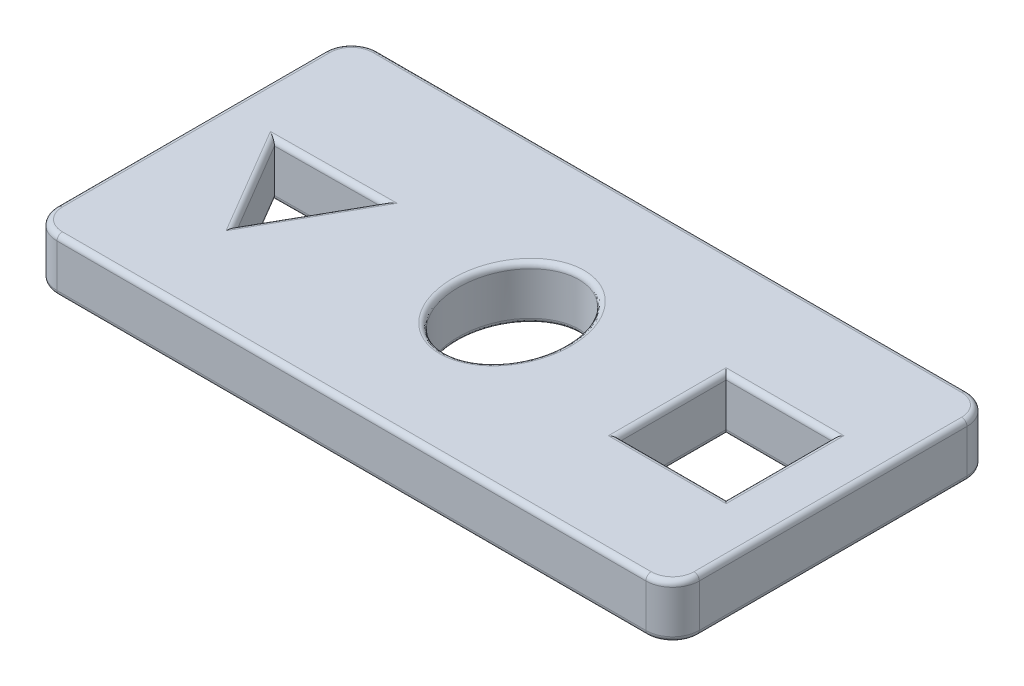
ISO-10303-21;
HEADER;
FILE_DESCRIPTION(('STEP AP214'),'2;1');
FILE_NAME('part.step','',(''),(''),'','','');
FILE_SCHEMA(('AUTOMOTIVE_DESIGN { 1 0 10303 214 1 1 1 1 }'));
ENDSEC;
DATA;
#1=APPLICATION_CONTEXT('core data for automotive mechanical design processes');
#2=APPLICATION_PROTOCOL_DEFINITION('international standard','automotive_design',2000,#1);
#3=PRODUCT_CONTEXT('',#1,'mechanical');
#4=PRODUCT('Part','Part','',(#3));
#5=PRODUCT_RELATED_PRODUCT_CATEGORY('part','',(#4));
#6=PRODUCT_DEFINITION_FORMATION('','',#4);
#7=PRODUCT_DEFINITION_CONTEXT('part definition',#1,'design');
#8=PRODUCT_DEFINITION('design','',#6,#7);
#9=PRODUCT_DEFINITION_SHAPE('','',#8);
#10=(LENGTH_UNIT() NAMED_UNIT(*) SI_UNIT(.MILLI.,.METRE.));
#11=(NAMED_UNIT(*) PLANE_ANGLE_UNIT() SI_UNIT($,.RADIAN.));
#12=(NAMED_UNIT(*) SI_UNIT($,.STERADIAN.) SOLID_ANGLE_UNIT());
#13=UNCERTAINTY_MEASURE_WITH_UNIT(LENGTH_MEASURE(1.E-05),#10,'distance_accuracy_value','');
#14=(GEOMETRIC_REPRESENTATION_CONTEXT(3) GLOBAL_UNCERTAINTY_ASSIGNED_CONTEXT((#13)) GLOBAL_UNIT_ASSIGNED_CONTEXT((#10,
#11,#12)) REPRESENTATION_CONTEXT('',''));
#15=CARTESIAN_POINT('',(0.,0.,0.));
#16=DIRECTION('',(0.,0.,1.));
#17=DIRECTION('',(1.,0.,0.));
#18=AXIS2_PLACEMENT_3D('',#15,#16,#17);
#19=CARTESIAN_POINT('',(60.,10.,-30.));
#20=DIRECTION('',(-1.,0.,0.));
#21=DIRECTION('',(0.,0.,1.));
#22=AXIS2_PLACEMENT_3D('',#19,#20,#21);
#23=PLANE('',#22);
#24=DIRECTION('',(0.,-1.,0.));
#25=VECTOR('',#24,1.);
#26=CARTESIAN_POINT('',(60.,10.,25.));
#27=LINE('',#26,#25);
#28=CARTESIAN_POINT('',(60.,9.,25.));
#29=VERTEX_POINT('',#28);
#30=CARTESIAN_POINT('',(60.,0.999999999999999,25.));
#31=VERTEX_POINT('',#30);
#32=EDGE_CURVE('E462',#29,#31,#27,.T.);
#33=ORIENTED_EDGE('',*,*,#32,.T.);
#34=DIRECTION('',(0.,0.,-1.));
#35=VECTOR('',#34,1.);
#36=CARTESIAN_POINT('',(60.,0.999999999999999,-30.));
#37=LINE('',#36,#35);
#38=CARTESIAN_POINT('',(60.,0.999999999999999,-25.));
#39=VERTEX_POINT('',#38);
#40=EDGE_CURVE('E481',#31,#39,#37,.T.);
#41=ORIENTED_EDGE('',*,*,#40,.T.);
#42=DIRECTION('',(0.,-1.,0.));
#43=VECTOR('',#42,1.);
#44=CARTESIAN_POINT('',(60.,10.,-25.));
#45=LINE('',#44,#43);
#46=CARTESIAN_POINT('',(60.,9.,-25.));
#47=VERTEX_POINT('',#46);
#48=EDGE_CURVE('E454',#39,#47,#45,.F.);
#49=ORIENTED_EDGE('',*,*,#48,.T.);
#50=DIRECTION('',(0.,0.,-1.));
#51=VECTOR('',#50,1.);
#52=CARTESIAN_POINT('',(60.,9.,25.));
#53=LINE('',#52,#51);
#54=EDGE_CURVE('E619',#47,#29,#53,.F.);
#55=ORIENTED_EDGE('',*,*,#54,.T.);
#56=EDGE_LOOP('',(#33,#41,#49,#55));
#57=FACE_BOUND('',#56,.T.);
#58=ADVANCED_FACE('F34',(#57),#23,.F.);
#59=CARTESIAN_POINT('',(-60.,10.,-30.));
#60=DIRECTION('',(0.,0.,1.));
#61=DIRECTION('',(1.,0.,0.));
#62=AXIS2_PLACEMENT_3D('',#59,#60,#61);
#63=PLANE('',#62);
#64=DIRECTION('',(0.,-1.,0.));
#65=VECTOR('',#64,1.);
#66=CARTESIAN_POINT('',(55.,10.,-30.));
#67=LINE('',#66,#65);
#68=CARTESIAN_POINT('',(55.,9.,-30.));
#69=VERTEX_POINT('',#68);
#70=CARTESIAN_POINT('',(55.,0.999999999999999,-30.));
#71=VERTEX_POINT('',#70);
#72=EDGE_CURVE('E252',#69,#71,#67,.T.);
#73=ORIENTED_EDGE('',*,*,#72,.T.);
#74=DIRECTION('',(-1.,0.,0.));
#75=VECTOR('',#74,1.);
#76=CARTESIAN_POINT('',(-60.,0.999999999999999,-30.));
#77=LINE('',#76,#75);
#78=CARTESIAN_POINT('',(-55.,0.999999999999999,-30.));
#79=VERTEX_POINT('',#78);
#80=EDGE_CURVE('E535',#71,#79,#77,.T.);
#81=ORIENTED_EDGE('',*,*,#80,.T.);
#82=DIRECTION('',(0.,-1.,0.));
#83=VECTOR('',#82,1.);
#84=CARTESIAN_POINT('',(-55.,10.,-30.));
#85=LINE('',#84,#83);
#86=CARTESIAN_POINT('',(-55.,9.,-30.));
#87=VERTEX_POINT('',#86);
#88=EDGE_CURVE('E532',#79,#87,#85,.F.);
#89=ORIENTED_EDGE('',*,*,#88,.T.);
#90=DIRECTION('',(-1.,0.,0.));
#91=VECTOR('',#90,1.);
#92=CARTESIAN_POINT('',(55.,9.,-30.));
#93=LINE('',#92,#91);
#94=EDGE_CURVE('E475',#87,#69,#93,.F.);
#95=ORIENTED_EDGE('',*,*,#94,.T.);
#96=EDGE_LOOP('',(#73,#81,#89,#95));
#97=FACE_BOUND('',#96,.T.);
#98=ADVANCED_FACE('F425',(#97),#63,.F.);
#99=CARTESIAN_POINT('',(-60.,10.,-30.));
#100=DIRECTION('',(1.,0.,0.));
#101=DIRECTION('',(0.,0.,-1.));
#102=AXIS2_PLACEMENT_3D('',#99,#100,#101);
#103=PLANE('',#102);
#104=DIRECTION('',(0.,-1.,0.));
#105=VECTOR('',#104,1.);
#106=CARTESIAN_POINT('',(-60.,10.,-25.));
#107=LINE('',#106,#105);
#108=CARTESIAN_POINT('',(-60.,9.,-25.));
#109=VERTEX_POINT('',#108);
#110=CARTESIAN_POINT('',(-60.,0.999999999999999,-25.));
#111=VERTEX_POINT('',#110);
#112=EDGE_CURVE('E526',#109,#111,#107,.T.);
#113=ORIENTED_EDGE('',*,*,#112,.T.);
#114=DIRECTION('',(0.,0.,1.));
#115=VECTOR('',#114,1.);
#116=CARTESIAN_POINT('',(-60.,0.999999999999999,-30.));
#117=LINE('',#116,#115);
#118=CARTESIAN_POINT('',(-60.,0.999999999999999,25.));
#119=VERTEX_POINT('',#118);
#120=EDGE_CURVE('E549',#111,#119,#117,.T.);
#121=ORIENTED_EDGE('',*,*,#120,.T.);
#122=DIRECTION('',(0.,-1.,0.));
#123=VECTOR('',#122,1.);
#124=CARTESIAN_POINT('',(-60.,10.,25.));
#125=LINE('',#124,#123);
#126=CARTESIAN_POINT('',(-60.,9.,25.));
#127=VERTEX_POINT('',#126);
#128=EDGE_CURVE('E463',#119,#127,#125,.F.);
#129=ORIENTED_EDGE('',*,*,#128,.T.);
#130=DIRECTION('',(0.,0.,1.));
#131=VECTOR('',#130,1.);
#132=CARTESIAN_POINT('',(-60.,9.,-25.));
#133=LINE('',#132,#131);
#134=EDGE_CURVE('E547',#127,#109,#133,.F.);
#135=ORIENTED_EDGE('',*,*,#134,.T.);
#136=EDGE_LOOP('',(#113,#121,#129,#135));
#137=FACE_BOUND('',#136,.T.);
#138=ADVANCED_FACE('F431',(#137),#103,.F.);
#139=CARTESIAN_POINT('',(-60.,10.,30.));
#140=DIRECTION('',(0.,0.,-1.));
#141=DIRECTION('',(-1.,0.,0.));
#142=AXIS2_PLACEMENT_3D('',#139,#140,#141);
#143=PLANE('',#142);
#144=DIRECTION('',(0.,-1.,0.));
#145=VECTOR('',#144,1.);
#146=CARTESIAN_POINT('',(-55.,10.,30.));
#147=LINE('',#146,#145);
#148=CARTESIAN_POINT('',(-55.,9.,30.));
#149=VERTEX_POINT('',#148);
#150=CARTESIAN_POINT('',(-55.,0.999999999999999,30.));
#151=VERTEX_POINT('',#150);
#152=EDGE_CURVE('E522',#149,#151,#147,.T.);
#153=ORIENTED_EDGE('',*,*,#152,.T.);
#154=DIRECTION('',(1.,0.,0.));
#155=VECTOR('',#154,1.);
#156=CARTESIAN_POINT('',(-60.,0.999999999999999,30.));
#157=LINE('',#156,#155);
#158=CARTESIAN_POINT('',(55.,0.999999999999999,30.));
#159=VERTEX_POINT('',#158);
#160=EDGE_CURVE('E557',#151,#159,#157,.T.);
#161=ORIENTED_EDGE('',*,*,#160,.T.);
#162=DIRECTION('',(0.,-1.,0.));
#163=VECTOR('',#162,1.);
#164=CARTESIAN_POINT('',(55.,10.,30.));
#165=LINE('',#164,#163);
#166=CARTESIAN_POINT('',(55.,9.,30.));
#167=VERTEX_POINT('',#166);
#168=EDGE_CURVE('E519',#159,#167,#165,.F.);
#169=ORIENTED_EDGE('',*,*,#168,.T.);
#170=DIRECTION('',(1.,0.,0.));
#171=VECTOR('',#170,1.);
#172=CARTESIAN_POINT('',(-55.,9.,30.));
#173=LINE('',#172,#171);
#174=EDGE_CURVE('E555',#167,#149,#173,.F.);
#175=ORIENTED_EDGE('',*,*,#174,.T.);
#176=EDGE_LOOP('',(#153,#161,#169,#175));
#177=FACE_BOUND('',#176,.T.);
#178=ADVANCED_FACE('F775',(#177),#143,.F.);
#179=CARTESIAN_POINT('',(0.,10.,0.));
#180=DIRECTION('',(0.,1.,0.));
#181=DIRECTION('',(0.,0.,1.));
#182=AXIS2_PLACEMENT_3D('',#179,#180,#181);
#183=PLANE('',#182);
#184=DIRECTION('',(-1.,0.,0.));
#185=VECTOR('',#184,1.);
#186=CARTESIAN_POINT('',(-55.,10.,-29.));
#187=LINE('',#186,#185);
#188=CARTESIAN_POINT('',(55.,10.,-29.));
#189=VERTEX_POINT('',#188);
#190=CARTESIAN_POINT('',(-55.,10.,-29.));
#191=VERTEX_POINT('',#190);
#192=EDGE_CURVE('E43',#189,#191,#187,.T.);
#193=ORIENTED_EDGE('',*,*,#192,.T.);
#194=CARTESIAN_POINT('',(-55.,10.,-25.));
#195=DIRECTION('',(0.,1.,0.));
#196=DIRECTION('',(0.,0.,1.));
#197=AXIS2_PLACEMENT_3D('',#194,#195,#196);
#198=CIRCLE('',#197,4.);
#199=CARTESIAN_POINT('',(-59.,10.,-25.));
#200=VERTEX_POINT('',#199);
#201=EDGE_CURVE('E11',#191,#200,#198,.T.);
#202=ORIENTED_EDGE('',*,*,#201,.T.);
#203=DIRECTION('',(0.,0.,1.));
#204=VECTOR('',#203,1.);
#205=CARTESIAN_POINT('',(-59.,10.,25.));
#206=LINE('',#205,#204);
#207=CARTESIAN_POINT('',(-59.,10.,25.));
#208=VERTEX_POINT('',#207);
#209=EDGE_CURVE('E586',#200,#208,#206,.T.);
#210=ORIENTED_EDGE('',*,*,#209,.T.);
#211=CARTESIAN_POINT('',(-55.,10.,25.));
#212=DIRECTION('',(0.,1.,0.));
#213=DIRECTION('',(0.,0.,1.));
#214=AXIS2_PLACEMENT_3D('',#211,#212,#213);
#215=CIRCLE('',#214,4.);
#216=CARTESIAN_POINT('',(-55.,10.,29.));
#217=VERTEX_POINT('',#216);
#218=EDGE_CURVE('E590',#208,#217,#215,.T.);
#219=ORIENTED_EDGE('',*,*,#218,.T.);
#220=DIRECTION('',(1.,0.,0.));
#221=VECTOR('',#220,1.);
#222=CARTESIAN_POINT('',(55.,10.,29.));
#223=LINE('',#222,#221);
#224=CARTESIAN_POINT('',(55.,10.,29.));
#225=VERTEX_POINT('',#224);
#226=EDGE_CURVE('E592',#217,#225,#223,.T.);
#227=ORIENTED_EDGE('',*,*,#226,.T.);
#228=CARTESIAN_POINT('',(55.,10.,25.));
#229=DIRECTION('',(0.,1.,0.));
#230=DIRECTION('',(0.,0.,1.));
#231=AXIS2_PLACEMENT_3D('',#228,#229,#230);
#232=CIRCLE('',#231,4.);
#233=CARTESIAN_POINT('',(59.,10.,25.));
#234=VERTEX_POINT('',#233);
#235=EDGE_CURVE('E594',#225,#234,#232,.T.);
#236=ORIENTED_EDGE('',*,*,#235,.T.);
#237=DIRECTION('',(0.,0.,-1.));
#238=VECTOR('',#237,1.);
#239=CARTESIAN_POINT('',(59.,10.,-25.));
#240=LINE('',#239,#238);
#241=CARTESIAN_POINT('',(59.,10.,-25.));
#242=VERTEX_POINT('',#241);
#243=EDGE_CURVE('E596',#234,#242,#240,.T.);
#244=ORIENTED_EDGE('',*,*,#243,.T.);
#245=CARTESIAN_POINT('',(55.,10.,-25.));
#246=DIRECTION('',(0.,1.,0.));
#247=DIRECTION('',(0.,0.,1.));
#248=AXIS2_PLACEMENT_3D('',#245,#246,#247);
#249=CIRCLE('',#248,4.);
#250=EDGE_CURVE('E54',#242,#189,#249,.T.);
#251=ORIENTED_EDGE('',*,*,#250,.T.);
#252=EDGE_LOOP('',(#193,#202,#210,#219,#227,#236,#244,#251));
#253=FACE_BOUND('',#252,.T.);
#254=CARTESIAN_POINT('',(1.07646400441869,9.,12.4273655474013));
#255=CARTESIAN_POINT('',(1.07646400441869,10.,12.4273655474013));
#256=CARTESIAN_POINT('',(1.21058557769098,10.,13.4183304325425));
#257=CARTESIAN_POINT('',(0.839476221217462,9.,12.4594421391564));
#258=CARTESIAN_POINT('',(0.839476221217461,10.,12.4594421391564));
#259=CARTESIAN_POINT('',(0.944261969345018,10.,13.4543778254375));
#260=CARTESIAN_POINT('',(0.601246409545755,9.,12.4809573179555));
#261=CARTESIAN_POINT('',(0.601246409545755,10.,12.4809573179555));
#262=CARTESIAN_POINT('',(0.676352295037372,10.,13.4785791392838));
#263=CARTESIAN_POINT('',(0.123939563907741,9.,12.5026030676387));
#264=CARTESIAN_POINT('',(0.123939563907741,10.,12.5026030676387));
#265=CARTESIAN_POINT('',(0.139448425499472,10.,13.502927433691));
#266=CARTESIAN_POINT('',(-0.11513740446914,9.,12.5027352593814));
#267=CARTESIAN_POINT('',(-0.11513740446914,10.,12.5027352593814));
#268=CARTESIAN_POINT('',(-0.129545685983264,10.,13.5030762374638));
#269=CARTESIAN_POINT('',(-0.592383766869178,9.,12.4816165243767));
#270=CARTESIAN_POINT('',(-0.592383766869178,10.,12.4816165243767));
#271=CARTESIAN_POINT('',(-0.666384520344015,10.,13.479320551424));
#272=CARTESIAN_POINT('',(-0.830553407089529,9.,12.4603718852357));
#273=CARTESIAN_POINT('',(-0.830553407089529,10.,12.4603718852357));
#274=CARTESIAN_POINT('',(-0.934229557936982,10.,13.4554231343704));
#275=CARTESIAN_POINT('',(-1.30439365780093,9.,12.3967825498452));
#276=CARTESIAN_POINT('',(-1.30439365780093,10.,12.3967825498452));
#277=CARTESIAN_POINT('',(-1.4667347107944,10.,13.3839610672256));
#278=CARTESIAN_POINT('',(-1.54006428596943,9.,12.3544380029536));
#279=CARTESIAN_POINT('',(-1.54006428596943,10.,12.3544380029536));
#280=CARTESIAN_POINT('',(-1.73139484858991,10.,13.3363965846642));
#281=CARTESIAN_POINT('',(-1.99457384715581,9.,12.252043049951));
#282=CARTESIAN_POINT('',(-1.99457384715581,10.,12.252043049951));
#283=CARTESIAN_POINT('',(-2.24124228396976,10.,13.2215350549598));
#284=CARTESIAN_POINT('',(-2.21362994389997,9.,12.1930837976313));
#285=CARTESIAN_POINT('',(-2.21362994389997,10.,12.1930837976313));
#286=CARTESIAN_POINT('',(-2.48670457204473,10.,13.1554551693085));
#287=CARTESIAN_POINT('',(-2.64686000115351,9.,12.0574199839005));
#288=CARTESIAN_POINT('',(-2.64686000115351,10.,12.0574199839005));
#289=CARTESIAN_POINT('',(-2.971499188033,10.,13.0036444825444));
#290=CARTESIAN_POINT('',(-2.86103238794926,9.,11.9807097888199));
#291=CARTESIAN_POINT('',(-2.86103238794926,10.,11.9807097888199));
#292=CARTESIAN_POINT('',(-3.21082954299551,10.,12.9179074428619));
#293=CARTESIAN_POINT('',(-3.49432278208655,9.,11.7251106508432));
#294=CARTESIAN_POINT('',(-3.49432278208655,10.,11.7251106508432));
#295=CARTESIAN_POINT('',(-3.91736271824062,10.,12.6327456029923));
#296=CARTESIAN_POINT('',(-3.90458521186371,9.,11.5206680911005));
#297=CARTESIAN_POINT('',(-3.90458521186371,10.,11.5206680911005));
#298=CARTESIAN_POINT('',(-4.37352434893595,10.,12.4052741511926));
#299=CARTESIAN_POINT('',(-4.71855065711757,9.,11.0362865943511));
#300=CARTESIAN_POINT('',(-4.71855065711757,10.,11.0362865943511));
#301=CARTESIAN_POINT('',(-5.27521592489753,10.,11.8686975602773));
#302=CARTESIAN_POINT('',(-5.12009476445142,9.,10.7523048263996));
#303=CARTESIAN_POINT('',(-5.12009476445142,10.,10.7523048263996));
#304=CARTESIAN_POINT('',(-5.71812847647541,10.,11.5552480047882));
#305=CARTESIAN_POINT('',(-5.88054426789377,9.,10.1262854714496));
#306=CARTESIAN_POINT('',(-5.88054426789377,10.,10.1262854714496));
#307=CARTESIAN_POINT('',(-6.55367674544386,10.,10.8674072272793));
#308=CARTESIAN_POINT('',(-6.23942988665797,9.,9.78422113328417));
#309=CARTESIAN_POINT('',(-6.23942988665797,10.,9.78422113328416));
#310=CARTESIAN_POINT('',(-6.94628914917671,10.,10.492987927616));
#311=CARTESIAN_POINT('',(-6.96023196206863,9.,8.99797140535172));
#312=CARTESIAN_POINT('',(-6.96023196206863,10.,8.99797140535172));
#313=CARTESIAN_POINT('',(-7.73209806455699,10.,9.63583623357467));
#314=CARTESIAN_POINT('',(-7.31469271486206,9.,8.54616437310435));
#315=CARTESIAN_POINT('',(-7.31469271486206,10.,8.54616437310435));
#316=CARTESIAN_POINT('',(-8.11673279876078,10.,9.14527589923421));
#317=CARTESIAN_POINT('',(-7.95877856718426,9.,7.59390007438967));
#318=CARTESIAN_POINT('',(-7.95877856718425,10.,7.59390007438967));
#319=CARTESIAN_POINT('',(-8.81342676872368,10.,8.11522771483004));
#320=CARTESIAN_POINT('',(-8.24836434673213,9.,7.09341356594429));
#321=CARTESIAN_POINT('',(-8.24836434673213,10.,7.09341356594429));
#322=CARTESIAN_POINT('',(-9.12544199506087,10.,7.57571046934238));
#323=CARTESIAN_POINT('',(-8.80945799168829,9.,5.9593015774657));
#324=CARTESIAN_POINT('',(-8.80945799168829,10.,5.9593015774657));
#325=CARTESIAN_POINT('',(-9.72857001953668,10.,6.35664628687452));
#326=CARTESIAN_POINT('',(-9.06747458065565,9.,5.31827386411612));
#327=CARTESIAN_POINT('',(-9.06747458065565,10.,5.31827386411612));
#328=CARTESIAN_POINT('',(-10.004880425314,10.,5.66977245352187));
#329=CARTESIAN_POINT('',(-9.49028690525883,9.,4.00319741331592));
#330=CARTESIAN_POINT('',(-9.49028690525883,10.,4.00319741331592));
#331=CARTESIAN_POINT('',(-10.4569158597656,10.,4.26378662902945));
#332=CARTESIAN_POINT('',(-9.65502744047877,9.,3.32912937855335));
#333=CARTESIAN_POINT('',(-9.65502744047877,10.,3.32912937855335));
#334=CARTESIAN_POINT('',(-10.6325813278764,10.,3.544655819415));
#335=CARTESIAN_POINT('',(-9.91151618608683,9.,1.84880848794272));
#336=CARTESIAN_POINT('',(-9.91151618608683,10.,1.84880848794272));
#337=CARTESIAN_POINT('',(-10.9058956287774,10.,1.96725500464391));
#338=CARTESIAN_POINT('',(-9.9864399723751,9.,1.03930913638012));
#339=CARTESIAN_POINT('',(-9.9864399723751,10.,1.03930913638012));
#340=CARTESIAN_POINT('',(-10.9855735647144,10.,1.10583642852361));
#341=CARTESIAN_POINT('',(-10.0102179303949,9.,-0.582291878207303));
#342=CARTESIAN_POINT('',(-10.0102179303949,10.,-0.582291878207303));
#343=CARTESIAN_POINT('',(-11.0108704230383,10.,-0.619568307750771));
#344=CARTESIAN_POINT('',(-9.95895265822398,9.,-1.39439527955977));
#345=CARTESIAN_POINT('',(-9.95895265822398,10.,-1.39439527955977));
#346=CARTESIAN_POINT('',(-10.9563623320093,10.,-1.48355612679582));
#347=CARTESIAN_POINT('',(-9.72077338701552,9.,-3.06216834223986));
#348=CARTESIAN_POINT('',(-9.72077338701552,10.,-3.06216834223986));
#349=CARTESIAN_POINT('',(-10.7026885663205,10.,-3.25987221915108));
#350=CARTESIAN_POINT('',(-9.52351474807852,9.,-3.91624558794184));
#351=CARTESIAN_POINT('',(-9.52351474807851,10.,-3.91624558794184));
#352=CARTESIAN_POINT('',(-10.4924902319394,10.,-4.17066280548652));
#353=CARTESIAN_POINT('',(-8.98051943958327,9.,-5.57064678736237));
#354=CARTESIAN_POINT('',(-8.98051943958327,10.,-5.57064678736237));
#355=CARTESIAN_POINT('',(-9.91185965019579,10.,-5.93976806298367));
#356=CARTESIAN_POINT('',(-8.63495419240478,9.,-6.37103157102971));
#357=CARTESIAN_POINT('',(-8.63495419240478,10.,-6.37103157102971));
#358=CARTESIAN_POINT('',(-9.54161239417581,10.,-6.79814201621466));
#359=CARTESIAN_POINT('',(-7.90378275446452,9.,-7.6882851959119));
#360=CARTESIAN_POINT('',(-7.90378275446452,10.,-7.6882851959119));
#361=CARTESIAN_POINT('',(-8.75402903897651,10.,-8.21699064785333));
#362=CARTESIAN_POINT('',(-7.55090265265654,9.,-8.22537945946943));
#363=CARTESIAN_POINT('',(-7.55090265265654,10.,-8.22537945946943));
#364=CARTESIAN_POINT('',(-8.37282530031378,10.,-8.79758457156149));
#365=CARTESIAN_POINT('',(-6.76627228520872,9.,-9.23074874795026));
#366=CARTESIAN_POINT('',(-6.76627228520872,10.,-9.23074874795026));
#367=CARTESIAN_POINT('',(-7.52111252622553,10.,-9.88891707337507));
#368=CARTESIAN_POINT('',(-6.33463305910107,9.,-9.69911900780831));
#369=CARTESIAN_POINT('',(-6.33463305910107,10.,-9.69911900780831));
#370=CARTESIAN_POINT('',(-7.05072918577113,10.,-10.3997522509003));
#371=CARTESIAN_POINT('',(-5.473866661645,9.,-10.4785316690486));
#372=CARTESIAN_POINT('',(-5.473866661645,10.,-10.4785316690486));
#373=CARTESIAN_POINT('',(-6.10743897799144,10.,-11.2538711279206));
#374=CARTESIAN_POINT('',(-5.05547616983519,9.,-10.8027609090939));
#375=CARTESIAN_POINT('',(-5.05547616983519,10.,-10.8027609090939));
#376=CARTESIAN_POINT('',(-5.64707772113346,10.,-11.6108881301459));
#377=CARTESIAN_POINT('',(-4.39534101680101,9.,-11.2321218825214));
#378=CARTESIAN_POINT('',(-4.39534101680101,10.,-11.2321218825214));
#379=CARTESIAN_POINT('',(-4.91731688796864,10.,-12.0855324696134));
#380=CARTESIAN_POINT('',(-4.16978175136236,9.,-11.3657838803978));
#381=CARTESIAN_POINT('',(-4.16978175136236,10.,-11.3657838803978));
#382=CARTESIAN_POINT('',(-4.66742725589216,10.,-12.2336438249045));
#383=CARTESIAN_POINT('',(-3.70891067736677,9.,-11.6126776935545));
#384=CARTESIAN_POINT('',(-3.70891067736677,10.,-11.6126776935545));
#385=CARTESIAN_POINT('',(-4.15574179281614,10.,-12.5077595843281));
#386=CARTESIAN_POINT('',(-3.47360006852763,9.,-11.7259120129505));
#387=CARTESIAN_POINT('',(-3.47360006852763,10.,-11.7259120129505));
#388=CARTESIAN_POINT('',(-3.8939474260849,10.,-12.6337666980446));
#389=CARTESIAN_POINT('',(-3.01964224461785,9.,-11.9198622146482));
#390=CARTESIAN_POINT('',(-3.01964224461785,10.,-11.9198622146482));
#391=CARTESIAN_POINT('',(-3.38790901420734,10.,-12.8499676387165));
#392=CARTESIAN_POINT('',(-2.8018069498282,9.,-12.002735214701));
#393=CARTESIAN_POINT('',(-2.8018069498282,10.,-12.002735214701));
#394=CARTESIAN_POINT('',(-3.1446710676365,10.,-12.9425230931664));
#395=CARTESIAN_POINT('',(-2.36071069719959,9.,-12.1500470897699));
#396=CARTESIAN_POINT('',(-2.36071069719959,10.,-12.1500470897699));
#397=CARTESIAN_POINT('',(-2.6513981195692,10.,-13.1072601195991));
#398=CARTESIAN_POINT('',(-2.1374504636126,9.,-12.2144884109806));
#399=CARTESIAN_POINT('',(-2.1374504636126,10.,-12.2144884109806));
#400=CARTESIAN_POINT('',(-2.40136402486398,10.,-13.1794443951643));
#401=CARTESIAN_POINT('',(-1.68733928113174,9.,-12.3240967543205));
#402=CARTESIAN_POINT('',(-1.68733928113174,10.,-12.3240967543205));
#403=CARTESIAN_POINT('',(-1.89668130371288,10.,-13.3023415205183));
#404=CARTESIAN_POINT('',(-1.46049770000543,9.,-12.3693074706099));
#405=CARTESIAN_POINT('',(-1.46049770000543,10.,-12.3693074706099));
#406=CARTESIAN_POINT('',(-1.64204452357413,10.,-13.3531030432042));
#407=CARTESIAN_POINT('',(-1.00422857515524,9.,-12.4401263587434));
#408=CARTESIAN_POINT('',(-1.00422857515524,10.,-12.4401263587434));
#409=CARTESIAN_POINT('',(-1.12946493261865,10.,-13.4326617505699));
#410=CARTESIAN_POINT('',(-0.774802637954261,9.,-12.4657460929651));
#411=CARTESIAN_POINT('',(-0.774802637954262,10.,-12.4657460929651));
#412=CARTESIAN_POINT('',(-0.871524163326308,10.,-13.4614718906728));
#413=CARTESIAN_POINT('',(-0.454164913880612,9.,-12.4876184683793));
#414=CARTESIAN_POINT('',(-0.454164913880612,10.,-12.4876184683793));
#415=CARTESIAN_POINT('',(-0.510907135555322,10.,-13.4860718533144));
#416=CARTESIAN_POINT('',(-0.363397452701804,9.,-12.4922596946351));
#417=CARTESIAN_POINT('',(-0.363397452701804,10.,-12.4922596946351));
#418=CARTESIAN_POINT('',(-0.408807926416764,10.,-13.4912925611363));
#419=CARTESIAN_POINT('',(-0.181758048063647,9.,-12.4984512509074));
#420=CARTESIAN_POINT('',(-0.181758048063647,10.,-12.4984512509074));
#421=CARTESIAN_POINT('',(-0.204477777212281,10.,-13.4982576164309));
#422=CARTESIAN_POINT('',(-0.0908860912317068,9.,-12.5000011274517));
#423=CARTESIAN_POINT('',(-0.0908860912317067,10.,-12.5000011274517));
#424=CARTESIAN_POINT('',(-0.10224682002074,10.,-13.5000014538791));
#425=CARTESIAN_POINT('',(0.265494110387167,9.,-12.4999967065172));
#426=CARTESIAN_POINT('',(0.265494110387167,10.,-12.4999967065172));
#427=CARTESIAN_POINT('',(0.298680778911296,10.,-13.4999957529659));
#428=CARTESIAN_POINT('',(0.531108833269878,9.,-12.4867582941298));
#429=CARTESIAN_POINT('',(0.531108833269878,10.,-12.4867582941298));
#430=CARTESIAN_POINT('',(0.597496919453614,10.,-13.4850984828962));
#431=CARTESIAN_POINT('',(1.06018545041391,9.,-12.4339842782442));
#432=CARTESIAN_POINT('',(1.06018545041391,10.,-12.4339842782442));
#433=CARTESIAN_POINT('',(1.19235593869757,10.,-13.4257633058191));
#434=CARTESIAN_POINT('',(1.32364532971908,9.,-12.3944264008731));
#435=CARTESIAN_POINT('',(1.32364532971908,10.,-12.3944264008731));
#436=CARTESIAN_POINT('',(1.48839625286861,10.,-13.38130037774));
#437=CARTESIAN_POINT('',(1.84663236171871,9.,-12.289492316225));
#438=CARTESIAN_POINT('',(1.84663236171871,10.,-12.289492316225));
#439=CARTESIAN_POINT('',(2.07539500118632,10.,-13.2635229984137));
#440=CARTESIAN_POINT('',(2.1061489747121,9.,-12.2240564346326));
#441=CARTESIAN_POINT('',(2.1061489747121,10.,-12.2240564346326));
#442=CARTESIAN_POINT('',(2.36634005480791,10.,-13.1901418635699));
#443=CARTESIAN_POINT('',(2.61862198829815,9.,-12.068320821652));
#444=CARTESIAN_POINT('',(2.61862198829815,10.,-12.068320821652));
#445=CARTESIAN_POINT('',(2.93996987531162,10.,-13.0158216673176));
#446=CARTESIAN_POINT('',(2.87157549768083,9.,-11.9780103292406));
#447=CARTESIAN_POINT('',(2.87157549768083,10.,-11.9780103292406));
#448=CARTESIAN_POINT('',(3.22265100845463,10.,-12.9148706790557));
#449=CARTESIAN_POINT('',(3.33447431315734,9.,-11.7879795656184));
#450=CARTESIAN_POINT('',(3.33447431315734,10.,-11.7879795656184));
#451=CARTESIAN_POINT('',(3.73896514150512,10.,-12.7029123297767));
#452=CARTESIAN_POINT('',(3.54552686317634,9.,-11.6912913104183));
#453=CARTESIAN_POINT('',(3.54552686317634,10.,-11.6912913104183));
#454=CARTESIAN_POINT('',(3.97397190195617,10.,-12.5952302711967));
#455=CARTESIAN_POINT('',(3.9602581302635,9.,-11.4814024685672));
#456=CARTESIAN_POINT('',(3.9602581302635,10.,-11.4814024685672));
#457=CARTESIAN_POINT('',(4.4349433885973,10.,-12.3619398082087));
#458=CARTESIAN_POINT('',(4.16393466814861,9.,-11.3681970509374));
#459=CARTESIAN_POINT('',(4.1639346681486,10.,-11.3681970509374));
#460=CARTESIAN_POINT('',(4.66090544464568,10.,-12.2363261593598));
#461=CARTESIAN_POINT('',(4.76194458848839,9.,-11.0056599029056));
#462=CARTESIAN_POINT('',(4.76194458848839,10.,-11.0056599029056));
#463=CARTESIAN_POINT('',(5.32308083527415,10.,-11.8348905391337));
#464=CARTESIAN_POINT('',(5.14400720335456,9.,-10.7330955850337));
#465=CARTESIAN_POINT('',(5.14400720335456,10.,-10.7330955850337));
#466=CARTESIAN_POINT('',(5.74441865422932,10.,-11.5341251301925));
#467=CARTESIAN_POINT('',(5.91206911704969,9.,-10.0997917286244));
#468=CARTESIAN_POINT('',(5.91206911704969,10.,-10.0997917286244));
#469=CARTESIAN_POINT('',(6.58829627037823,10.,-10.8383160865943));
#470=CARTESIAN_POINT('',(6.29315914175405,9.,-9.7324279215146));
#471=CARTESIAN_POINT('',(6.29315914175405,10.,-9.7324279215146));
#472=CARTESIAN_POINT('',(7.00504972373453,10.,-10.436321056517));
#473=CARTESIAN_POINT('',(7.00201061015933,9.,-8.94403042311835));
#474=CARTESIAN_POINT('',(7.00201061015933,10.,-8.94403042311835));
#475=CARTESIAN_POINT('',(7.77741563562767,10.,-9.57728042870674));
#476=CARTESIAN_POINT('',(7.32972967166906,9.,-8.52295454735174));
#477=CARTESIAN_POINT('',(7.32972967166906,10.,-8.52295454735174));
#478=CARTESIAN_POINT('',(8.13297951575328,10.,-9.12019157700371));
#479=CARTESIAN_POINT('',(7.98133674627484,9.,-7.56167199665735));
#480=CARTESIAN_POINT('',(7.98133674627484,10.,-7.56167199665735));
#481=CARTESIAN_POINT('',(8.83784872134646,10.,-8.08034256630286));
#482=CARTESIAN_POINT('',(8.29463153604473,9.,-7.0134861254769));
#483=CARTESIAN_POINT('',(8.29463153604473,10.,-7.0134861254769));
#484=CARTESIAN_POINT('',(9.17529493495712,10.,-7.48955572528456));
#485=CARTESIAN_POINT('',(8.84255127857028,9.,-5.87527870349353));
#486=CARTESIAN_POINT('',(8.84255127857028,10.,-5.87527870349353));
#487=CARTESIAN_POINT('',(9.76399095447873,10.,-6.26663316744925));
#488=CARTESIAN_POINT('',(9.07712903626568,9.,-5.28523231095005));
#489=CARTESIAN_POINT('',(9.07712903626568,10.,-5.28523231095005));
#490=CARTESIAN_POINT('',(10.0151890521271,10.,-5.63447291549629));
#491=CARTESIAN_POINT('',(9.50365949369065,9.,-3.96506878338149));
#492=CARTESIAN_POINT('',(9.50365949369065,10.,-3.96506878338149));
#493=CARTESIAN_POINT('',(10.4712277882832,10.,-4.22299210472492));
#494=CARTESIAN_POINT('',(9.67967627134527,9.,-3.22924612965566));
#495=CARTESIAN_POINT('',(9.67967627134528,10.,-3.22924612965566));
#496=CARTESIAN_POINT('',(10.6588715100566,10.,-3.43809724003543));
#497=CARTESIAN_POINT('',(9.92159735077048,9.,-1.73784444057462));
#498=CARTESIAN_POINT('',(9.92159735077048,10.,-1.73784444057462));
#499=CARTESIAN_POINT('',(10.9166074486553,10.,-1.84917029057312));
#500=CARTESIAN_POINT('',(9.98743580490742,9.,-0.982253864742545));
#501=CARTESIAN_POINT('',(9.98743580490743,10.,-0.982253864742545));
#502=CARTESIAN_POINT('',(10.9866293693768,10.,-1.04512705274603));
#503=CARTESIAN_POINT('',(10.0107242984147,9.,0.629146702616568));
#504=CARTESIAN_POINT('',(10.0107242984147,10.,0.629146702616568));
#505=CARTESIAN_POINT('',(11.0114132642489,10.,0.669420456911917));
#506=CARTESIAN_POINT('',(9.95298507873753,9.,1.48522639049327));
#507=CARTESIAN_POINT('',(9.95298507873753,10.,1.48522639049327));
#508=CARTESIAN_POINT('',(10.9500228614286,10.,1.58018768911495));
#509=CARTESIAN_POINT('',(9.69640467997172,9.,3.17535990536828));
#510=CARTESIAN_POINT('',(9.69640467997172,10.,3.17535990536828));
#511=CARTESIAN_POINT('',(10.6767144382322,10.,3.38055974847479));
#512=CARTESIAN_POINT('',(9.49743129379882,9.,4.00939233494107));
#513=CARTESIAN_POINT('',(9.49743129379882,10.,4.00939233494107));
#514=CARTESIAN_POINT('',(10.4646553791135,10.,4.27014393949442));
#515=CARTESIAN_POINT('',(9.09172944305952,9.,5.22394616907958));
#516=CARTESIAN_POINT('',(9.09172944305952,10.,5.22394616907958));
#517=CARTESIAN_POINT('',(10.0307456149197,10.,5.56910052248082));
#518=CARTESIAN_POINT('',(8.9376653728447,9.,5.62446547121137));
#519=CARTESIAN_POINT('',(8.9376653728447,10.,5.62446547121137));
#520=CARTESIAN_POINT('',(9.86577900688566,10.,5.99806614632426));
#521=CARTESIAN_POINT('',(8.5933864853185,9.,6.40818676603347));
#522=CARTESIAN_POINT('',(8.5933864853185,10.,6.40818676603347));
#523=CARTESIAN_POINT('',(9.49639409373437,10.,6.83894608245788));
#524=CARTESIAN_POINT('',(8.40316632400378,9.,6.79138618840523));
#525=CARTESIAN_POINT('',(8.40316632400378,10.,6.79138618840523));
#526=CARTESIAN_POINT('',(9.29196995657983,10.,7.25085786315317));
#527=CARTESIAN_POINT('',(7.98729665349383,9.,7.53476580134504));
#528=CARTESIAN_POINT('',(7.98729665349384,10.,7.53476580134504));
#529=CARTESIAN_POINT('',(8.84395531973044,10.,8.05169638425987));
#530=CARTESIAN_POINT('',(7.76172290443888,9.,7.89499294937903));
#531=CARTESIAN_POINT('',(7.76172290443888,10.,7.89499294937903));
#532=CARTESIAN_POINT('',(8.60044854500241,10.,8.44066988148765));
#533=CARTESIAN_POINT('',(7.27552281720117,9.,8.58801161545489));
#534=CARTESIAN_POINT('',(7.27552281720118,10.,8.58801161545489));
#535=CARTESIAN_POINT('',(8.07408104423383,10.,9.19094320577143));
#536=CARTESIAN_POINT('',(7.01491581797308,9.,8.92081810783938));
#537=CARTESIAN_POINT('',(7.01491581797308,10.,8.92081810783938));
#538=CARTESIAN_POINT('',(7.79124202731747,10.,9.55225812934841));
#539=CARTESIAN_POINT('',(6.55241111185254,9.,9.44793988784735));
#540=CARTESIAN_POINT('',(6.55241111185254,10.,9.44793988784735));
#541=CARTESIAN_POINT('',(7.28763294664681,10.,10.1262243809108));
#542=CARTESIAN_POINT('',(6.35985582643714,9.,9.65147239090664));
#543=CARTESIAN_POINT('',(6.35985582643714,10.,9.65147239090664));
#544=CARTESIAN_POINT('',(7.07755124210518,10.,10.3483195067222));
#545=CARTESIAN_POINT('',(5.96033107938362,9.,10.0419987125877));
#546=CARTESIAN_POINT('',(5.96033107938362,10.,10.0419987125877));
#547=CARTESIAN_POINT('',(6.64066499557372,10.,10.7753662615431));
#548=CARTESIAN_POINT('',(5.75336550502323,9.,10.2289969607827));
#549=CARTESIAN_POINT('',(5.75336550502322,10.,10.2289969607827));
#550=CARTESIAN_POINT('',(6.41386496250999,10.,10.9803224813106));
#551=CARTESIAN_POINT('',(5.32581441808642,9.,10.5846018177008));
#552=CARTESIAN_POINT('',(5.32581441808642,10.,10.5846018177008));
#553=CARTESIAN_POINT('',(5.94422490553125,10.,11.3709333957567));
#554=CARTESIAN_POINT('',(5.10523048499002,9.,10.7532105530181));
#555=CARTESIAN_POINT('',(5.10523048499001,10.,10.7532105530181));
#556=CARTESIAN_POINT('',(5.70138674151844,10.,11.5565903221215));
#557=CARTESIAN_POINT('',(4.65157232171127,9.,11.0701140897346));
#558=CARTESIAN_POINT('',(4.65157232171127,10.,11.0701140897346));
#559=CARTESIAN_POINT('',(5.20076085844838,10.,11.9063029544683));
#560=CARTESIAN_POINT('',(4.4185042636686,9.,11.2184188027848));
#561=CARTESIAN_POINT('',(4.4185042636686,10.,11.2184188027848));
#562=CARTESIAN_POINT('',(4.94298052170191,10.,12.0703691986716));
#563=CARTESIAN_POINT('',(3.93914398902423,9.,11.494109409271));
#564=CARTESIAN_POINT('',(3.93914398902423,10.,11.494109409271));
#565=CARTESIAN_POINT('',(4.41155960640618,10.,12.3760005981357));
#566=CARTESIAN_POINT('',(3.69275929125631,9.,11.6213145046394));
#567=CARTESIAN_POINT('',(3.6927592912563,10.,11.6213145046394));
#568=CARTESIAN_POINT('',(4.1378066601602,10.,12.5173709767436));
#569=CARTESIAN_POINT('',(3.1902994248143,9.,11.8515256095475));
#570=CARTESIAN_POINT('',(3.1902994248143,10.,11.8515256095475));
#571=CARTESIAN_POINT('',(3.57833065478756,10.,12.7737045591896));
#572=CARTESIAN_POINT('',(2.93422907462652,9.,11.9545434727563));
#573=CARTESIAN_POINT('',(2.93422907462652,10.,11.9545434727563));
#574=CARTESIAN_POINT('',(3.29261354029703,10.,12.8886806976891));
#575=CARTESIAN_POINT('',(2.4143083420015,9.,12.1349105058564));
#576=CARTESIAN_POINT('',(2.4143083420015,10.,12.1349105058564));
#577=CARTESIAN_POINT('',(2.71143596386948,10.,13.0902980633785));
#578=CARTESIAN_POINT('',(2.15046070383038,9.,12.2122686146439));
#579=CARTESIAN_POINT('',(2.15046070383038,10.,12.2122686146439));
#580=CARTESIAN_POINT('',(2.41597893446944,10.,13.1769491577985));
#581=CARTESIAN_POINT('',(1.61710472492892,9.,12.3401450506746));
#582=CARTESIAN_POINT('',(1.61710472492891,10.,12.3401450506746));
#583=CARTESIAN_POINT('',(1.81790110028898,10.,13.3203425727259));
#584=CARTESIAN_POINT('',(1.34759722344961,9.,12.3906673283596));
#585=CARTESIAN_POINT('',(1.34759722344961,10.,12.3906673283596));
#586=CARTESIAN_POINT('',(1.51528135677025,10.,13.3770892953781));
#587=CARTESIAN_POINT('',(1.07646400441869,9.,12.4273655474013));
#588=CARTESIAN_POINT('',(1.07646400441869,10.,12.4273655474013));
#589=CARTESIAN_POINT('',(1.21058557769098,10.,13.4183304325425));
#590=(BOUNDED_SURFACE() B_SPLINE_SURFACE(3,2,((#254,#255,#256),(#257,#258,#259),(#260,#261,
#262),(#263,#264,#265),(#266,#267,#268),(#269,#270,#271),(#272,#273,#274),(#275,#276,#277),
(#278,#279,#280),(#281,#282,#283),(#284,#285,#286),(#287,#288,#289),(#290,#291,#292),(#293,#294,
#295),(#296,#297,#298),(#299,#300,#301),(#302,#303,#304),(#305,#306,#307),(#308,#309,#310),
(#311,#312,#313),(#314,#315,#316),(#317,#318,#319),(#320,#321,#322),(#323,#324,#325),(#326,#327,
#328),(#329,#330,#331),(#332,#333,#334),(#335,#336,#337),(#338,#339,#340),(#341,#342,#343),
(#344,#345,#346),(#347,#348,#349),(#350,#351,#352),(#353,#354,#355),(#356,#357,#358),(#359,#360,
#361),(#362,#363,#364),(#365,#366,#367),(#368,#369,#370),(#371,#372,#373),(#374,#375,#376),
(#377,#378,#379),(#380,#381,#382),(#383,#384,#385),(#386,#387,#388),(#389,#390,#391),(#392,#393,
#394),(#395,#396,#397),(#398,#399,#400),(#401,#402,#403),(#404,#405,#406),(#407,#408,#409),
(#410,#411,#412),(#413,#414,#415),(#416,#417,#418),(#419,#420,#421),(#422,#423,#424),(#425,#426,
#427),(#428,#429,#430),(#431,#432,#433),(#434,#435,#436),(#437,#438,#439),(#440,#441,#442),
(#443,#444,#445),(#446,#447,#448),(#449,#450,#451),(#452,#453,#454),(#455,#456,#457),(#458,#459,
#460),(#461,#462,#463),(#464,#465,#466),(#467,#468,#469),(#470,#471,#472),(#473,#474,#475),
(#476,#477,#478),(#479,#480,#481),(#482,#483,#484),(#485,#486,#487),(#488,#489,#490),(#491,#492,
#493),(#494,#495,#496),(#497,#498,#499),(#500,#501,#502),(#503,#504,#505),(#506,#507,#508),
(#509,#510,#511),(#512,#513,#514),(#515,#516,#517),(#518,#519,#520),(#521,#522,#523),(#524,#525,
#526),(#527,#528,#529),(#530,#531,#532),(#533,#534,#535),(#536,#537,#538),(#539,#540,#541),
(#542,#543,#544),(#545,#546,#547),(#548,#549,#550),(#551,#552,#553),(#554,#555,#556),(#557,#558,
#559),(#560,#561,#562),(#563,#564,#565),(#566,#567,#568),(#569,#570,#571),(#572,#573,#574),
(#575,#576,#577),(#578,#579,#580),(#581,#582,#583),(#584,#585,#586),(#587,#588,#589)),
.UNSPECIFIED.,.T.,.F.,.F.) B_SPLINE_SURFACE_WITH_KNOTS((4,2,2,2,2,2,2,2,2,2,2,2,2,2,2,2,2,2,2,2,
2,2,2,2,2,2,2,2,2,2,2,2,2,2,2,2,2,2,2,2,2,2,2,2,2,2,2,2,2,2,2,2,2,2,2,4),(3,3),(0.,
0.805955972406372,1.61185085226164,2.41750876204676,3.2231609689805,3.98489031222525,
4.74686174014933,6.26953651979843,7.89116450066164,9.51354139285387,11.3767088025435,
13.2410024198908,15.4536855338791,17.6676767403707,20.2521004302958,22.8389713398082,
25.6291574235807,28.4161270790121,30.4918363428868,32.5646414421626,34.3044456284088,
35.17499089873,36.0454293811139,36.8253478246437,37.6051627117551,38.3831961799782,
39.1607701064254,39.4674199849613,39.7741148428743,40.6700239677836,41.5666922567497,
42.4654404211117,43.3645780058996,44.1392790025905,44.9142070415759,46.4613761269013,
48.1920767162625,49.9241450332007,51.9576608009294,53.9923936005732,56.4038955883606,
58.816838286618,61.543196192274,64.2721095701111,65.6492491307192,67.0265923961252,
68.4010234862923,69.7746989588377,70.691010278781,71.6070753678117,72.5230344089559,
73.4385447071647,74.361534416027,75.2840708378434,76.2062855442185,77.1283644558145),(0.,1.),
.UNSPECIFIED.) GEOMETRIC_REPRESENTATION_ITEM() RATIONAL_B_SPLINE_SURFACE(((1.,0.707106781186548,
1.),(1.,0.707106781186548,1.),(1.,0.707106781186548,1.),(1.,0.707106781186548,1.),(1.,
0.707106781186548,1.),(1.,0.707106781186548,1.),(1.,0.707106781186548,1.),(1.,0.707106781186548,
1.),(1.,0.707106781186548,1.),(1.,0.707106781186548,1.),(1.,0.707106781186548,1.),(1.,
0.707106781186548,1.),(1.,0.707106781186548,1.),(1.,0.707106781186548,1.),(1.,0.707106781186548,
1.),(1.,0.707106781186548,1.),(1.,0.707106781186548,1.),(1.,0.707106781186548,1.),(1.,
0.707106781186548,1.),(1.,0.707106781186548,1.),(1.,0.707106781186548,1.),(1.,0.707106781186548,
1.),(1.,0.707106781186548,1.),(1.,0.707106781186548,1.),(1.,0.707106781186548,1.),(1.,
0.707106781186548,1.),(1.,0.707106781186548,1.),(1.,0.707106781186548,1.),(1.,0.707106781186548,
1.),(1.,0.707106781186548,1.),(1.,0.707106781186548,1.),(1.,0.707106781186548,1.),(1.,
0.707106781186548,1.),(1.,0.707106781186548,1.),(1.,0.707106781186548,1.),(1.,0.707106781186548,
1.),(1.,0.707106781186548,1.),(1.,0.707106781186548,1.),(1.,0.707106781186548,1.),(1.,
0.707106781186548,1.),(1.,0.707106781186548,1.),(1.,0.707106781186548,1.),(1.,0.707106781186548,
1.),(1.,0.707106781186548,1.),(1.,0.707106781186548,1.),(1.,0.707106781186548,1.),(1.,
0.707106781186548,1.),(1.,0.707106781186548,1.),(1.,0.707106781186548,1.),(1.,0.707106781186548,
1.),(1.,0.707106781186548,1.),(1.,0.707106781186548,1.),(1.,0.707106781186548,1.),(1.,
0.707106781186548,1.),(1.,0.707106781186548,1.),(1.,0.707106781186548,1.),(1.,0.707106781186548,
1.),(1.,0.707106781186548,1.),(1.,0.707106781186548,1.),(1.,0.707106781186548,1.),(1.,
0.707106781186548,1.),(1.,0.707106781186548,1.),(1.,0.707106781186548,1.),(1.,0.707106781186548,
1.),(1.,0.707106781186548,1.),(1.,0.707106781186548,1.),(1.,0.707106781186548,1.),(1.,
0.707106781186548,1.),(1.,0.707106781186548,1.),(1.,0.707106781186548,1.),(1.,0.707106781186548,
1.),(1.,0.707106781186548,1.),(1.,0.707106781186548,1.),(1.,0.707106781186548,1.),(1.,
0.707106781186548,1.),(1.,0.707106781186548,1.),(1.,0.707106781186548,1.),(1.,0.707106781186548,
1.),(1.,0.707106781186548,1.),(1.,0.707106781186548,1.),(1.,0.707106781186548,1.),(1.,
0.707106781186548,1.),(1.,0.707106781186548,1.),(1.,0.707106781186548,1.),(1.,0.707106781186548,
1.),(1.,0.707106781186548,1.),(1.,0.707106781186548,1.),(1.,0.707106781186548,1.),(1.,
0.707106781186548,1.),(1.,0.707106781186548,1.),(1.,0.707106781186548,1.),(1.,0.707106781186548,
1.),(1.,0.707106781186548,1.),(1.,0.707106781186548,1.),(1.,0.707106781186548,1.),(1.,
0.707106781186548,1.),(1.,0.707106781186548,1.),(1.,0.707106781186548,1.),(1.,0.707106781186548,
1.),(1.,0.707106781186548,1.),(1.,0.707106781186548,1.),(1.,0.707106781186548,1.),(1.,
0.707106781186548,1.),(1.,0.707106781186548,1.),(1.,0.707106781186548,1.),(1.,0.707106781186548,
1.),(1.,0.707106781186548,1.),(1.,0.707106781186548,1.),(1.,0.707106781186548,1.),(1.,
0.707106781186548,1.),(1.,0.707106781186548,1.),(1.,0.707106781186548,1.))) REPRESENTATION_ITEM('') SURFACE());
#591=CARTESIAN_POINT('',(1.21058557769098,10.,13.4183304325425));
#592=CARTESIAN_POINT('',(0.944261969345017,10.,13.4543778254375));
#593=CARTESIAN_POINT('',(0.676352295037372,10.,13.4785791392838));
#594=CARTESIAN_POINT('',(0.139448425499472,10.,13.502927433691));
#595=CARTESIAN_POINT('',(-0.129545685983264,10.,13.5030762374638));
#596=CARTESIAN_POINT('',(-0.666384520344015,10.,13.479320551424));
#597=CARTESIAN_POINT('',(-0.934229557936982,10.,13.4554231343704));
#598=CARTESIAN_POINT('',(-1.4667347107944,10.,13.3839610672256));
#599=CARTESIAN_POINT('',(-1.73139484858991,10.,13.3363965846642));
#600=CARTESIAN_POINT('',(-2.24124228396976,10.,13.2215350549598));
#601=CARTESIAN_POINT('',(-2.48670457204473,10.,13.1554551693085));
#602=CARTESIAN_POINT('',(-2.971499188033,10.,13.0036444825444));
#603=CARTESIAN_POINT('',(-3.21082954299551,10.,12.9179074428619));
#604=CARTESIAN_POINT('',(-3.91736271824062,10.,12.6327456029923));
#605=CARTESIAN_POINT('',(-4.37352434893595,10.,12.4052741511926));
#606=CARTESIAN_POINT('',(-5.27521592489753,10.,11.8686975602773));
#607=CARTESIAN_POINT('',(-5.71812847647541,10.,11.5552480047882));
#608=CARTESIAN_POINT('',(-6.55367674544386,10.,10.8674072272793));
#609=CARTESIAN_POINT('',(-6.94628914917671,10.,10.492987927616));
#610=CARTESIAN_POINT('',(-7.73209806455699,10.,9.63583623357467));
#611=CARTESIAN_POINT('',(-8.11673279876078,10.,9.14527589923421));
#612=CARTESIAN_POINT('',(-8.81342676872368,10.,8.11522771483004));
#613=CARTESIAN_POINT('',(-9.12544199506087,10.,7.57571046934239));
#614=CARTESIAN_POINT('',(-9.72857001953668,10.,6.35664628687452));
#615=CARTESIAN_POINT('',(-10.004880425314,10.,5.66977245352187));
#616=CARTESIAN_POINT('',(-10.4569158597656,10.,4.26378662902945));
#617=CARTESIAN_POINT('',(-10.6325813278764,10.,3.544655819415));
#618=CARTESIAN_POINT('',(-10.9058956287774,10.,1.96725500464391));
#619=CARTESIAN_POINT('',(-10.9855735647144,10.,1.10583642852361));
#620=CARTESIAN_POINT('',(-11.0108704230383,10.,-0.619568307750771));
#621=CARTESIAN_POINT('',(-10.9563623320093,10.,-1.48355612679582));
#622=CARTESIAN_POINT('',(-10.7026885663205,10.,-3.25987221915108));
#623=CARTESIAN_POINT('',(-10.4924902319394,10.,-4.17066280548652));
#624=CARTESIAN_POINT('',(-9.91185965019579,10.,-5.93976806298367));
#625=CARTESIAN_POINT('',(-9.5416123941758,10.,-6.79814201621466));
#626=CARTESIAN_POINT('',(-8.75402903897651,10.,-8.21699064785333));
#627=CARTESIAN_POINT('',(-8.37282530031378,10.,-8.79758457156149));
#628=CARTESIAN_POINT('',(-7.52111252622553,10.,-9.88891707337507));
#629=CARTESIAN_POINT('',(-7.05072918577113,10.,-10.3997522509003));
#630=CARTESIAN_POINT('',(-6.10743897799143,10.,-11.2538711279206));
#631=CARTESIAN_POINT('',(-5.64707772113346,10.,-11.6108881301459));
#632=CARTESIAN_POINT('',(-4.91731688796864,10.,-12.0855324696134));
#633=CARTESIAN_POINT('',(-4.66742725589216,10.,-12.2336438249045));
#634=CARTESIAN_POINT('',(-4.15574179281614,10.,-12.5077595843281));
#635=CARTESIAN_POINT('',(-3.8939474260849,10.,-12.6337666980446));
#636=CARTESIAN_POINT('',(-3.38790901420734,10.,-12.8499676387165));
#637=CARTESIAN_POINT('',(-3.1446710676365,10.,-12.9425230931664));
#638=CARTESIAN_POINT('',(-2.6513981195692,10.,-13.1072601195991));
#639=CARTESIAN_POINT('',(-2.40136402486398,10.,-13.1794443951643));
#640=CARTESIAN_POINT('',(-1.89668130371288,10.,-13.3023415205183));
#641=CARTESIAN_POINT('',(-1.64204452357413,10.,-13.3531030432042));
#642=CARTESIAN_POINT('',(-1.12946493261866,10.,-13.4326617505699));
#643=CARTESIAN_POINT('',(-0.871524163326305,10.,-13.4614718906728));
#644=CARTESIAN_POINT('',(-0.510907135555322,10.,-13.4860718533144));
#645=CARTESIAN_POINT('',(-0.408807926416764,10.,-13.4912925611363));
#646=CARTESIAN_POINT('',(-0.204477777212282,10.,-13.4982576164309));
#647=CARTESIAN_POINT('',(-0.10224682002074,10.,-13.5000014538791));
#648=CARTESIAN_POINT('',(0.298680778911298,10.,-13.4999957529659));
#649=CARTESIAN_POINT('',(0.597496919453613,10.,-13.4850984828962));
#650=CARTESIAN_POINT('',(1.19235593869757,10.,-13.4257633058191));
#651=CARTESIAN_POINT('',(1.48839625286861,10.,-13.38130037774));
#652=CARTESIAN_POINT('',(2.07539500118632,10.,-13.2635229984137));
#653=CARTESIAN_POINT('',(2.36634005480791,10.,-13.1901418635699));
#654=CARTESIAN_POINT('',(2.93996987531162,10.,-13.0158216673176));
#655=CARTESIAN_POINT('',(3.22265100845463,10.,-12.9148706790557));
#656=CARTESIAN_POINT('',(3.73896514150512,10.,-12.7029123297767));
#657=CARTESIAN_POINT('',(3.97397190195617,10.,-12.5952302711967));
#658=CARTESIAN_POINT('',(4.4349433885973,10.,-12.3619398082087));
#659=CARTESIAN_POINT('',(4.66090544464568,10.,-12.2363261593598));
#660=CARTESIAN_POINT('',(5.32308083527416,10.,-11.8348905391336));
#661=CARTESIAN_POINT('',(5.74441865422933,10.,-11.5341251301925));
#662=CARTESIAN_POINT('',(6.58829627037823,10.,-10.8383160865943));
#663=CARTESIAN_POINT('',(7.00504972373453,10.,-10.436321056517));
#664=CARTESIAN_POINT('',(7.77741563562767,10.,-9.57728042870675));
#665=CARTESIAN_POINT('',(8.13297951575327,10.,-9.12019157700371));
#666=CARTESIAN_POINT('',(8.83784872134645,10.,-8.08034256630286));
#667=CARTESIAN_POINT('',(9.17529493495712,10.,-7.48955572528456));
#668=CARTESIAN_POINT('',(9.76399095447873,10.,-6.26663316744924));
#669=CARTESIAN_POINT('',(10.0151890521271,10.,-5.63447291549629));
#670=CARTESIAN_POINT('',(10.4712277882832,10.,-4.22299210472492));
#671=CARTESIAN_POINT('',(10.6588715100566,10.,-3.43809724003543));
#672=CARTESIAN_POINT('',(10.9166074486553,10.,-1.84917029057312));
#673=CARTESIAN_POINT('',(10.9866293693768,10.,-1.04512705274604));
#674=CARTESIAN_POINT('',(11.0114132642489,10.,0.669420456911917));
#675=CARTESIAN_POINT('',(10.9500228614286,10.,1.58018768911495));
#676=CARTESIAN_POINT('',(10.6767144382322,10.,3.38055974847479));
#677=CARTESIAN_POINT('',(10.4646553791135,10.,4.27014393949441));
#678=CARTESIAN_POINT('',(10.0307456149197,10.,5.56910052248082));
#679=CARTESIAN_POINT('',(9.86577900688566,10.,5.99806614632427));
#680=CARTESIAN_POINT('',(9.49639409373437,10.,6.83894608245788));
#681=CARTESIAN_POINT('',(9.29196995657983,10.,7.25085786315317));
#682=CARTESIAN_POINT('',(8.84395531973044,10.,8.05169638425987));
#683=CARTESIAN_POINT('',(8.60044854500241,10.,8.44066988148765));
#684=CARTESIAN_POINT('',(8.07408104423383,10.,9.19094320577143));
#685=CARTESIAN_POINT('',(7.79124202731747,10.,9.55225812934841));
#686=CARTESIAN_POINT('',(7.28763294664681,10.,10.1262243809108));
#687=CARTESIAN_POINT('',(7.07755124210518,10.,10.3483195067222));
#688=CARTESIAN_POINT('',(6.64066499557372,10.,10.7753662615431));
#689=CARTESIAN_POINT('',(6.41386496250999,10.,10.9803224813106));
#690=CARTESIAN_POINT('',(5.94422490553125,10.,11.3709333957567));
#691=CARTESIAN_POINT('',(5.70138674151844,10.,11.5565903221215));
#692=CARTESIAN_POINT('',(5.20076085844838,10.,11.9063029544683));
#693=CARTESIAN_POINT('',(4.94298052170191,10.,12.0703691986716));
#694=CARTESIAN_POINT('',(4.41155960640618,10.,12.3760005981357));
#695=CARTESIAN_POINT('',(4.1378066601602,10.,12.5173709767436));
#696=CARTESIAN_POINT('',(3.57833065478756,10.,12.7737045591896));
#697=CARTESIAN_POINT('',(3.29261354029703,10.,12.8886806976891));
#698=CARTESIAN_POINT('',(2.71143596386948,10.,13.0902980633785));
#699=CARTESIAN_POINT('',(2.41597893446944,10.,13.1769491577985));
#700=CARTESIAN_POINT('',(1.81790110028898,10.,13.3203425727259));
#701=CARTESIAN_POINT('',(1.51528135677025,10.,13.3770892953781));
#702=CARTESIAN_POINT('',(1.21058557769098,10.,13.4183304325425));
#703=B_SPLINE_CURVE_WITH_KNOTS('',3,(#591,#592,#593,#594,#595,#596,#597,#598,#599,#600,#601,
#602,#603,#604,#605,#606,#607,#608,#609,#610,#611,#612,#613,#614,#615,#616,#617,#618,#619,#620,
#621,#622,#623,#624,#625,#626,#627,#628,#629,#630,#631,#632,#633,#634,#635,#636,#637,#638,#639,
#640,#641,#642,#643,#644,#645,#646,#647,#648,#649,#650,#651,#652,#653,#654,#655,#656,#657,#658,
#659,#660,#661,#662,#663,#664,#665,#666,#667,#668,#669,#670,#671,#672,#673,#674,#675,#676,#677,
#678,#679,#680,#681,#682,#683,#684,#685,#686,#687,#688,#689,#690,#691,#692,#693,#694,#695,#696,
#697,#698,#699,#700,#701,#702),.UNSPECIFIED.,.T.,.F.,(4,2,2,2,2,2,2,2,2,2,2,2,2,2,2,2,2,2,2,2,2,
2,2,2,2,2,2,2,2,2,2,2,2,2,2,2,2,2,2,2,2,2,2,2,2,2,2,2,2,2,2,2,2,2,2,4),(0.,0.805955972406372,
1.61185085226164,2.41750876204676,3.2231609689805,3.98489031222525,4.74686174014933,
6.26953651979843,7.89116450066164,9.51354139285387,11.3767088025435,13.2410024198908,
15.4536855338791,17.6676767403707,20.2521004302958,22.8389713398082,25.6291574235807,
28.4161270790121,30.4918363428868,32.5646414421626,34.3044456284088,35.17499089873,
36.0454293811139,36.8253478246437,37.6051627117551,38.3831961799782,39.1607701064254,
39.4674199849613,39.7741148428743,40.6700239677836,41.5666922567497,42.4654404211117,
43.3645780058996,44.1392790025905,44.9142070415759,46.4613761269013,48.1920767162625,
49.9241450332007,51.9576608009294,53.9923936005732,56.4038955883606,58.816838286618,
61.543196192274,64.2721095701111,65.6492491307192,67.0265923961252,68.4010234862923,
69.7746989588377,70.691010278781,71.6070753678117,72.5230344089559,73.4385447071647,
74.361534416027,75.2840708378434,76.2062855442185,77.1283644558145),.UNSPECIFIED.);
#704=CARTESIAN_POINT('',(1.21058557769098,10.,13.4183304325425));
#705=VERTEX_POINT('',#704);
#706=EDGE_CURVE('E579',#705,#705,#703,.T.);
#707=ORIENTED_EDGE('',*,*,#706,.T.);
#708=EDGE_LOOP('',(#707));
#709=FACE_BOUND('',#708,.T.);
#710=DIRECTION('',(0.,0.,1.));
#711=VECTOR('',#710,1.);
#712=CARTESIAN_POINT('',(29.,10.,-10.));
#713=LINE('',#712,#711);
#714=CARTESIAN_POINT('',(29.,10.,11.));
#715=VERTEX_POINT('',#714);
#716=CARTESIAN_POINT('',(29.,10.,-11.));
#717=VERTEX_POINT('',#716);
#718=EDGE_CURVE('E716',#715,#717,#713,.F.);
#719=ORIENTED_EDGE('',*,*,#718,.T.);
#720=DIRECTION('',(-1.,0.,0.));
#721=VECTOR('',#720,1.);
#722=CARTESIAN_POINT('',(50.,10.,-11.));
#723=LINE('',#722,#721);
#724=CARTESIAN_POINT('',(51.,10.,-11.));
#725=VERTEX_POINT('',#724);
#726=EDGE_CURVE('E587',#717,#725,#723,.F.);
#727=ORIENTED_EDGE('',*,*,#726,.T.);
#728=DIRECTION('',(0.,0.,-1.));
#729=VECTOR('',#728,1.);
#730=CARTESIAN_POINT('',(51.,10.,10.));
#731=LINE('',#730,#729);
#732=CARTESIAN_POINT('',(51.,10.,11.));
#733=VERTEX_POINT('',#732);
#734=EDGE_CURVE('E713',#725,#733,#731,.F.);
#735=ORIENTED_EDGE('',*,*,#734,.T.);
#736=DIRECTION('',(1.,0.,0.));
#737=VECTOR('',#736,1.);
#738=CARTESIAN_POINT('',(30.,10.,11.));
#739=LINE('',#738,#737);
#740=EDGE_CURVE('E715',#733,#715,#739,.F.);
#741=ORIENTED_EDGE('',*,*,#740,.T.);
#742=EDGE_LOOP('',(#719,#727,#735,#741));
#743=FACE_BOUND('',#742,.T.);
#744=DIRECTION('',(0.507985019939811,0.,0.861365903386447));
#745=VECTOR('',#744,1.);
#746=CARTESIAN_POINT('',(-50.9147441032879,10.,-5.17306391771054));
#747=LINE('',#746,#745);
#748=CARTESIAN_POINT('',(-39.8747536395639,10.,13.5469199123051));
#749=VERTEX_POINT('',#748);
#750=CARTESIAN_POINT('',(-51.7945999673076,10.,-6.66499342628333));
#751=VERTEX_POINT('',#750);
#752=EDGE_CURVE('E708',#749,#751,#747,.F.);
#753=ORIENTED_EDGE('',*,*,#752,.T.);
#754=DIRECTION('',(-0.999957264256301,0.,0.00924498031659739));
#755=VECTOR('',#754,1.);
#756=CARTESIAN_POINT('',(-30.0626231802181,10.,-6.86591371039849));
#757=LINE('',#756,#755);
#758=CARTESIAN_POINT('',(-28.3306463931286,10.,-6.88192648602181));
#759=VERTEX_POINT('',#758);
#760=EDGE_CURVE('E710',#751,#759,#757,.F.);
#761=ORIENTED_EDGE('',*,*,#760,.T.);
#762=DIRECTION('',(0.49197224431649,0.,-0.870610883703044));
#763=VECTOR('',#762,1.);
#764=CARTESIAN_POINT('',(-39.022632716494,10.,12.038977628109));
#765=LINE('',#764,#763);
#766=EDGE_CURVE('E706',#759,#749,#765,.F.);
#767=ORIENTED_EDGE('',*,*,#766,.T.);
#768=EDGE_LOOP('',(#753,#761,#767));
#769=FACE_BOUND('',#768,.T.);
#770=ADVANCED_FACE('F385',(#253,#709,#743,#769),#183,.T.);
#771=CARTESIAN_POINT('',(0.,0.,0.));
#772=DIRECTION('',(0.,1.,0.));
#773=DIRECTION('',(0.,0.,1.));
#774=AXIS2_PLACEMENT_3D('',#771,#772,#773);
#775=PLANE('',#774);
#776=DIRECTION('',(0.,0.,-1.));
#777=VECTOR('',#776,1.);
#778=CARTESIAN_POINT('',(59.,0.,0.));
#779=LINE('',#778,#777);
#780=CARTESIAN_POINT('',(59.,0.,-25.));
#781=VERTEX_POINT('',#780);
#782=CARTESIAN_POINT('',(59.,0.,25.));
#783=VERTEX_POINT('',#782);
#784=EDGE_CURVE('E483',#781,#783,#779,.F.);
#785=ORIENTED_EDGE('',*,*,#784,.T.);
#786=CARTESIAN_POINT('',(55.,0.,25.));
#787=DIRECTION('',(0.,1.,0.));
#788=DIRECTION('',(0.,0.,1.));
#789=AXIS2_PLACEMENT_3D('',#786,#787,#788);
#790=CIRCLE('',#789,4.);
#791=CARTESIAN_POINT('',(55.,0.,29.));
#792=VERTEX_POINT('',#791);
#793=EDGE_CURVE('E608',#783,#792,#790,.F.);
#794=ORIENTED_EDGE('',*,*,#793,.T.);
#795=DIRECTION('',(1.,0.,0.));
#796=VECTOR('',#795,1.);
#797=CARTESIAN_POINT('',(0.,0.,29.));
#798=LINE('',#797,#796);
#799=CARTESIAN_POINT('',(-55.,0.,29.));
#800=VERTEX_POINT('',#799);
#801=EDGE_CURVE('E276',#792,#800,#798,.F.);
#802=ORIENTED_EDGE('',*,*,#801,.T.);
#803=CARTESIAN_POINT('',(-55.,0.,25.));
#804=DIRECTION('',(0.,1.,0.));
#805=DIRECTION('',(0.,0.,1.));
#806=AXIS2_PLACEMENT_3D('',#803,#804,#805);
#807=CIRCLE('',#806,4.);
#808=CARTESIAN_POINT('',(-59.,0.,25.));
#809=VERTEX_POINT('',#808);
#810=EDGE_CURVE('E1051',#800,#809,#807,.F.);
#811=ORIENTED_EDGE('',*,*,#810,.T.);
#812=DIRECTION('',(0.,0.,1.));
#813=VECTOR('',#812,1.);
#814=CARTESIAN_POINT('',(-59.,0.,0.));
#815=LINE('',#814,#813);
#816=CARTESIAN_POINT('',(-59.,0.,-25.));
#817=VERTEX_POINT('',#816);
#818=EDGE_CURVE('E1053',#809,#817,#815,.F.);
#819=ORIENTED_EDGE('',*,*,#818,.T.);
#820=CARTESIAN_POINT('',(-55.,0.,-25.));
#821=DIRECTION('',(0.,1.,0.));
#822=DIRECTION('',(0.,0.,1.));
#823=AXIS2_PLACEMENT_3D('',#820,#821,#822);
#824=CIRCLE('',#823,4.);
#825=CARTESIAN_POINT('',(-55.,0.,-29.));
#826=VERTEX_POINT('',#825);
#827=EDGE_CURVE('E1054',#817,#826,#824,.F.);
#828=ORIENTED_EDGE('',*,*,#827,.T.);
#829=DIRECTION('',(-1.,0.,0.));
#830=VECTOR('',#829,1.);
#831=CARTESIAN_POINT('',(0.,0.,-29.));
#832=LINE('',#831,#830);
#833=CARTESIAN_POINT('',(55.,0.,-29.));
#834=VERTEX_POINT('',#833);
#835=EDGE_CURVE('E1058',#826,#834,#832,.F.);
#836=ORIENTED_EDGE('',*,*,#835,.T.);
#837=CARTESIAN_POINT('',(55.,0.,-25.));
#838=DIRECTION('',(0.,1.,0.));
#839=DIRECTION('',(0.,0.,1.));
#840=AXIS2_PLACEMENT_3D('',#837,#838,#839);
#841=CIRCLE('',#840,4.);
#842=EDGE_CURVE('E614',#834,#781,#841,.F.);
#843=ORIENTED_EDGE('',*,*,#842,.T.);
#844=EDGE_LOOP('',(#785,#794,#802,#811,#819,#828,#836,#843));
#845=FACE_BOUND('',#844,.T.);
#846=CARTESIAN_POINT('',(-1.07646399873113,1.,12.427365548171));
#847=CARTESIAN_POINT('',(-1.07646399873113,0.,12.427365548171));
#848=CARTESIAN_POINT('',(-1.21058557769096,0.,13.4183304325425));
#849=CARTESIAN_POINT('',(-0.839476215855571,1.,12.4594421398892));
#850=CARTESIAN_POINT('',(-0.839476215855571,0.,12.4594421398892));
#851=CARTESIAN_POINT('',(-0.944261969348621,0.,13.454377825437));
#852=CARTESIAN_POINT('',(-0.601246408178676,1.,12.4809573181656));
#853=CARTESIAN_POINT('',(-0.601246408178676,0.,12.4809573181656));
#854=CARTESIAN_POINT('',(-0.676352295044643,0.,13.4785791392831));
#855=CARTESIAN_POINT('',(-0.123939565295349,1.,12.5026030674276));
#856=CARTESIAN_POINT('',(-0.123939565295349,0.,12.5026030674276));
#857=CARTESIAN_POINT('',(-0.139448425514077,0.,13.5029274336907));
#858=CARTESIAN_POINT('',(0.11513740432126,1.,12.5027352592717));
#859=CARTESIAN_POINT('',(0.11513740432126,0.,12.5027352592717));
#860=CARTESIAN_POINT('',(0.129545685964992,0.,13.503076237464));
#861=CARTESIAN_POINT('',(0.59238376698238,1.,12.4816165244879));
#862=CARTESIAN_POINT('',(0.59238376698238,0.,12.4816165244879));
#863=CARTESIAN_POINT('',(0.666384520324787,0.,13.4793205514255));
#864=CARTESIAN_POINT('',(0.83055340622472,1.,12.4603718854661));
#865=CARTESIAN_POINT('',(0.83055340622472,0.,12.4603718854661));
#866=CARTESIAN_POINT('',(0.934229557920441,0.,13.4554231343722));
#867=CARTESIAN_POINT('',(1.30439365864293,1.,12.3967825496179));
#868=CARTESIAN_POINT('',(1.30439365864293,0.,12.3967825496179));
#869=CARTESIAN_POINT('',(1.46673471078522,0.,13.3839610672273));
#870=CARTESIAN_POINT('',(1.5400642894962,1.,12.3544380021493));
#871=CARTESIAN_POINT('',(1.5400642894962,0.,12.3544380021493));
#872=CARTESIAN_POINT('',(1.73139484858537,0.,13.3363965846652));
#873=CARTESIAN_POINT('',(1.99457385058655,1.,12.2520430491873));
#874=CARTESIAN_POINT('',(1.99457385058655,0.,12.2520430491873));
#875=CARTESIAN_POINT('',(2.24124228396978,0.,13.2215350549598));
#876=CARTESIAN_POINT('',(2.21362994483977,1.,12.1930837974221));
#877=CARTESIAN_POINT('',(2.21362994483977,0.,12.1930837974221));
#878=CARTESIAN_POINT('',(2.48670457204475,0.,13.1554551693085));
#879=CARTESIAN_POINT('',(2.64686000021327,1.,12.0574199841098));
#880=CARTESIAN_POINT('',(2.64686000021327,0.,12.0574199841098));
#881=CARTESIAN_POINT('',(2.97149918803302,0.,13.0036444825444));
#882=CARTESIAN_POINT('',(2.86103238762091,1.,11.980709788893));
#883=CARTESIAN_POINT('',(2.86103238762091,0.,11.980709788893));
#884=CARTESIAN_POINT('',(3.21082954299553,0.,12.9179074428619));
#885=CARTESIAN_POINT('',(3.49432278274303,1.,11.7251106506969));
#886=CARTESIAN_POINT('',(3.49432278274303,0.,11.7251106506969));
#887=CARTESIAN_POINT('',(3.91736271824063,0.,12.6327456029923));
#888=CARTESIAN_POINT('',(3.90458521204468,1.,11.5206680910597));
#889=CARTESIAN_POINT('',(3.90458521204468,0.,11.5206680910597));
#890=CARTESIAN_POINT('',(4.37352434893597,0.,12.4052741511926));
#891=CARTESIAN_POINT('',(4.71855065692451,1.,11.0362865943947));
#892=CARTESIAN_POINT('',(4.71855065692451,0.,11.0362865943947));
#893=CARTESIAN_POINT('',(5.27521592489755,0.,11.8686975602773));
#894=CARTESIAN_POINT('',(5.12009476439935,1.,10.7523048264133));
#895=CARTESIAN_POINT('',(5.12009476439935,0.,10.7523048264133));
#896=CARTESIAN_POINT('',(5.71812847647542,0.,11.5552480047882));
#897=CARTESIAN_POINT('',(5.88054426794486,1.,10.1262854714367));
#898=CARTESIAN_POINT('',(5.88054426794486,0.,10.1262854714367));
#899=CARTESIAN_POINT('',(6.55367674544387,0.,10.8674072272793));
#900=CARTESIAN_POINT('',(6.23942988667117,1.,9.78422113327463));
#901=CARTESIAN_POINT('',(6.23942988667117,0.,9.78422113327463));
#902=CARTESIAN_POINT('',(6.94628914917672,0.,10.492987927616));
#903=CARTESIAN_POINT('',(6.96023196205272,1.,8.99797140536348));
#904=CARTESIAN_POINT('',(6.96023196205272,0.,8.99797140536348));
#905=CARTESIAN_POINT('',(7.732098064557,0.,9.63583623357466));
#906=CARTESIAN_POINT('',(7.31469271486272,1.,8.54616437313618));
#907=CARTESIAN_POINT('',(7.31469271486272,0.,8.54616437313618));
#908=CARTESIAN_POINT('',(8.11673279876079,0.,9.14527589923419));
#909=CARTESIAN_POINT('',(7.95877856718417,1.,7.59390007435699));
#910=CARTESIAN_POINT('',(7.95877856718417,0.,7.59390007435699));
#911=CARTESIAN_POINT('',(8.81342676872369,0.,8.11522771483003));
#912=CARTESIAN_POINT('',(8.24836434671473,1.,7.09341356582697));
#913=CARTESIAN_POINT('',(8.24836434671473,0.,7.09341356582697));
#914=CARTESIAN_POINT('',(9.12544199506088,0.,7.57571046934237));
#915=CARTESIAN_POINT('',(8.80945799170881,1.,5.95930157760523));
#916=CARTESIAN_POINT('',(8.80945799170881,0.,5.95930157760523));
#917=CARTESIAN_POINT('',(9.72857001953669,0.,6.3566462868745));
#918=CARTESIAN_POINT('',(9.06747458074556,1.,5.31827386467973));
#919=CARTESIAN_POINT('',(9.06747458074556,0.,5.31827386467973));
#920=CARTESIAN_POINT('',(10.004880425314,0.,5.66977245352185));
#921=CARTESIAN_POINT('',(9.49028690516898,1.,4.00319741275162));
#922=CARTESIAN_POINT('',(9.49028690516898,0.,4.00319741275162));
#923=CARTESIAN_POINT('',(10.4569158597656,0.,4.26378662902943));
#924=CARTESIAN_POINT('',(9.65502744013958,1.,3.32912937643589));
#925=CARTESIAN_POINT('',(9.65502744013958,0.,3.32912937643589));
#926=CARTESIAN_POINT('',(10.6325813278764,0.,3.54465581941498));
#927=CARTESIAN_POINT('',(9.91151618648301,1.,1.84880849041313));
#928=CARTESIAN_POINT('',(9.91151618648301,0.,1.84880849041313));
#929=CARTESIAN_POINT('',(10.9058956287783,0.,1.96725500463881));
#930=CARTESIAN_POINT('',(9.98643997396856,1.,1.03930914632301));
#931=CARTESIAN_POINT('',(9.98643997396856,0.,1.03930914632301));
#932=CARTESIAN_POINT('',(10.9855735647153,0.,1.10583642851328));
#933=CARTESIAN_POINT('',(10.0102179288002,1.,-0.582291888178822));
#934=CARTESIAN_POINT('',(10.0102179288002,0.,-0.582291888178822));
#935=CARTESIAN_POINT('',(11.0108704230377,0.,-0.619568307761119));
#936=CARTESIAN_POINT('',(9.95895265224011,1.,-1.39439531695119));
#937=CARTESIAN_POINT('',(9.95895265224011,0.,-1.39439531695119));
#938=CARTESIAN_POINT('',(10.9563623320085,0.,-1.48355612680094));
#939=CARTESIAN_POINT('',(9.72077338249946,1.,-3.06216837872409));
#940=CARTESIAN_POINT('',(9.72077338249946,0.,-3.06216837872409));
#941=CARTESIAN_POINT('',(10.7026885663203,0.,-3.25987221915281));
#942=CARTESIAN_POINT('',(9.52351475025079,1.,-3.91624559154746));
#943=CARTESIAN_POINT('',(9.52351475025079,0.,-3.91624559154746));
#944=CARTESIAN_POINT('',(10.4924902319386,0.,-4.17066280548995));
#945=CARTESIAN_POINT('',(8.98051943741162,1.,-5.57064678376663));
#946=CARTESIAN_POINT('',(8.98051943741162,0.,-5.57064678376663));
#947=CARTESIAN_POINT('',(9.9118596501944,0.,-5.9397680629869));
#948=CARTESIAN_POINT('',(8.63495417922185,1.,-6.37103159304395));
#949=CARTESIAN_POINT('',(8.63495417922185,0.,-6.37103159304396));
#950=CARTESIAN_POINT('',(9.54161239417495,0.,-6.79814201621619));
#951=CARTESIAN_POINT('',(7.90378274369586,1.,-7.68828521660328));
#952=CARTESIAN_POINT('',(7.90378274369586,0.,-7.68828521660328));
#953=CARTESIAN_POINT('',(8.7540290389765,0.,-8.21699064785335));
#954=CARTESIAN_POINT('',(7.55090264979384,1.,-8.22537946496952));
#955=CARTESIAN_POINT('',(7.55090264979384,0.,-8.22537946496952));
#956=CARTESIAN_POINT('',(8.37282530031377,0.,-8.7975845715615));
#957=CARTESIAN_POINT('',(6.76627228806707,1.,-9.23074874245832));
#958=CARTESIAN_POINT('',(6.76627228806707,0.,-9.23074874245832));
#959=CARTESIAN_POINT('',(7.52111252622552,0.,-9.88891707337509));
#960=CARTESIAN_POINT('',(6.33463305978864,1.,-9.69911900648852));
#961=CARTESIAN_POINT('',(6.33463305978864,0.,-9.69911900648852));
#962=CARTESIAN_POINT('',(7.05072918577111,0.,-10.3997522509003));
#963=CARTESIAN_POINT('',(5.47386666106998,1.,-10.4785316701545));
#964=CARTESIAN_POINT('',(5.47386666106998,0.,-10.4785316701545));
#965=CARTESIAN_POINT('',(6.10743897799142,0.,-11.2538711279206));
#966=CARTESIAN_POINT('',(5.05547616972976,1.,-10.8027609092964));
#967=CARTESIAN_POINT('',(5.05547616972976,0.,-10.8027609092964));
#968=CARTESIAN_POINT('',(5.64707772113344,0.,-11.6108881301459));
#969=CARTESIAN_POINT('',(4.39534101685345,1.,-11.2321218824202));
#970=CARTESIAN_POINT('',(4.39534101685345,0.,-11.2321218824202));
#971=CARTESIAN_POINT('',(4.91731688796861,0.,-12.0855324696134));
#972=CARTESIAN_POINT('',(4.16978175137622,1.,-11.3657838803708));
#973=CARTESIAN_POINT('',(4.16978175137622,0.,-11.3657838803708));
#974=CARTESIAN_POINT('',(4.66742725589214,0.,-12.2336438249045));
#975=CARTESIAN_POINT('',(3.70891067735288,1.,-11.6126776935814));
#976=CARTESIAN_POINT('',(3.70891067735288,0.,-11.6126776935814));
#977=CARTESIAN_POINT('',(4.15574179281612,0.,-12.5077595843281));
#978=CARTESIAN_POINT('',(3.47360006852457,1.,-11.7259120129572));
#979=CARTESIAN_POINT('',(3.47360006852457,0.,-11.7259120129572));
#980=CARTESIAN_POINT('',(3.89394742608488,0.,-12.6337666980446));
#981=CARTESIAN_POINT('',(3.01964224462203,1.,-11.9198622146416));
#982=CARTESIAN_POINT('',(3.01964224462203,0.,-11.9198622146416));
#983=CARTESIAN_POINT('',(3.38790901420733,0.,-12.8499676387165));
#984=CARTESIAN_POINT('',(2.80180694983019,1.,-12.002735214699));
#985=CARTESIAN_POINT('',(2.80180694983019,0.,-12.002735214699));
#986=CARTESIAN_POINT('',(3.14467106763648,0.,-12.9425230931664));
#987=CARTESIAN_POINT('',(2.36071069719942,1.,-12.1500470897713));
#988=CARTESIAN_POINT('',(2.36071069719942,0.,-12.1500470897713));
#989=CARTESIAN_POINT('',(2.65139811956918,0.,-13.1072601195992));
#990=CARTESIAN_POINT('',(2.13745046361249,1.,-12.214488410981));
#991=CARTESIAN_POINT('',(2.13745046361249,0.,-12.214488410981));
#992=CARTESIAN_POINT('',(2.40136402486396,0.,-13.1794443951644));
#993=CARTESIAN_POINT('',(1.68733928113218,1.,-12.32409675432));
#994=CARTESIAN_POINT('',(1.68733928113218,0.,-12.32409675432));
#995=CARTESIAN_POINT('',(1.89668130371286,0.,-13.3023415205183));
#996=CARTESIAN_POINT('',(1.46049770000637,1.,-12.3693074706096));
#997=CARTESIAN_POINT('',(1.46049770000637,0.,-12.3693074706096));
#998=CARTESIAN_POINT('',(1.6420445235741,0.,-13.3531030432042));
#999=CARTESIAN_POINT('',(1.00422857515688,1.,-12.4401263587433));
#1000=CARTESIAN_POINT('',(1.00422857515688,0.,-12.4401263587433));
#1001=CARTESIAN_POINT('',(1.12946493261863,0.,-13.4326617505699));
#1002=CARTESIAN_POINT('',(0.774802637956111,1.,-12.465746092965));
#1003=CARTESIAN_POINT('',(0.774802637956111,0.,-12.465746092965));
#1004=CARTESIAN_POINT('',(0.871524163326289,0.,-13.4614718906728));
#1005=CARTESIAN_POINT('',(0.454164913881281,1.,-12.4876184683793));
#1006=CARTESIAN_POINT('',(0.454164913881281,0.,-12.4876184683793));
#1007=CARTESIAN_POINT('',(0.510907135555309,0.,-13.4860718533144));
#1008=CARTESIAN_POINT('',(0.363397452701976,1.,-12.4922596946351));
#1009=CARTESIAN_POINT('',(0.363397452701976,0.,-12.4922596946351));
#1010=CARTESIAN_POINT('',(0.408807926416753,0.,-13.4912925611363));
#1011=CARTESIAN_POINT('',(0.181758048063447,1.,-12.4984512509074));
#1012=CARTESIAN_POINT('',(0.181758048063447,0.,-12.4984512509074));
#1013=CARTESIAN_POINT('',(0.204477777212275,0.,-13.4982576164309));
#1014=CARTESIAN_POINT('',(0.0908860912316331,1.,-12.5000011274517));
#1015=CARTESIAN_POINT('',(0.090886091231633,0.,-12.5000011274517));
#1016=CARTESIAN_POINT('',(0.102246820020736,0.,-13.5000014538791));
#1017=CARTESIAN_POINT('',(-0.265494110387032,1.,-12.4999967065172));
#1018=CARTESIAN_POINT('',(-0.265494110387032,0.,-12.4999967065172));
#1019=CARTESIAN_POINT('',(-0.298680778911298,0.,-13.4999957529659));
#1020=CARTESIAN_POINT('',(-0.531108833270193,1.,-12.4867582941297));
#1021=CARTESIAN_POINT('',(-0.531108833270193,0.,-12.4867582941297));
#1022=CARTESIAN_POINT('',(-0.597496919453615,0.,-13.4850984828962));
#1023=CARTESIAN_POINT('',(-1.06018545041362,1.,-12.4339842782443));
#1024=CARTESIAN_POINT('',(-1.06018545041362,0.,-12.4339842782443));
#1025=CARTESIAN_POINT('',(-1.19235593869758,0.,-13.4257633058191));
#1026=CARTESIAN_POINT('',(-1.32364532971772,1.,-12.3944264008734));
#1027=CARTESIAN_POINT('',(-1.32364532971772,0.,-12.3944264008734));
#1028=CARTESIAN_POINT('',(-1.48839625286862,0.,-13.38130037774));
#1029=CARTESIAN_POINT('',(-1.84663236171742,1.,-12.2894923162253));
#1030=CARTESIAN_POINT('',(-1.84663236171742,0.,-12.2894923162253));
#1031=CARTESIAN_POINT('',(-2.07539500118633,0.,-13.2635229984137));
#1032=CARTESIAN_POINT('',(-2.10614897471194,1.,-12.2240564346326));
#1033=CARTESIAN_POINT('',(-2.10614897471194,0.,-12.2240564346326));
#1034=CARTESIAN_POINT('',(-2.36634005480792,0.,-13.1901418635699));
#1035=CARTESIAN_POINT('',(-2.61862198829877,1.,-12.0683208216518));
#1036=CARTESIAN_POINT('',(-2.61862198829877,0.,-12.0683208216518));
#1037=CARTESIAN_POINT('',(-2.93996987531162,0.,-13.0158216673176));
#1038=CARTESIAN_POINT('',(-2.8715754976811,1.,-11.9780103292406));
#1039=CARTESIAN_POINT('',(-2.8715754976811,0.,-11.9780103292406));
#1040=CARTESIAN_POINT('',(-3.22265100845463,0.,-12.9148706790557));
#1041=CARTESIAN_POINT('',(-3.33447431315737,1.,-11.7879795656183));
#1042=CARTESIAN_POINT('',(-3.33447431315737,0.,-11.7879795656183));
#1043=CARTESIAN_POINT('',(-3.73896514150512,0.,-12.7029123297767));
#1044=CARTESIAN_POINT('',(-3.54552686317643,1.,-11.6912913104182));
#1045=CARTESIAN_POINT('',(-3.54552686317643,0.,-11.6912913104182));
#1046=CARTESIAN_POINT('',(-3.97397190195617,0.,-12.5952302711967));
#1047=CARTESIAN_POINT('',(-3.96025813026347,1.,-11.4814024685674));
#1048=CARTESIAN_POINT('',(-3.96025813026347,0.,-11.4814024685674));
#1049=CARTESIAN_POINT('',(-4.4349433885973,0.,-12.3619398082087));
#1050=CARTESIAN_POINT('',(-4.1639346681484,1.,-11.368197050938));
#1051=CARTESIAN_POINT('',(-4.1639346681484,0.,-11.368197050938));
#1052=CARTESIAN_POINT('',(-4.66090544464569,0.,-12.2363261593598));
#1053=CARTESIAN_POINT('',(-4.76194458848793,1.,-11.005659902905));
#1054=CARTESIAN_POINT('',(-4.76194458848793,0.,-11.005659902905));
#1055=CARTESIAN_POINT('',(-5.32308083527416,0.,-11.8348905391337));
#1056=CARTESIAN_POINT('',(-5.14400720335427,1.,-10.7330955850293));
#1057=CARTESIAN_POINT('',(-5.14400720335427,0.,-10.7330955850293));
#1058=CARTESIAN_POINT('',(-5.74441865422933,0.,-11.5341251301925));
#1059=CARTESIAN_POINT('',(-5.91206911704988,1.,-10.0997917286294));
#1060=CARTESIAN_POINT('',(-5.91206911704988,0.,-10.0997917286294));
#1061=CARTESIAN_POINT('',(-6.58829627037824,0.,-10.8383160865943));
#1062=CARTESIAN_POINT('',(-6.29315914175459,1.,-9.7324279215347));
#1063=CARTESIAN_POINT('',(-6.29315914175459,0.,-9.7324279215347));
#1064=CARTESIAN_POINT('',(-7.00504972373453,0.,-10.436321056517));
#1065=CARTESIAN_POINT('',(-7.00201061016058,1.,-8.94403042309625));
#1066=CARTESIAN_POINT('',(-7.00201061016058,0.,-8.94403042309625));
#1067=CARTESIAN_POINT('',(-7.77741563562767,0.,-9.57728042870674));
#1068=CARTESIAN_POINT('',(-7.32972967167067,1.,-8.52295454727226));
#1069=CARTESIAN_POINT('',(-7.32972967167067,0.,-8.52295454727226));
#1070=CARTESIAN_POINT('',(-8.13297951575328,0.,-9.12019157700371));
#1071=CARTESIAN_POINT('',(-7.98133674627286,1.,-7.5616719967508));
#1072=CARTESIAN_POINT('',(-7.98133674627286,0.,-7.5616719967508));
#1073=CARTESIAN_POINT('',(-8.83784872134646,0.,-8.08034256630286));
#1074=CARTESIAN_POINT('',(-8.29463153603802,1.,-7.01348612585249));
#1075=CARTESIAN_POINT('',(-8.29463153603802,0.,-7.01348612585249));
#1076=CARTESIAN_POINT('',(-9.17529493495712,0.,-7.48955572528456));
#1077=CARTESIAN_POINT('',(-8.84255127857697,1.,-5.87527870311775));
#1078=CARTESIAN_POINT('',(-8.84255127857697,0.,-5.87527870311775));
#1079=CARTESIAN_POINT('',(-9.76399095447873,0.,-6.26663316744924));
#1080=CARTESIAN_POINT('',(-9.07712903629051,1.,-5.28523230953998));
#1081=CARTESIAN_POINT('',(-9.07712903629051,0.,-5.28523230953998));
#1082=CARTESIAN_POINT('',(-10.0151890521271,0.,-5.63447291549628));
#1083=CARTESIAN_POINT('',(-9.50365949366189,1.,-3.96506878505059));
#1084=CARTESIAN_POINT('',(-9.50365949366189,0.,-3.96506878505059));
#1085=CARTESIAN_POINT('',(-10.4712277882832,0.,-4.22299210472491));
#1086=CARTESIAN_POINT('',(-9.67967627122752,1.,-3.22924613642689));
#1087=CARTESIAN_POINT('',(-9.67967627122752,0.,-3.22924613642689));
#1088=CARTESIAN_POINT('',(-10.6588715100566,0.,-3.43809724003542));
#1089=CARTESIAN_POINT('',(-9.9215973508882,1.,-1.73784443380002));
#1090=CARTESIAN_POINT('',(-9.9215973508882,0.,-1.73784443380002));
#1091=CARTESIAN_POINT('',(-10.9166074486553,0.,-1.84917029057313));
#1092=CARTESIAN_POINT('',(-9.98743580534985,1.,-0.982253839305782));
#1093=CARTESIAN_POINT('',(-9.98743580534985,0.,-0.982253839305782));
#1094=CARTESIAN_POINT('',(-10.9866293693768,0.,-1.04512705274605));
#1095=CARTESIAN_POINT('',(-10.0107242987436,1.,0.629146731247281));
#1096=CARTESIAN_POINT('',(-10.0107242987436,0.,0.629146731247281));
#1097=CARTESIAN_POINT('',(-11.011413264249,0.,0.669420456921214));
#1098=CARTESIAN_POINT('',(-9.95298507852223,1.,1.48522639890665));
#1099=CARTESIAN_POINT('',(-9.95298507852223,0.,1.48522639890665));
#1100=CARTESIAN_POINT('',(-10.9500228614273,0.,1.5801876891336));
#1101=CARTESIAN_POINT('',(-9.69640468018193,1.,3.17535989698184));
#1102=CARTESIAN_POINT('',(-9.69640468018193,0.,3.17535989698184));
#1103=CARTESIAN_POINT('',(-10.6767144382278,0.,3.38055974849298));
#1104=CARTESIAN_POINT('',(-9.49743129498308,1.,4.00939232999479));
#1105=CARTESIAN_POINT('',(-9.49743129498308,0.,4.00939232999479));
#1106=CARTESIAN_POINT('',(-10.4646553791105,0.,4.27014393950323));
#1107=CARTESIAN_POINT('',(-9.09172944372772,1.,5.22394616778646));
#1108=CARTESIAN_POINT('',(-9.09172944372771,0.,5.22394616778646));
#1109=CARTESIAN_POINT('',(-10.0307456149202,0.,5.56910052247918));
#1110=CARTESIAN_POINT('',(-8.93766537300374,1.,5.62446547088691));
#1111=CARTESIAN_POINT('',(-8.93766537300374,0.,5.62446547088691));
#1112=CARTESIAN_POINT('',(-9.8657790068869,0.,5.99806614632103));
#1113=CARTESIAN_POINT('',(-8.59338648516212,1.,6.40818676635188));
#1114=CARTESIAN_POINT('',(-8.59338648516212,0.,6.40818676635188));
#1115=CARTESIAN_POINT('',(-9.4963940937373,0.,6.83894608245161));
#1116=CARTESIAN_POINT('',(-8.40316632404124,1.,6.79138618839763));
#1117=CARTESIAN_POINT('',(-8.40316632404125,0.,6.79138618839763));
#1118=CARTESIAN_POINT('',(-9.29196995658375,0.,7.25085786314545));
#1119=CARTESIAN_POINT('',(-7.98729665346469,1.,7.53476580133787));
#1120=CARTESIAN_POINT('',(-7.98729665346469,0.,7.53476580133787));
#1121=CARTESIAN_POINT('',(-8.84395531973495,0.,8.05169638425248));
#1122=CARTESIAN_POINT('',(-7.76172290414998,1.,7.89499294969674));
#1123=CARTESIAN_POINT('',(-7.76172290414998,0.,7.89499294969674));
#1124=CARTESIAN_POINT('',(-8.60044854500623,0.,8.44066988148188));
#1125=CARTESIAN_POINT('',(-7.27552281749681,1.,8.58801161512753));
#1126=CARTESIAN_POINT('',(-7.27552281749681,0.,8.58801161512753));
#1127=CARTESIAN_POINT('',(-8.07408104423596,0.,9.19094320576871));
#1128=CARTESIAN_POINT('',(-7.0149158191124,1.,8.9208181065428));
#1129=CARTESIAN_POINT('',(-7.0149158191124,0.,8.9208181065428));
#1130=CARTESIAN_POINT('',(-7.79124202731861,0.,9.55225812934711));
#1131=CARTESIAN_POINT('',(-6.55241111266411,1.,9.44793988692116));
#1132=CARTESIAN_POINT('',(-6.55241111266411,0.,9.44793988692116));
#1133=CARTESIAN_POINT('',(-7.28763294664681,0.,10.1262243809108));
#1134=CARTESIAN_POINT('',(-6.35985582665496,1.,9.65147239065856));
#1135=CARTESIAN_POINT('',(-6.35985582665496,0.,9.65147239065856));
#1136=CARTESIAN_POINT('',(-7.07755124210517,0.,10.3483195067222));
#1137=CARTESIAN_POINT('',(-5.96033107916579,1.,10.0419987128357));
#1138=CARTESIAN_POINT('',(-5.96033107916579,0.,10.0419987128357));
#1139=CARTESIAN_POINT('',(-6.64066499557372,0.,10.7753662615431));
#1140=CARTESIAN_POINT('',(-5.7533655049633,1.,10.2289969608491));
#1141=CARTESIAN_POINT('',(-5.7533655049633,0.,10.2289969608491));
#1142=CARTESIAN_POINT('',(-6.41386496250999,0.,10.9803224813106));
#1143=CARTESIAN_POINT('',(-5.32581441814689,1.,10.584601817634));
#1144=CARTESIAN_POINT('',(-5.32581441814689,0.,10.584601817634));
#1145=CARTESIAN_POINT('',(-5.94422490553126,0.,11.3709333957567));
#1146=CARTESIAN_POINT('',(-5.105230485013,1.,10.7532105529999));
#1147=CARTESIAN_POINT('',(-5.105230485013,0.,10.7532105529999));
#1148=CARTESIAN_POINT('',(-5.70138674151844,0.,11.5565903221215));
#1149=CARTESIAN_POINT('',(-4.65157232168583,1.,11.0701140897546));
#1150=CARTESIAN_POINT('',(-4.65157232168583,0.,11.0701140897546));
#1151=CARTESIAN_POINT('',(-5.20076085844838,0.,11.9063029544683));
#1152=CARTESIAN_POINT('',(-4.4185042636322,1.,11.2184188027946));
#1153=CARTESIAN_POINT('',(-4.4185042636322,0.,11.2184188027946));
#1154=CARTESIAN_POINT('',(-4.9429805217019,0.,12.0703691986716));
#1155=CARTESIAN_POINT('',(-3.93914398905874,1.,11.4941094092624));
#1156=CARTESIAN_POINT('',(-3.93914398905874,0.,11.4941094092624));
#1157=CARTESIAN_POINT('',(-4.41155960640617,0.,12.3760005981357));
#1158=CARTESIAN_POINT('',(-3.69275929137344,1.,11.6213145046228));
#1159=CARTESIAN_POINT('',(-3.69275929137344,0.,11.6213145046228));
#1160=CARTESIAN_POINT('',(-4.13780666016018,0.,12.5173709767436));
#1161=CARTESIAN_POINT('',(-3.19029942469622,1.,11.8515256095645));
#1162=CARTESIAN_POINT('',(-3.19029942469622,0.,11.8515256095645));
#1163=CARTESIAN_POINT('',(-3.57833065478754,0.,12.7737045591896));
#1164=CARTESIAN_POINT('',(-2.9342290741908,1.,11.954543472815));
#1165=CARTESIAN_POINT('',(-2.9342290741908,0.,11.954543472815));
#1166=CARTESIAN_POINT('',(-3.292613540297,0.,12.8886806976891));
#1167=CARTESIAN_POINT('',(-2.41430834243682,1.,12.1349105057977));
#1168=CARTESIAN_POINT('',(-2.41430834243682,0.,12.1349105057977));
#1169=CARTESIAN_POINT('',(-2.71143596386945,0.,13.0902980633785));
#1170=CARTESIAN_POINT('',(-2.15046070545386,1.,12.2122686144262));
#1171=CARTESIAN_POINT('',(-2.15046070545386,0.,12.2122686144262));
#1172=CARTESIAN_POINT('',(-2.4159789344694,0.,13.1769491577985));
#1173=CARTESIAN_POINT('',(-1.61710472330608,1.,12.3401450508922));
#1174=CARTESIAN_POINT('',(-1.61710472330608,0.,12.3401450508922));
#1175=CARTESIAN_POINT('',(-1.81790110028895,0.,13.3203425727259));
#1176=CARTESIAN_POINT('',(-1.34759721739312,1.,12.3906673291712));
#1177=CARTESIAN_POINT('',(-1.34759721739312,0.,12.3906673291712));
#1178=CARTESIAN_POINT('',(-1.51528135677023,0.,13.3770892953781));
#1179=CARTESIAN_POINT('',(-1.07646399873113,1.,12.427365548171));
#1180=CARTESIAN_POINT('',(-1.07646399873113,0.,12.427365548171));
#1181=CARTESIAN_POINT('',(-1.21058557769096,0.,13.4183304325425));
#1182=(BOUNDED_SURFACE() B_SPLINE_SURFACE(3,2,((#846,#847,#848),(#849,#850,#851),(#852,#853,
#854),(#855,#856,#857),(#858,#859,#860),(#861,#862,#863),(#864,#865,#866),(#867,#868,#869),
(#870,#871,#872),(#873,#874,#875),(#876,#877,#878),(#879,#880,#881),(#882,#883,#884),(#885,#886,
#887),(#888,#889,#890),(#891,#892,#893),(#894,#895,#896),(#897,#898,#899),(#900,#901,#902),
(#903,#904,#905),(#906,#907,#908),(#909,#910,#911),(#912,#913,#914),(#915,#916,#917),(#918,#919,
#920),(#921,#922,#923),(#924,#925,#926),(#927,#928,#929),(#930,#931,#932),(#933,#934,#935),
(#936,#937,#938),(#939,#940,#941),(#942,#943,#944),(#945,#946,#947),(#948,#949,#950),(#951,#952,
#953),(#954,#955,#956),(#957,#958,#959),(#960,#961,#962),(#963,#964,#965),(#966,#967,#968),
(#969,#970,#971),(#972,#973,#974),(#975,#976,#977),(#978,#979,#980),(#981,#982,#983),(#984,#985,
#986),(#987,#988,#989),(#990,#991,#992),(#993,#994,#995),(#996,#997,#998),(#999,#1000,#1001),
(#1002,#1003,#1004),(#1005,#1006,#1007),(#1008,#1009,#1010),(#1011,#1012,#1013),(#1014,#1015,
#1016),(#1017,#1018,#1019),(#1020,#1021,#1022),(#1023,#1024,#1025),(#1026,#1027,#1028),(#1029,
#1030,#1031),(#1032,#1033,#1034),(#1035,#1036,#1037),(#1038,#1039,#1040),(#1041,#1042,#1043),
(#1044,#1045,#1046),(#1047,#1048,#1049),(#1050,#1051,#1052),(#1053,#1054,#1055),(#1056,#1057,
#1058),(#1059,#1060,#1061),(#1062,#1063,#1064),(#1065,#1066,#1067),(#1068,#1069,#1070),(#1071,
#1072,#1073),(#1074,#1075,#1076),(#1077,#1078,#1079),(#1080,#1081,#1082),(#1083,#1084,#1085),
(#1086,#1087,#1088),(#1089,#1090,#1091),(#1092,#1093,#1094),(#1095,#1096,#1097),(#1098,#1099,
#1100),(#1101,#1102,#1103),(#1104,#1105,#1106),(#1107,#1108,#1109),(#1110,#1111,#1112),(#1113,
#1114,#1115),(#1116,#1117,#1118),(#1119,#1120,#1121),(#1122,#1123,#1124),(#1125,#1126,#1127),
(#1128,#1129,#1130),(#1131,#1132,#1133),(#1134,#1135,#1136),(#1137,#1138,#1139),(#1140,#1141,
#1142),(#1143,#1144,#1145),(#1146,#1147,#1148),(#1149,#1150,#1151),(#1152,#1153,#1154),(#1155,
#1156,#1157),(#1158,#1159,#1160),(#1161,#1162,#1163),(#1164,#1165,#1166),(#1167,#1168,#1169),
(#1170,#1171,#1172),(#1173,#1174,#1175),(#1176,#1177,#1178),(#1179,#1180,#1181)),.UNSPECIFIED.,
.T.,.F.,.F.) B_SPLINE_SURFACE_WITH_KNOTS((4,2,2,2,2,2,2,2,2,2,2,2,2,2,2,2,2,2,2,2,2,2,2,2,2,2,2,
2,2,2,2,2,2,2,2,2,2,2,2,2,2,2,2,2,2,2,2,2,2,2,2,2,2,2,2,4),(3,3),(0.,0.805955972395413,
1.61185085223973,2.41750876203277,3.2231609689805,3.98489031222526,4.74686174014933,
6.26953651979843,7.89116450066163,9.51354139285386,11.3767088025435,13.2410024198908,
15.4536855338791,17.6676767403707,20.2521004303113,22.8389713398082,25.6291574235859,
28.4161270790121,30.4918363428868,32.5646414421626,34.3044456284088,35.17499089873,
36.0454293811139,36.8253478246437,37.6051627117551,38.3831961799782,39.1607701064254,
39.4674199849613,39.7741148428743,40.6700239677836,41.5666922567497,42.4654404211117,
43.3645780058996,44.1392790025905,44.9142070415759,46.4613761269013,48.1920767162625,
49.9241450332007,51.9576608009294,53.9923936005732,56.4038955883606,58.816838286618,
61.5431961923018,64.2721095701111,65.649249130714,67.0265923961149,68.4010234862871,
69.7746989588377,70.691010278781,71.6070753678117,72.5230344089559,73.4385447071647,
74.361534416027,75.2840708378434,76.2062855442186,77.1283644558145),(0.,1.),
.UNSPECIFIED.) GEOMETRIC_REPRESENTATION_ITEM() RATIONAL_B_SPLINE_SURFACE(((1.,0.707106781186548,
1.),(1.,0.707106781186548,1.),(1.,0.707106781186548,1.),(1.,0.707106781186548,1.),(1.,
0.707106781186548,1.),(1.,0.707106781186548,1.),(1.,0.707106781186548,1.),(1.,0.707106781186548,
1.),(1.,0.707106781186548,1.),(1.,0.707106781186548,1.),(1.,0.707106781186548,1.),(1.,
0.707106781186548,1.),(1.,0.707106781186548,1.),(1.,0.707106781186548,1.),(1.,0.707106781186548,
1.),(1.,0.707106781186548,1.),(1.,0.707106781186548,1.),(1.,0.707106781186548,1.),(1.,
0.707106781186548,1.),(1.,0.707106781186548,1.),(1.,0.707106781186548,1.),(1.,0.707106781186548,
1.),(1.,0.707106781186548,1.),(1.,0.707106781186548,1.),(1.,0.707106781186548,1.),(1.,
0.707106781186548,1.),(1.,0.707106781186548,1.),(1.,0.707106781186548,1.),(1.,0.707106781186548,
1.),(1.,0.707106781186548,1.),(1.,0.707106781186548,1.),(1.,0.707106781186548,1.),(1.,
0.707106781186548,1.),(1.,0.707106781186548,1.),(1.,0.707106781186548,1.),(1.,0.707106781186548,
1.),(1.,0.707106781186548,1.),(1.,0.707106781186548,1.),(1.,0.707106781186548,1.),(1.,
0.707106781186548,1.),(1.,0.707106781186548,1.),(1.,0.707106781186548,1.),(1.,0.707106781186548,
1.),(1.,0.707106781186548,1.),(1.,0.707106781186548,1.),(1.,0.707106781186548,1.),(1.,
0.707106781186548,1.),(1.,0.707106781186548,1.),(1.,0.707106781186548,1.),(1.,0.707106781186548,
1.),(1.,0.707106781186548,1.),(1.,0.707106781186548,1.),(1.,0.707106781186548,1.),(1.,
0.707106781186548,1.),(1.,0.707106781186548,1.),(1.,0.707106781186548,1.),(1.,0.707106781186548,
1.),(1.,0.707106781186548,1.),(1.,0.707106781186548,1.),(1.,0.707106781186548,1.),(1.,
0.707106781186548,1.),(1.,0.707106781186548,1.),(1.,0.707106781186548,1.),(1.,0.707106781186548,
1.),(1.,0.707106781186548,1.),(1.,0.707106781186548,1.),(1.,0.707106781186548,1.),(1.,
0.707106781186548,1.),(1.,0.707106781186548,1.),(1.,0.707106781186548,1.),(1.,0.707106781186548,
1.),(1.,0.707106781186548,1.),(1.,0.707106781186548,1.),(1.,0.707106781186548,1.),(1.,
0.707106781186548,1.),(1.,0.707106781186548,1.),(1.,0.707106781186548,1.),(1.,0.707106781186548,
1.),(1.,0.707106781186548,1.),(1.,0.707106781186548,1.),(1.,0.707106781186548,1.),(1.,
0.707106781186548,1.),(1.,0.707106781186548,1.),(1.,0.707106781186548,1.),(1.,0.707106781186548,
1.),(1.,0.707106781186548,1.),(1.,0.707106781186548,1.),(1.,0.707106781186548,1.),(1.,
0.707106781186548,1.),(1.,0.707106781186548,1.),(1.,0.707106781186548,1.),(1.,0.707106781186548,
1.),(1.,0.707106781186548,1.),(1.,0.707106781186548,1.),(1.,0.707106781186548,1.),(1.,
0.707106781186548,1.),(1.,0.707106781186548,1.),(1.,0.707106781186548,1.),(1.,0.707106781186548,
1.),(1.,0.707106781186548,1.),(1.,0.707106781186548,1.),(1.,0.707106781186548,1.),(1.,
0.707106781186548,1.),(1.,0.707106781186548,1.),(1.,0.707106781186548,1.),(1.,0.707106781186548,
1.),(1.,0.707106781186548,1.),(1.,0.707106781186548,1.),(1.,0.707106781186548,1.),(1.,
0.707106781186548,1.),(1.,0.707106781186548,1.),(1.,0.707106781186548,1.))) REPRESENTATION_ITEM('') SURFACE());
#1183=CARTESIAN_POINT('',(-1.21058557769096,0.,13.4183304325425));
#1184=CARTESIAN_POINT('',(-0.944261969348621,0.,13.454377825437));
#1185=CARTESIAN_POINT('',(-0.676352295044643,0.,13.4785791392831));
#1186=CARTESIAN_POINT('',(-0.139448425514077,0.,13.5029274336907));
#1187=CARTESIAN_POINT('',(0.129545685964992,0.,13.503076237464));
#1188=CARTESIAN_POINT('',(0.666384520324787,0.,13.4793205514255));
#1189=CARTESIAN_POINT('',(0.934229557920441,0.,13.4554231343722));
#1190=CARTESIAN_POINT('',(1.46673471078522,0.,13.3839610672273));
#1191=CARTESIAN_POINT('',(1.73139484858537,0.,13.3363965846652));
#1192=CARTESIAN_POINT('',(2.24124228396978,0.,13.2215350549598));
#1193=CARTESIAN_POINT('',(2.48670457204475,0.,13.1554551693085));
#1194=CARTESIAN_POINT('',(2.97149918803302,0.,13.0036444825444));
#1195=CARTESIAN_POINT('',(3.21082954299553,0.,12.9179074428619));
#1196=CARTESIAN_POINT('',(3.91736271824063,0.,12.6327456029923));
#1197=CARTESIAN_POINT('',(4.37352434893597,0.,12.4052741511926));
#1198=CARTESIAN_POINT('',(5.27521592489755,0.,11.8686975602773));
#1199=CARTESIAN_POINT('',(5.71812847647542,0.,11.5552480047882));
#1200=CARTESIAN_POINT('',(6.55367674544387,0.,10.8674072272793));
#1201=CARTESIAN_POINT('',(6.94628914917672,0.,10.492987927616));
#1202=CARTESIAN_POINT('',(7.732098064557,0.,9.63583623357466));
#1203=CARTESIAN_POINT('',(8.11673279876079,0.,9.1452758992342));
#1204=CARTESIAN_POINT('',(8.81342676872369,0.,8.11522771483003));
#1205=CARTESIAN_POINT('',(9.12544199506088,0.,7.57571046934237));
#1206=CARTESIAN_POINT('',(9.72857001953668,0.,6.3566462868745));
#1207=CARTESIAN_POINT('',(10.004880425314,0.,5.66977245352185));
#1208=CARTESIAN_POINT('',(10.4569158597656,0.,4.26378662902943));
#1209=CARTESIAN_POINT('',(10.6325813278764,0.,3.54465581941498));
#1210=CARTESIAN_POINT('',(10.9058956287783,0.,1.96725500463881));
#1211=CARTESIAN_POINT('',(10.9855735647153,0.,1.10583642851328));
#1212=CARTESIAN_POINT('',(11.0108704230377,0.,-0.61956830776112));
#1213=CARTESIAN_POINT('',(10.9563623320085,0.,-1.48355612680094));
#1214=CARTESIAN_POINT('',(10.7026885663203,0.,-3.25987221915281));
#1215=CARTESIAN_POINT('',(10.4924902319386,0.,-4.17066280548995));
#1216=CARTESIAN_POINT('',(9.9118596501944,0.,-5.9397680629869));
#1217=CARTESIAN_POINT('',(9.54161239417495,0.,-6.79814201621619));
#1218=CARTESIAN_POINT('',(8.7540290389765,0.,-8.21699064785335));
#1219=CARTESIAN_POINT('',(8.37282530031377,0.,-8.7975845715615));
#1220=CARTESIAN_POINT('',(7.52111252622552,0.,-9.88891707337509));
#1221=CARTESIAN_POINT('',(7.05072918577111,0.,-10.3997522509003));
#1222=CARTESIAN_POINT('',(6.10743897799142,0.,-11.2538711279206));
#1223=CARTESIAN_POINT('',(5.64707772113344,0.,-11.6108881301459));
#1224=CARTESIAN_POINT('',(4.91731688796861,0.,-12.0855324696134));
#1225=CARTESIAN_POINT('',(4.66742725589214,0.,-12.2336438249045));
#1226=CARTESIAN_POINT('',(4.15574179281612,0.,-12.5077595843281));
#1227=CARTESIAN_POINT('',(3.89394742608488,0.,-12.6337666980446));
#1228=CARTESIAN_POINT('',(3.38790901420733,0.,-12.8499676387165));
#1229=CARTESIAN_POINT('',(3.14467106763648,0.,-12.9425230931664));
#1230=CARTESIAN_POINT('',(2.65139811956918,0.,-13.1072601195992));
#1231=CARTESIAN_POINT('',(2.40136402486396,0.,-13.1794443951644));
#1232=CARTESIAN_POINT('',(1.89668130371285,0.,-13.3023415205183));
#1233=CARTESIAN_POINT('',(1.6420445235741,0.,-13.3531030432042));
#1234=CARTESIAN_POINT('',(1.12946493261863,0.,-13.4326617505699));
#1235=CARTESIAN_POINT('',(0.871524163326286,0.,-13.4614718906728));
#1236=CARTESIAN_POINT('',(0.510907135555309,0.,-13.4860718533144));
#1237=CARTESIAN_POINT('',(0.408807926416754,0.,-13.4912925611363));
#1238=CARTESIAN_POINT('',(0.204477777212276,0.,-13.4982576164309));
#1239=CARTESIAN_POINT('',(0.102246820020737,0.,-13.5000014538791));
#1240=CARTESIAN_POINT('',(-0.2986807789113,0.,-13.4999957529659));
#1241=CARTESIAN_POINT('',(-0.597496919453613,0.,-13.4850984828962));
#1242=CARTESIAN_POINT('',(-1.19235593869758,0.,-13.4257633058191));
#1243=CARTESIAN_POINT('',(-1.48839625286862,0.,-13.38130037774));
#1244=CARTESIAN_POINT('',(-2.07539500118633,0.,-13.2635229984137));
#1245=CARTESIAN_POINT('',(-2.36634005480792,0.,-13.1901418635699));
#1246=CARTESIAN_POINT('',(-2.93996987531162,0.,-13.0158216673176));
#1247=CARTESIAN_POINT('',(-3.22265100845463,0.,-12.9148706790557));
#1248=CARTESIAN_POINT('',(-3.73896514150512,0.,-12.7029123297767));
#1249=CARTESIAN_POINT('',(-3.97397190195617,0.,-12.5952302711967));
#1250=CARTESIAN_POINT('',(-4.4349433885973,0.,-12.3619398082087));
#1251=CARTESIAN_POINT('',(-4.66090544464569,0.,-12.2363261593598));
#1252=CARTESIAN_POINT('',(-5.32308083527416,0.,-11.8348905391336));
#1253=CARTESIAN_POINT('',(-5.74441865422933,0.,-11.5341251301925));
#1254=CARTESIAN_POINT('',(-6.58829627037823,0.,-10.8383160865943));
#1255=CARTESIAN_POINT('',(-7.00504972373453,0.,-10.436321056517));
#1256=CARTESIAN_POINT('',(-7.77741563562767,0.,-9.57728042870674));
#1257=CARTESIAN_POINT('',(-8.13297951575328,0.,-9.12019157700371));
#1258=CARTESIAN_POINT('',(-8.83784872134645,0.,-8.08034256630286));
#1259=CARTESIAN_POINT('',(-9.17529493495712,0.,-7.48955572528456));
#1260=CARTESIAN_POINT('',(-9.76399095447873,0.,-6.26663316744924));
#1261=CARTESIAN_POINT('',(-10.0151890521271,0.,-5.63447291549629));
#1262=CARTESIAN_POINT('',(-10.4712277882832,0.,-4.22299210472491));
#1263=CARTESIAN_POINT('',(-10.6588715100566,0.,-3.43809724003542));
#1264=CARTESIAN_POINT('',(-10.9166074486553,0.,-1.84917029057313));
#1265=CARTESIAN_POINT('',(-10.9866293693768,0.,-1.04512705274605));
#1266=CARTESIAN_POINT('',(-11.011413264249,0.,0.669420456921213));
#1267=CARTESIAN_POINT('',(-10.9500228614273,0.,1.5801876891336));
#1268=CARTESIAN_POINT('',(-10.6767144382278,0.,3.38055974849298));
#1269=CARTESIAN_POINT('',(-10.4646553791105,0.,4.27014393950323));
#1270=CARTESIAN_POINT('',(-10.0307456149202,0.,5.56910052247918));
#1271=CARTESIAN_POINT('',(-9.8657790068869,0.,5.99806614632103));
#1272=CARTESIAN_POINT('',(-9.49639409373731,0.,6.83894608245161));
#1273=CARTESIAN_POINT('',(-9.29196995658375,0.,7.25085786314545));
#1274=CARTESIAN_POINT('',(-8.84395531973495,0.,8.05169638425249));
#1275=CARTESIAN_POINT('',(-8.60044854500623,0.,8.44066988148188));
#1276=CARTESIAN_POINT('',(-8.07408104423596,0.,9.19094320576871));
#1277=CARTESIAN_POINT('',(-7.7912420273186,0.,9.55225812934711));
#1278=CARTESIAN_POINT('',(-7.28763294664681,0.,10.1262243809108));
#1279=CARTESIAN_POINT('',(-7.07755124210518,0.,10.3483195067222));
#1280=CARTESIAN_POINT('',(-6.64066499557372,0.,10.7753662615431));
#1281=CARTESIAN_POINT('',(-6.41386496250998,0.,10.9803224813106));
#1282=CARTESIAN_POINT('',(-5.94422490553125,0.,11.3709333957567));
#1283=CARTESIAN_POINT('',(-5.70138674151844,0.,11.5565903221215));
#1284=CARTESIAN_POINT('',(-5.20076085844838,0.,11.9063029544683));
#1285=CARTESIAN_POINT('',(-4.9429805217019,0.,12.0703691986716));
#1286=CARTESIAN_POINT('',(-4.41155960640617,0.,12.3760005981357));
#1287=CARTESIAN_POINT('',(-4.13780666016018,0.,12.5173709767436));
#1288=CARTESIAN_POINT('',(-3.57833065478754,0.,12.7737045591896));
#1289=CARTESIAN_POINT('',(-3.292613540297,0.,12.8886806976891));
#1290=CARTESIAN_POINT('',(-2.71143596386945,0.,13.0902980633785));
#1291=CARTESIAN_POINT('',(-2.4159789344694,0.,13.1769491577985));
#1292=CARTESIAN_POINT('',(-1.81790110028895,0.,13.3203425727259));
#1293=CARTESIAN_POINT('',(-1.51528135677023,0.,13.3770892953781));
#1294=CARTESIAN_POINT('',(-1.21058557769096,0.,13.4183304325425));
#1295=B_SPLINE_CURVE_WITH_KNOTS('',3,(#1183,#1184,#1185,#1186,#1187,#1188,#1189,#1190,#1191,
#1192,#1193,#1194,#1195,#1196,#1197,#1198,#1199,#1200,#1201,#1202,#1203,#1204,#1205,#1206,#1207,
#1208,#1209,#1210,#1211,#1212,#1213,#1214,#1215,#1216,#1217,#1218,#1219,#1220,#1221,#1222,#1223,
#1224,#1225,#1226,#1227,#1228,#1229,#1230,#1231,#1232,#1233,#1234,#1235,#1236,#1237,#1238,#1239,
#1240,#1241,#1242,#1243,#1244,#1245,#1246,#1247,#1248,#1249,#1250,#1251,#1252,#1253,#1254,#1255,
#1256,#1257,#1258,#1259,#1260,#1261,#1262,#1263,#1264,#1265,#1266,#1267,#1268,#1269,#1270,#1271,
#1272,#1273,#1274,#1275,#1276,#1277,#1278,#1279,#1280,#1281,#1282,#1283,#1284,#1285,#1286,#1287,
#1288,#1289,#1290,#1291,#1292,#1293,#1294),.UNSPECIFIED.,.T.,.F.,(4,2,2,2,2,2,2,2,2,2,2,2,2,2,2,
2,2,2,2,2,2,2,2,2,2,2,2,2,2,2,2,2,2,2,2,2,2,2,2,2,2,2,2,2,2,2,2,2,2,2,2,2,2,2,2,4),(0.,
0.805955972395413,1.61185085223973,2.41750876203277,3.2231609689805,3.98489031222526,
4.74686174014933,6.26953651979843,7.89116450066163,9.51354139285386,11.3767088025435,
13.2410024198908,15.4536855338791,17.6676767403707,20.2521004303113,22.8389713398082,
25.6291574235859,28.4161270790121,30.4918363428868,32.5646414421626,34.3044456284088,
35.17499089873,36.0454293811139,36.8253478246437,37.6051627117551,38.3831961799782,
39.1607701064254,39.4674199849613,39.7741148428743,40.6700239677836,41.5666922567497,
42.4654404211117,43.3645780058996,44.1392790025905,44.9142070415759,46.4613761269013,
48.1920767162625,49.9241450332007,51.9576608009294,53.9923936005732,56.4038955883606,
58.816838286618,61.5431961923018,64.2721095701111,65.649249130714,67.0265923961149,
68.4010234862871,69.7746989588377,70.691010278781,71.6070753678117,72.5230344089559,
73.4385447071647,74.361534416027,75.2840708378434,76.2062855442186,77.1283644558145),.UNSPECIFIED.);
#1296=CARTESIAN_POINT('',(-1.21058557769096,0.,13.4183304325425));
#1297=VERTEX_POINT('',#1296);
#1298=EDGE_CURVE('E268',#1297,#1297,#1295,.T.);
#1299=ORIENTED_EDGE('',*,*,#1298,.T.);
#1300=EDGE_LOOP('',(#1299));
#1301=FACE_BOUND('',#1300,.T.);
#1302=DIRECTION('',(-1.,0.,0.));
#1303=VECTOR('',#1302,1.);
#1304=CARTESIAN_POINT('',(0.,0.,-11.));
#1305=LINE('',#1304,#1303);
#1306=CARTESIAN_POINT('',(51.,0.,-11.));
#1307=VERTEX_POINT('',#1306);
#1308=CARTESIAN_POINT('',(29.,0.,-11.));
#1309=VERTEX_POINT('',#1308);
#1310=EDGE_CURVE('E263',#1307,#1309,#1305,.T.);
#1311=ORIENTED_EDGE('',*,*,#1310,.T.);
#1312=DIRECTION('',(0.,0.,1.));
#1313=VECTOR('',#1312,1.);
#1314=CARTESIAN_POINT('',(29.,0.,0.));
#1315=LINE('',#1314,#1313);
#1316=CARTESIAN_POINT('',(29.,0.,11.));
#1317=VERTEX_POINT('',#1316);
#1318=EDGE_CURVE('E265',#1309,#1317,#1315,.T.);
#1319=ORIENTED_EDGE('',*,*,#1318,.T.);
#1320=DIRECTION('',(1.,0.,0.));
#1321=VECTOR('',#1320,1.);
#1322=CARTESIAN_POINT('',(0.,0.,11.));
#1323=LINE('',#1322,#1321);
#1324=CARTESIAN_POINT('',(51.,0.,11.));
#1325=VERTEX_POINT('',#1324);
#1326=EDGE_CURVE('E256',#1317,#1325,#1323,.T.);
#1327=ORIENTED_EDGE('',*,*,#1326,.T.);
#1328=DIRECTION('',(0.,0.,-1.));
#1329=VECTOR('',#1328,1.);
#1330=CARTESIAN_POINT('',(51.,0.,0.));
#1331=LINE('',#1330,#1329);
#1332=EDGE_CURVE('E258',#1325,#1307,#1331,.T.);
#1333=ORIENTED_EDGE('',*,*,#1332,.T.);
#1334=EDGE_LOOP('',(#1311,#1319,#1327,#1333));
#1335=FACE_BOUND('',#1334,.T.);
#1336=DIRECTION('',(0.49197224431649,0.,-0.870610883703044));
#1337=VECTOR('',#1336,1.);
#1338=CARTESIAN_POINT('',(-24.4212324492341,0.,-13.8001589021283));
#1339=LINE('',#1338,#1337);
#1340=CARTESIAN_POINT('',(-39.8747536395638,0.,13.5469199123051));
#1341=VERTEX_POINT('',#1340);
#1342=CARTESIAN_POINT('',(-28.3306463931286,0.,-6.88192648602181));
#1343=VERTEX_POINT('',#1342);
#1344=EDGE_CURVE('E251',#1341,#1343,#1339,.T.);
#1345=ORIENTED_EDGE('',*,*,#1344,.T.);
#1346=DIRECTION('',(-0.999957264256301,0.,0.00924498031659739));
#1347=VECTOR('',#1346,1.);
#1348=CARTESIAN_POINT('',(-0.0660419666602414,0.,-7.14324336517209));
#1349=LINE('',#1348,#1347);
#1350=CARTESIAN_POINT('',(-51.7945999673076,0.,-6.66499342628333));
#1351=VERTEX_POINT('',#1350);
#1352=EDGE_CURVE('E236',#1343,#1351,#1349,.T.);
#1353=ORIENTED_EDGE('',*,*,#1352,.T.);
#1354=DIRECTION('',(0.507985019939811,0.,0.861365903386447));
#1355=VECTOR('',#1354,1.);
#1356=CARTESIAN_POINT('',(-35.5127255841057,0.,20.9434022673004));
#1357=LINE('',#1356,#1355);
#1358=EDGE_CURVE('E245',#1351,#1341,#1357,.T.);
#1359=ORIENTED_EDGE('',*,*,#1358,.T.);
#1360=EDGE_LOOP('',(#1345,#1353,#1359));
#1361=FACE_BOUND('',#1360,.T.);
#1362=ADVANCED_FACE('F254',(#845,#1301,#1335,#1361),#775,.F.);
#1363=CARTESIAN_POINT('',(0.,0.,0.));
#1364=DIRECTION('',(0.,1.,0.));
#1365=DIRECTION('',(0.,0.,1.));
#1366=AXIS2_PLACEMENT_3D('',#1363,#1364,#1365);
#1367=ELLIPSE('',#1366,12.5,10.);
#1368=DIRECTION('',(0.,1.,0.));
#1369=VECTOR('',#1368,1.);
#1370=SURFACE_OF_LINEAR_EXTRUSION('',#1367,#1369);
#1371=CARTESIAN_POINT('',(-1.07646399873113,1.,12.427365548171));
#1372=CARTESIAN_POINT('',(-1.34759721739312,1.,12.3906673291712));
#1373=CARTESIAN_POINT('',(-1.61710472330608,1.,12.3401450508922));
#1374=CARTESIAN_POINT('',(-2.15046070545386,1.,12.2122686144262));
#1375=CARTESIAN_POINT('',(-2.41430834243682,1.,12.1349105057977));
#1376=CARTESIAN_POINT('',(-2.9342290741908,1.,11.954543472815));
#1377=CARTESIAN_POINT('',(-3.19029942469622,1.,11.8515256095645));
#1378=CARTESIAN_POINT('',(-3.69275929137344,1.,11.6213145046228));
#1379=CARTESIAN_POINT('',(-3.93914398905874,1.,11.4941094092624));
#1380=CARTESIAN_POINT('',(-4.4185042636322,1.,11.2184188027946));
#1381=CARTESIAN_POINT('',(-4.65157232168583,1.,11.0701140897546));
#1382=CARTESIAN_POINT('',(-5.105230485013,1.,10.7532105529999));
#1383=CARTESIAN_POINT('',(-5.32581441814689,1.,10.584601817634));
#1384=CARTESIAN_POINT('',(-5.7533655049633,1.,10.2289969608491));
#1385=CARTESIAN_POINT('',(-5.96033107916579,1.,10.0419987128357));
#1386=CARTESIAN_POINT('',(-6.35985582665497,1.,9.65147239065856));
#1387=CARTESIAN_POINT('',(-6.55241111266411,1.,9.44793988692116));
#1388=CARTESIAN_POINT('',(-7.0149158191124,1.,8.92081810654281));
#1389=CARTESIAN_POINT('',(-7.27552281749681,1.,8.58801161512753));
#1390=CARTESIAN_POINT('',(-7.76172290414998,1.,7.89499294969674));
#1391=CARTESIAN_POINT('',(-7.98729665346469,1.,7.53476580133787));
#1392=CARTESIAN_POINT('',(-8.40316632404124,1.,6.79138618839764));
#1393=CARTESIAN_POINT('',(-8.59338648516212,1.,6.40818676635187));
#1394=CARTESIAN_POINT('',(-8.93766537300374,1.,5.62446547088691));
#1395=CARTESIAN_POINT('',(-9.09172944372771,1.,5.22394616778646));
#1396=CARTESIAN_POINT('',(-9.49743129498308,1.,4.00939232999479));
#1397=CARTESIAN_POINT('',(-9.69640468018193,1.,3.17535989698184));
#1398=CARTESIAN_POINT('',(-9.95298507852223,1.,1.48522639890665));
#1399=CARTESIAN_POINT('',(-10.0107242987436,1.,0.62914673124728));
#1400=CARTESIAN_POINT('',(-9.98743580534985,1.,-0.982253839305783));
#1401=CARTESIAN_POINT('',(-9.92159735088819,1.,-1.73784443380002));
#1402=CARTESIAN_POINT('',(-9.67967627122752,1.,-3.22924613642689));
#1403=CARTESIAN_POINT('',(-9.50365949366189,1.,-3.96506878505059));
#1404=CARTESIAN_POINT('',(-9.07712903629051,1.,-5.28523230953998));
#1405=CARTESIAN_POINT('',(-8.84255127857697,1.,-5.87527870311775));
#1406=CARTESIAN_POINT('',(-8.29463153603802,1.,-7.01348612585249));
#1407=CARTESIAN_POINT('',(-7.98133674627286,1.,-7.5616719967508));
#1408=CARTESIAN_POINT('',(-7.32972967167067,1.,-8.52295454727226));
#1409=CARTESIAN_POINT('',(-7.00201061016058,1.,-8.94403042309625));
#1410=CARTESIAN_POINT('',(-6.29315914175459,1.,-9.7324279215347));
#1411=CARTESIAN_POINT('',(-5.91206911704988,1.,-10.0997917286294));
#1412=CARTESIAN_POINT('',(-5.14400720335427,1.,-10.7330955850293));
#1413=CARTESIAN_POINT('',(-4.76194458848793,1.,-11.005659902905));
#1414=CARTESIAN_POINT('',(-4.1639346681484,1.,-11.368197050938));
#1415=CARTESIAN_POINT('',(-3.96025813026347,1.,-11.4814024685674));
#1416=CARTESIAN_POINT('',(-3.54552686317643,1.,-11.6912913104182));
#1417=CARTESIAN_POINT('',(-3.33447431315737,1.,-11.7879795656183));
#1418=CARTESIAN_POINT('',(-2.8715754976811,1.,-11.9780103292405));
#1419=CARTESIAN_POINT('',(-2.61862198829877,1.,-12.0683208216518));
#1420=CARTESIAN_POINT('',(-2.10614897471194,1.,-12.2240564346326));
#1421=CARTESIAN_POINT('',(-1.84663236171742,1.,-12.2894923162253));
#1422=CARTESIAN_POINT('',(-1.32364532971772,1.,-12.3944264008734));
#1423=CARTESIAN_POINT('',(-1.06018545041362,1.,-12.4339842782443));
#1424=CARTESIAN_POINT('',(-0.531108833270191,1.,-12.4867582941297));
#1425=CARTESIAN_POINT('',(-0.265494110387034,1.,-12.4999967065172));
#1426=CARTESIAN_POINT('',(0.0908860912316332,1.,-12.5000011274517));
#1427=CARTESIAN_POINT('',(0.181758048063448,1.,-12.4984512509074));
#1428=CARTESIAN_POINT('',(0.363397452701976,1.,-12.4922596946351));
#1429=CARTESIAN_POINT('',(0.454164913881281,1.,-12.4876184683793));
#1430=CARTESIAN_POINT('',(0.774802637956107,1.,-12.465746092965));
#1431=CARTESIAN_POINT('',(1.00422857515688,1.,-12.4401263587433));
#1432=CARTESIAN_POINT('',(1.46049770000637,1.,-12.3693074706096));
#1433=CARTESIAN_POINT('',(1.68733928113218,1.,-12.32409675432));
#1434=CARTESIAN_POINT('',(2.13745046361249,1.,-12.214488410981));
#1435=CARTESIAN_POINT('',(2.36071069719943,1.,-12.1500470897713));
#1436=CARTESIAN_POINT('',(2.80180694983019,1.,-12.002735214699));
#1437=CARTESIAN_POINT('',(3.01964224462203,1.,-11.9198622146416));
#1438=CARTESIAN_POINT('',(3.47360006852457,1.,-11.7259120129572));
#1439=CARTESIAN_POINT('',(3.70891067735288,1.,-11.6126776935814));
#1440=CARTESIAN_POINT('',(4.16978175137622,1.,-11.3657838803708));
#1441=CARTESIAN_POINT('',(4.39534101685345,1.,-11.2321218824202));
#1442=CARTESIAN_POINT('',(5.05547616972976,1.,-10.8027609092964));
#1443=CARTESIAN_POINT('',(5.47386666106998,1.,-10.4785316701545));
#1444=CARTESIAN_POINT('',(6.33463305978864,1.,-9.69911900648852));
#1445=CARTESIAN_POINT('',(6.76627228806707,1.,-9.23074874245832));
#1446=CARTESIAN_POINT('',(7.55090264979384,1.,-8.22537946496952));
#1447=CARTESIAN_POINT('',(7.90378274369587,1.,-7.68828521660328));
#1448=CARTESIAN_POINT('',(8.63495417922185,1.,-6.37103159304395));
#1449=CARTESIAN_POINT('',(8.98051943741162,1.,-5.57064678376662));
#1450=CARTESIAN_POINT('',(9.52351475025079,1.,-3.91624559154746));
#1451=CARTESIAN_POINT('',(9.72077338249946,1.,-3.06216837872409));
#1452=CARTESIAN_POINT('',(9.95895265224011,1.,-1.39439531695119));
#1453=CARTESIAN_POINT('',(10.0102179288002,1.,-0.582291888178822));
#1454=CARTESIAN_POINT('',(9.98643997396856,1.,1.03930914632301));
#1455=CARTESIAN_POINT('',(9.91151618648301,1.,1.84880849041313));
#1456=CARTESIAN_POINT('',(9.65502744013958,1.,3.32912937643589));
#1457=CARTESIAN_POINT('',(9.49028690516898,1.,4.00319741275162));
#1458=CARTESIAN_POINT('',(9.06747458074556,1.,5.31827386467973));
#1459=CARTESIAN_POINT('',(8.80945799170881,1.,5.95930157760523));
#1460=CARTESIAN_POINT('',(8.24836434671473,1.,7.09341356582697));
#1461=CARTESIAN_POINT('',(7.95877856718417,1.,7.59390007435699));
#1462=CARTESIAN_POINT('',(7.31469271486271,1.,8.54616437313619));
#1463=CARTESIAN_POINT('',(6.96023196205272,1.,8.99797140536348));
#1464=CARTESIAN_POINT('',(6.23942988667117,1.,9.78422113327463));
#1465=CARTESIAN_POINT('',(5.88054426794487,1.,10.1262854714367));
#1466=CARTESIAN_POINT('',(5.12009476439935,1.,10.7523048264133));
#1467=CARTESIAN_POINT('',(4.71855065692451,1.,11.0362865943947));
#1468=CARTESIAN_POINT('',(3.90458521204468,1.,11.5206680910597));
#1469=CARTESIAN_POINT('',(3.49432278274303,1.,11.7251106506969));
#1470=CARTESIAN_POINT('',(2.86103238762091,1.,11.980709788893));
#1471=CARTESIAN_POINT('',(2.64686000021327,1.,12.0574199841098));
#1472=CARTESIAN_POINT('',(2.21362994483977,1.,12.1930837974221));
#1473=CARTESIAN_POINT('',(1.99457385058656,1.,12.2520430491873));
#1474=CARTESIAN_POINT('',(1.5400642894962,1.,12.3544380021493));
#1475=CARTESIAN_POINT('',(1.30439365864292,1.,12.3967825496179));
#1476=CARTESIAN_POINT('',(0.830553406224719,1.,12.4603718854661));
#1477=CARTESIAN_POINT('',(0.592383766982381,1.,12.4816165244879));
#1478=CARTESIAN_POINT('',(0.115137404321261,1.,12.5027352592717));
#1479=CARTESIAN_POINT('',(-0.123939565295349,1.,12.5026030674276));
#1480=CARTESIAN_POINT('',(-0.601246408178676,1.,12.4809573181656));
#1481=CARTESIAN_POINT('',(-0.839476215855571,1.,12.4594421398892));
#1482=CARTESIAN_POINT('',(-1.07646399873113,1.,12.427365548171));
#1483=B_SPLINE_CURVE_WITH_KNOTS('',3,(#1371,#1372,#1373,#1374,#1375,#1376,#1377,#1378,#1379,
#1380,#1381,#1382,#1383,#1384,#1385,#1386,#1387,#1388,#1389,#1390,#1391,#1392,#1393,#1394,#1395,
#1396,#1397,#1398,#1399,#1400,#1401,#1402,#1403,#1404,#1405,#1406,#1407,#1408,#1409,#1410,#1411,
#1412,#1413,#1414,#1415,#1416,#1417,#1418,#1419,#1420,#1421,#1422,#1423,#1424,#1425,#1426,#1427,
#1428,#1429,#1430,#1431,#1432,#1433,#1434,#1435,#1436,#1437,#1438,#1439,#1440,#1441,#1442,#1443,
#1444,#1445,#1446,#1447,#1448,#1449,#1450,#1451,#1452,#1453,#1454,#1455,#1456,#1457,#1458,#1459,
#1460,#1461,#1462,#1463,#1464,#1465,#1466,#1467,#1468,#1469,#1470,#1471,#1472,#1473,#1474,#1475,
#1476,#1477,#1478,#1479,#1480,#1481,#1482),.UNSPECIFIED.,.T.,.F.,(4,2,2,2,2,2,2,2,2,2,2,2,2,2,2,
2,2,2,2,2,2,2,2,2,2,2,2,2,2,2,2,2,2,2,2,2,2,2,2,2,2,2,2,2,2,2,2,2,2,2,2,2,2,2,2,4),(0.,
0.922078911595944,1.84429361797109,2.76683003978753,3.68981974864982,4.60533004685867,
5.52128908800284,6.43735417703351,7.3536654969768,8.72734096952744,10.1017720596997,
11.4791153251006,12.8562548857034,15.5851682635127,18.3115261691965,20.7244688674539,
23.1359708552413,25.1707036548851,27.2042194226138,28.936287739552,30.6669883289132,
32.2141574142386,32.9890854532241,33.7637864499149,34.6629240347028,35.5616721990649,
36.4583404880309,37.3542496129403,37.6609444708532,37.9675943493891,38.7451682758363,
39.5232017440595,40.3030166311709,41.0829350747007,41.9533735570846,42.8239188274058,
44.5637230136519,46.6365281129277,48.7122373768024,51.4992070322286,54.2893931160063,
56.8762640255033,59.4606877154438,61.6746789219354,63.8873620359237,65.751655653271,
67.6148230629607,69.2371999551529,70.8588279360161,72.3815027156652,73.1434741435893,
73.905203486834,74.7108556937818,75.5165136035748,76.3224084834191,77.1283644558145),.UNSPECIFIED.);
#1484=CARTESIAN_POINT('',(-1.07646399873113,1.,12.427365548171));
#1485=VERTEX_POINT('',#1484);
#1486=EDGE_CURVE('E565',#1485,#1485,#1483,.T.);
#1487=ORIENTED_EDGE('',*,*,#1486,.T.);
#1488=EDGE_LOOP('',(#1487));
#1489=FACE_BOUND('',#1488,.T.);
#1490=CARTESIAN_POINT('',(1.07646400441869,9.,12.4273655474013));
#1491=CARTESIAN_POINT('',(1.34759722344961,9.,12.3906673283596));
#1492=CARTESIAN_POINT('',(1.61710472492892,9.,12.3401450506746));
#1493=CARTESIAN_POINT('',(2.15046070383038,9.,12.2122686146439));
#1494=CARTESIAN_POINT('',(2.4143083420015,9.,12.1349105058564));
#1495=CARTESIAN_POINT('',(2.93422907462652,9.,11.9545434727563));
#1496=CARTESIAN_POINT('',(3.1902994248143,9.,11.8515256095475));
#1497=CARTESIAN_POINT('',(3.69275929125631,9.,11.6213145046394));
#1498=CARTESIAN_POINT('',(3.93914398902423,9.,11.494109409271));
#1499=CARTESIAN_POINT('',(4.4185042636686,9.,11.2184188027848));
#1500=CARTESIAN_POINT('',(4.65157232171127,9.,11.0701140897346));
#1501=CARTESIAN_POINT('',(5.10523048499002,9.,10.7532105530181));
#1502=CARTESIAN_POINT('',(5.32581441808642,9.,10.5846018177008));
#1503=CARTESIAN_POINT('',(5.75336550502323,9.,10.2289969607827));
#1504=CARTESIAN_POINT('',(5.96033107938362,9.,10.0419987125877));
#1505=CARTESIAN_POINT('',(6.35985582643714,9.,9.65147239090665));
#1506=CARTESIAN_POINT('',(6.55241111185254,9.,9.44793988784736));
#1507=CARTESIAN_POINT('',(7.01491581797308,9.,8.92081810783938));
#1508=CARTESIAN_POINT('',(7.27552281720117,9.,8.58801161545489));
#1509=CARTESIAN_POINT('',(7.76172290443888,9.,7.89499294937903));
#1510=CARTESIAN_POINT('',(7.98729665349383,9.,7.53476580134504));
#1511=CARTESIAN_POINT('',(8.40316632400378,9.,6.79138618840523));
#1512=CARTESIAN_POINT('',(8.5933864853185,9.,6.40818676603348));
#1513=CARTESIAN_POINT('',(8.9376653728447,9.,5.62446547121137));
#1514=CARTESIAN_POINT('',(9.09172944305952,9.,5.22394616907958));
#1515=CARTESIAN_POINT('',(9.49743129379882,9.,4.00939233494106));
#1516=CARTESIAN_POINT('',(9.69640467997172,9.,3.17535990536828));
#1517=CARTESIAN_POINT('',(9.95298507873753,9.,1.48522639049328));
#1518=CARTESIAN_POINT('',(10.0107242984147,9.,0.629146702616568));
#1519=CARTESIAN_POINT('',(9.98743580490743,9.,-0.982253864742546));
#1520=CARTESIAN_POINT('',(9.92159735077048,9.,-1.73784444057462));
#1521=CARTESIAN_POINT('',(9.67967627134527,9.,-3.22924612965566));
#1522=CARTESIAN_POINT('',(9.50365949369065,9.,-3.96506878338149));
#1523=CARTESIAN_POINT('',(9.07712903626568,9.,-5.28523231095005));
#1524=CARTESIAN_POINT('',(8.84255127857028,9.,-5.87527870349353));
#1525=CARTESIAN_POINT('',(8.29463153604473,9.,-7.0134861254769));
#1526=CARTESIAN_POINT('',(7.98133674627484,9.,-7.56167199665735));
#1527=CARTESIAN_POINT('',(7.32972967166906,9.,-8.52295454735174));
#1528=CARTESIAN_POINT('',(7.00201061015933,9.,-8.94403042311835));
#1529=CARTESIAN_POINT('',(6.29315914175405,9.,-9.7324279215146));
#1530=CARTESIAN_POINT('',(5.91206911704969,9.,-10.0997917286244));
#1531=CARTESIAN_POINT('',(5.14400720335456,9.,-10.7330955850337));
#1532=CARTESIAN_POINT('',(4.76194458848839,9.,-11.0056599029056));
#1533=CARTESIAN_POINT('',(4.16393466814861,9.,-11.3681970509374));
#1534=CARTESIAN_POINT('',(3.9602581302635,9.,-11.4814024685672));
#1535=CARTESIAN_POINT('',(3.54552686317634,9.,-11.6912913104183));
#1536=CARTESIAN_POINT('',(3.33447431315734,9.,-11.7879795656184));
#1537=CARTESIAN_POINT('',(2.87157549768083,9.,-11.9780103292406));
#1538=CARTESIAN_POINT('',(2.61862198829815,9.,-12.068320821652));
#1539=CARTESIAN_POINT('',(2.1061489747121,9.,-12.2240564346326));
#1540=CARTESIAN_POINT('',(1.84663236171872,9.,-12.289492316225));
#1541=CARTESIAN_POINT('',(1.32364532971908,9.,-12.3944264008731));
#1542=CARTESIAN_POINT('',(1.06018545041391,9.,-12.4339842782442));
#1543=CARTESIAN_POINT('',(0.531108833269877,9.,-12.4867582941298));
#1544=CARTESIAN_POINT('',(0.265494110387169,9.,-12.4999967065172));
#1545=CARTESIAN_POINT('',(-0.0908860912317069,9.,-12.5000011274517));
#1546=CARTESIAN_POINT('',(-0.181758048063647,9.,-12.4984512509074));
#1547=CARTESIAN_POINT('',(-0.363397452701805,9.,-12.4922596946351));
#1548=CARTESIAN_POINT('',(-0.454164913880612,9.,-12.4876184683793));
#1549=CARTESIAN_POINT('',(-0.774802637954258,9.,-12.4657460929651));
#1550=CARTESIAN_POINT('',(-1.00422857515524,9.,-12.4401263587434));
#1551=CARTESIAN_POINT('',(-1.46049770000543,9.,-12.3693074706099));
#1552=CARTESIAN_POINT('',(-1.68733928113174,9.,-12.3240967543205));
#1553=CARTESIAN_POINT('',(-2.1374504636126,9.,-12.2144884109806));
#1554=CARTESIAN_POINT('',(-2.36071069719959,9.,-12.1500470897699));
#1555=CARTESIAN_POINT('',(-2.8018069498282,9.,-12.002735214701));
#1556=CARTESIAN_POINT('',(-3.01964224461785,9.,-11.9198622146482));
#1557=CARTESIAN_POINT('',(-3.47360006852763,9.,-11.7259120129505));
#1558=CARTESIAN_POINT('',(-3.70891067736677,9.,-11.6126776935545));
#1559=CARTESIAN_POINT('',(-4.16978175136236,9.,-11.3657838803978));
#1560=CARTESIAN_POINT('',(-4.39534101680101,9.,-11.2321218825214));
#1561=CARTESIAN_POINT('',(-5.05547616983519,9.,-10.8027609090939));
#1562=CARTESIAN_POINT('',(-5.47386666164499,9.,-10.4785316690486));
#1563=CARTESIAN_POINT('',(-6.33463305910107,9.,-9.69911900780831));
#1564=CARTESIAN_POINT('',(-6.76627228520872,9.,-9.23074874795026));
#1565=CARTESIAN_POINT('',(-7.55090265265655,9.,-8.22537945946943));
#1566=CARTESIAN_POINT('',(-7.90378275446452,9.,-7.6882851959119));
#1567=CARTESIAN_POINT('',(-8.63495419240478,9.,-6.37103157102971));
#1568=CARTESIAN_POINT('',(-8.98051943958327,9.,-5.57064678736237));
#1569=CARTESIAN_POINT('',(-9.52351474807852,9.,-3.91624558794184));
#1570=CARTESIAN_POINT('',(-9.72077338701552,9.,-3.06216834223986));
#1571=CARTESIAN_POINT('',(-9.95895265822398,9.,-1.39439527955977));
#1572=CARTESIAN_POINT('',(-10.0102179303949,9.,-0.582291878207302));
#1573=CARTESIAN_POINT('',(-9.9864399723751,9.,1.03930913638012));
#1574=CARTESIAN_POINT('',(-9.91151618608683,9.,1.84880848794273));
#1575=CARTESIAN_POINT('',(-9.65502744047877,9.,3.32912937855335));
#1576=CARTESIAN_POINT('',(-9.49028690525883,9.,4.00319741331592));
#1577=CARTESIAN_POINT('',(-9.06747458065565,9.,5.31827386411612));
#1578=CARTESIAN_POINT('',(-8.80945799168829,9.,5.9593015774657));
#1579=CARTESIAN_POINT('',(-8.24836434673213,9.,7.09341356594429));
#1580=CARTESIAN_POINT('',(-7.95877856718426,9.,7.59390007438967));
#1581=CARTESIAN_POINT('',(-7.31469271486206,9.,8.54616437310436));
#1582=CARTESIAN_POINT('',(-6.96023196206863,9.,8.99797140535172));
#1583=CARTESIAN_POINT('',(-6.23942988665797,9.,9.78422113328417));
#1584=CARTESIAN_POINT('',(-5.88054426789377,9.,10.1262854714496));
#1585=CARTESIAN_POINT('',(-5.12009476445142,9.,10.7523048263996));
#1586=CARTESIAN_POINT('',(-4.71855065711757,9.,11.0362865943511));
#1587=CARTESIAN_POINT('',(-3.90458521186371,9.,11.5206680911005));
#1588=CARTESIAN_POINT('',(-3.49432278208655,9.,11.7251106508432));
#1589=CARTESIAN_POINT('',(-2.86103238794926,9.,11.9807097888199));
#1590=CARTESIAN_POINT('',(-2.64686000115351,9.,12.0574199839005));
#1591=CARTESIAN_POINT('',(-2.21362994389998,9.,12.1930837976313));
#1592=CARTESIAN_POINT('',(-1.99457384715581,9.,12.252043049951));
#1593=CARTESIAN_POINT('',(-1.54006428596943,9.,12.3544380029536));
#1594=CARTESIAN_POINT('',(-1.30439365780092,9.,12.3967825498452));
#1595=CARTESIAN_POINT('',(-0.830553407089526,9.,12.4603718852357));
#1596=CARTESIAN_POINT('',(-0.59238376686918,9.,12.4816165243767));
#1597=CARTESIAN_POINT('',(-0.115137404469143,9.,12.5027352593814));
#1598=CARTESIAN_POINT('',(0.123939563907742,9.,12.5026030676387));
#1599=CARTESIAN_POINT('',(0.601246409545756,9.,12.4809573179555));
#1600=CARTESIAN_POINT('',(0.839476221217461,9.,12.4594421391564));
#1601=CARTESIAN_POINT('',(1.07646400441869,9.,12.4273655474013));
#1602=B_SPLINE_CURVE_WITH_KNOTS('',3,(#1490,#1491,#1492,#1493,#1494,#1495,#1496,#1497,#1498,
#1499,#1500,#1501,#1502,#1503,#1504,#1505,#1506,#1507,#1508,#1509,#1510,#1511,#1512,#1513,#1514,
#1515,#1516,#1517,#1518,#1519,#1520,#1521,#1522,#1523,#1524,#1525,#1526,#1527,#1528,#1529,#1530,
#1531,#1532,#1533,#1534,#1535,#1536,#1537,#1538,#1539,#1540,#1541,#1542,#1543,#1544,#1545,#1546,
#1547,#1548,#1549,#1550,#1551,#1552,#1553,#1554,#1555,#1556,#1557,#1558,#1559,#1560,#1561,#1562,
#1563,#1564,#1565,#1566,#1567,#1568,#1569,#1570,#1571,#1572,#1573,#1574,#1575,#1576,#1577,#1578,
#1579,#1580,#1581,#1582,#1583,#1584,#1585,#1586,#1587,#1588,#1589,#1590,#1591,#1592,#1593,#1594,
#1595,#1596,#1597,#1598,#1599,#1600,#1601),.UNSPECIFIED.,.T.,.F.,(4,2,2,2,2,2,2,2,2,2,2,2,2,2,2,
2,2,2,2,2,2,2,2,2,2,2,2,2,2,2,2,2,2,2,2,2,2,2,2,2,2,2,2,2,2,2,2,2,2,2,2,2,2,2,2,4),(0.,
0.922078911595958,1.84429361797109,2.76683003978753,3.68981974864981,4.60533004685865,
5.52128908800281,6.43735417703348,7.35366549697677,8.72734096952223,10.1017720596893,
11.4791153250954,12.8562548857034,15.5851682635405,18.3115261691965,20.7244688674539,
23.1359708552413,25.1707036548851,27.2042194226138,28.936287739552,30.6669883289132,
32.2141574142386,32.989085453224,33.7637864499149,34.6629240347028,35.5616721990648,
36.4583404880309,37.3542496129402,37.6609444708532,37.9675943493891,38.7451682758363,
39.5232017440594,40.3030166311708,41.0829350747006,41.9533735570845,42.8239188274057,
44.5637230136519,46.6365281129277,48.7122373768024,51.4992070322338,54.2893931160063,
56.8762640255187,59.4606877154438,61.6746789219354,63.8873620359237,65.751655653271,
67.6148230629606,69.2371999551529,70.8588279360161,72.3815027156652,73.1434741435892,
73.905203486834,74.7108556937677,75.5165136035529,76.3224084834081,77.1283644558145),.UNSPECIFIED.);
#1603=CARTESIAN_POINT('',(1.07646400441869,9.,12.4273655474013));
#1604=VERTEX_POINT('',#1603);
#1605=EDGE_CURVE('E559',#1604,#1604,#1602,.T.);
#1606=ORIENTED_EDGE('',*,*,#1605,.T.);
#1607=EDGE_LOOP('',(#1606));
#1608=FACE_BOUND('',#1607,.T.);
#1609=ADVANCED_FACE('F305',(#1489,#1608),#1370,.F.);
#1610=CARTESIAN_POINT('',(50.,0.,-10.));
#1611=DIRECTION('',(1.,0.,0.));
#1612=DIRECTION('',(0.,0.,-1.));
#1613=AXIS2_PLACEMENT_3D('',#1610,#1611,#1612);
#1614=PLANE('',#1613);
#1615=DIRECTION('',(0.,1.,0.));
#1616=VECTOR('',#1615,1.);
#1617=CARTESIAN_POINT('',(50.,0.,-10.));
#1618=LINE('',#1617,#1616);
#1619=CARTESIAN_POINT('',(50.,1.,-10.));
#1620=VERTEX_POINT('',#1619);
#1621=CARTESIAN_POINT('',(50.,9.,-10.));
#1622=VERTEX_POINT('',#1621);
#1623=EDGE_CURVE('E501',#1620,#1622,#1618,.T.);
#1624=ORIENTED_EDGE('',*,*,#1623,.F.);
#1625=DIRECTION('',(0.,0.,-1.));
#1626=VECTOR('',#1625,1.);
#1627=CARTESIAN_POINT('',(50.,1.,-10.));
#1628=LINE('',#1627,#1626);
#1629=CARTESIAN_POINT('',(50.,1.,10.));
#1630=VERTEX_POINT('',#1629);
#1631=EDGE_CURVE('E688',#1620,#1630,#1628,.F.);
#1632=ORIENTED_EDGE('',*,*,#1631,.T.);
#1633=DIRECTION('',(0.,1.,0.));
#1634=VECTOR('',#1633,1.);
#1635=CARTESIAN_POINT('',(50.,0.,10.));
#1636=LINE('',#1635,#1634);
#1637=CARTESIAN_POINT('',(50.,9.,10.));
#1638=VERTEX_POINT('',#1637);
#1639=EDGE_CURVE('E750',#1630,#1638,#1636,.T.);
#1640=ORIENTED_EDGE('',*,*,#1639,.T.);
#1641=DIRECTION('',(0.,0.,-1.));
#1642=VECTOR('',#1641,1.);
#1643=CARTESIAN_POINT('',(50.,9.,-10.));
#1644=LINE('',#1643,#1642);
#1645=EDGE_CURVE('E676',#1638,#1622,#1644,.T.);
#1646=ORIENTED_EDGE('',*,*,#1645,.T.);
#1647=EDGE_LOOP('',(#1624,#1632,#1640,#1646));
#1648=FACE_BOUND('',#1647,.T.);
#1649=ADVANCED_FACE('F752',(#1648),#1614,.F.);
#1650=CARTESIAN_POINT('',(30.,0.,10.));
#1651=DIRECTION('',(0.,0.,1.));
#1652=DIRECTION('',(1.,0.,0.));
#1653=AXIS2_PLACEMENT_3D('',#1650,#1651,#1652);
#1654=PLANE('',#1653);
#1655=ORIENTED_EDGE('',*,*,#1639,.F.);
#1656=DIRECTION('',(1.,0.,0.));
#1657=VECTOR('',#1656,1.);
#1658=CARTESIAN_POINT('',(30.,1.,10.));
#1659=LINE('',#1658,#1657);
#1660=CARTESIAN_POINT('',(30.,1.,10.));
#1661=VERTEX_POINT('',#1660);
#1662=EDGE_CURVE('E692',#1630,#1661,#1659,.F.);
#1663=ORIENTED_EDGE('',*,*,#1662,.T.);
#1664=DIRECTION('',(0.,1.,0.));
#1665=VECTOR('',#1664,1.);
#1666=CARTESIAN_POINT('',(30.,0.,10.));
#1667=LINE('',#1666,#1665);
#1668=CARTESIAN_POINT('',(30.,9.,10.));
#1669=VERTEX_POINT('',#1668);
#1670=EDGE_CURVE('E514',#1661,#1669,#1667,.T.);
#1671=ORIENTED_EDGE('',*,*,#1670,.T.);
#1672=DIRECTION('',(1.,0.,0.));
#1673=VECTOR('',#1672,1.);
#1674=CARTESIAN_POINT('',(50.,9.,10.));
#1675=LINE('',#1674,#1673);
#1676=EDGE_CURVE('E690',#1669,#1638,#1675,.T.);
#1677=ORIENTED_EDGE('',*,*,#1676,.T.);
#1678=EDGE_LOOP('',(#1655,#1663,#1671,#1677));
#1679=FACE_BOUND('',#1678,.T.);
#1680=ADVANCED_FACE('F749',(#1679),#1654,.F.);
#1681=CARTESIAN_POINT('',(30.,0.,-10.));
#1682=DIRECTION('',(-1.,0.,0.));
#1683=DIRECTION('',(0.,0.,1.));
#1684=AXIS2_PLACEMENT_3D('',#1681,#1682,#1683);
#1685=PLANE('',#1684);
#1686=ORIENTED_EDGE('',*,*,#1670,.F.);
#1687=DIRECTION('',(0.,0.,1.));
#1688=VECTOR('',#1687,1.);
#1689=CARTESIAN_POINT('',(30.,1.,-10.));
#1690=LINE('',#1689,#1688);
#1691=CARTESIAN_POINT('',(30.,1.,-10.));
#1692=VERTEX_POINT('',#1691);
#1693=EDGE_CURVE('E667',#1661,#1692,#1690,.F.);
#1694=ORIENTED_EDGE('',*,*,#1693,.T.);
#1695=DIRECTION('',(0.,1.,0.));
#1696=VECTOR('',#1695,1.);
#1697=CARTESIAN_POINT('',(30.,0.,-10.));
#1698=LINE('',#1697,#1696);
#1699=CARTESIAN_POINT('',(30.,9.,-10.));
#1700=VERTEX_POINT('',#1699);
#1701=EDGE_CURVE('E507',#1692,#1700,#1698,.T.);
#1702=ORIENTED_EDGE('',*,*,#1701,.T.);
#1703=DIRECTION('',(0.,0.,1.));
#1704=VECTOR('',#1703,1.);
#1705=CARTESIAN_POINT('',(30.,9.,10.));
#1706=LINE('',#1705,#1704);
#1707=EDGE_CURVE('E571',#1700,#1669,#1706,.T.);
#1708=ORIENTED_EDGE('',*,*,#1707,.T.);
#1709=EDGE_LOOP('',(#1686,#1694,#1702,#1708));
#1710=FACE_BOUND('',#1709,.T.);
#1711=ADVANCED_FACE('F681',(#1710),#1685,.F.);
#1712=CARTESIAN_POINT('',(30.,0.,-10.));
#1713=DIRECTION('',(0.,0.,-1.));
#1714=DIRECTION('',(-1.,0.,0.));
#1715=AXIS2_PLACEMENT_3D('',#1712,#1713,#1714);
#1716=PLANE('',#1715);
#1717=ORIENTED_EDGE('',*,*,#1701,.F.);
#1718=DIRECTION('',(-1.,0.,0.));
#1719=VECTOR('',#1718,1.);
#1720=CARTESIAN_POINT('',(30.,1.,-10.));
#1721=LINE('',#1720,#1719);
#1722=EDGE_CURVE('E674',#1692,#1620,#1721,.F.);
#1723=ORIENTED_EDGE('',*,*,#1722,.T.);
#1724=ORIENTED_EDGE('',*,*,#1623,.T.);
#1725=DIRECTION('',(-1.,0.,0.));
#1726=VECTOR('',#1725,1.);
#1727=CARTESIAN_POINT('',(30.,9.,-10.));
#1728=LINE('',#1727,#1726);
#1729=EDGE_CURVE('E677',#1622,#1700,#1728,.T.);
#1730=ORIENTED_EDGE('',*,*,#1729,.T.);
#1731=EDGE_LOOP('',(#1717,#1723,#1724,#1730));
#1732=FACE_BOUND('',#1731,.T.);
#1733=ADVANCED_FACE('F683',(#1732),#1716,.F.);
#1734=CARTESIAN_POINT('',(-39.8932436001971,0.,11.5470053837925));
#1735=DIRECTION('',(0.870610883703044,0.,0.49197224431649));
#1736=DIRECTION('',(0.49197224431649,0.,-0.870610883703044));
#1737=AXIS2_PLACEMENT_3D('',#1734,#1735,#1736);
#1738=PLANE('',#1737);
#1739=DIRECTION('',(0.,1.,0.));
#1740=VECTOR('',#1739,1.);
#1741=CARTESIAN_POINT('',(-30.0533781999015,0.,-5.86595644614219));
#1742=LINE('',#1741,#1740);
#1743=CARTESIAN_POINT('',(-30.0533781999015,1.,-5.86595644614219));
#1744=VERTEX_POINT('',#1743);
#1745=CARTESIAN_POINT('',(-30.0533781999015,9.,-5.86595644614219));
#1746=VERTEX_POINT('',#1745);
#1747=EDGE_CURVE('E754',#1744,#1746,#1742,.T.);
#1748=ORIENTED_EDGE('',*,*,#1747,.F.);
#1749=DIRECTION('',(0.49197224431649,0.,-0.870610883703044));
#1750=VECTOR('',#1749,1.);
#1751=CARTESIAN_POINT('',(-39.8932436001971,1.,11.5470053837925));
#1752=LINE('',#1751,#1750);
#1753=CARTESIAN_POINT('',(-39.8932436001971,1.,11.5470053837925));
#1754=VERTEX_POINT('',#1753);
#1755=EDGE_CURVE('E700',#1744,#1754,#1752,.F.);
#1756=ORIENTED_EDGE('',*,*,#1755,.T.);
#1757=DIRECTION('',(0.,1.,0.));
#1758=VECTOR('',#1757,1.);
#1759=CARTESIAN_POINT('',(-39.8932436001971,0.,11.5470053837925));
#1760=LINE('',#1759,#1758);
#1761=CARTESIAN_POINT('',(-39.8932436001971,9.,11.5470053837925));
#1762=VERTEX_POINT('',#1761);
#1763=EDGE_CURVE('E523',#1754,#1762,#1760,.T.);
#1764=ORIENTED_EDGE('',*,*,#1763,.T.);
#1765=DIRECTION('',(0.49197224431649,0.,-0.870610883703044));
#1766=VECTOR('',#1765,1.);
#1767=CARTESIAN_POINT('',(-30.0533781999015,9.,-5.86595644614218));
#1768=LINE('',#1767,#1766);
#1769=EDGE_CURVE('E698',#1762,#1746,#1768,.T.);
#1770=ORIENTED_EDGE('',*,*,#1769,.T.);
#1771=EDGE_LOOP('',(#1748,#1756,#1764,#1770));
#1772=FACE_BOUND('',#1771,.T.);
#1773=ADVANCED_FACE('F767',(#1772),#1738,.F.);
#1774=CARTESIAN_POINT('',(-50.0533781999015,0.,-5.68104893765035));
#1775=DIRECTION('',(-0.861365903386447,0.,0.507985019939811));
#1776=DIRECTION('',(0.507985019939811,0.,0.861365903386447));
#1777=AXIS2_PLACEMENT_3D('',#1774,#1775,#1776);
#1778=PLANE('',#1777);
#1779=ORIENTED_EDGE('',*,*,#1763,.F.);
#1780=DIRECTION('',(0.507985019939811,0.,0.861365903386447));
#1781=VECTOR('',#1780,1.);
#1782=CARTESIAN_POINT('',(-50.0533781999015,1.,-5.68104893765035));
#1783=LINE('',#1782,#1781);
#1784=CARTESIAN_POINT('',(-50.0533781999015,1.,-5.68104893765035));
#1785=VERTEX_POINT('',#1784);
#1786=EDGE_CURVE('E704',#1754,#1785,#1783,.F.);
#1787=ORIENTED_EDGE('',*,*,#1786,.T.);
#1788=DIRECTION('',(0.,1.,0.));
#1789=VECTOR('',#1788,1.);
#1790=CARTESIAN_POINT('',(-50.0533781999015,0.,-5.68104893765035));
#1791=LINE('',#1790,#1789);
#1792=CARTESIAN_POINT('',(-50.0533781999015,9.,-5.68104893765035));
#1793=VERTEX_POINT('',#1792);
#1794=EDGE_CURVE('E757',#1785,#1793,#1791,.T.);
#1795=ORIENTED_EDGE('',*,*,#1794,.T.);
#1796=DIRECTION('',(0.507985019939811,0.,0.861365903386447));
#1797=VECTOR('',#1796,1.);
#1798=CARTESIAN_POINT('',(-39.8932436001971,9.,11.5470053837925));
#1799=LINE('',#1798,#1797);
#1800=EDGE_CURVE('E702',#1793,#1762,#1799,.T.);
#1801=ORIENTED_EDGE('',*,*,#1800,.T.);
#1802=EDGE_LOOP('',(#1779,#1787,#1795,#1801));
#1803=FACE_BOUND('',#1802,.T.);
#1804=ADVANCED_FACE('F773',(#1803),#1778,.F.);
#1805=CARTESIAN_POINT('',(-30.0533781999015,0.,-5.86595644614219));
#1806=DIRECTION('',(-0.00924498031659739,0.,-0.999957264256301));
#1807=DIRECTION('',(-0.999957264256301,0.,0.00924498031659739));
#1808=AXIS2_PLACEMENT_3D('',#1805,#1806,#1807);
#1809=PLANE('',#1808);
#1810=ORIENTED_EDGE('',*,*,#1794,.F.);
#1811=DIRECTION('',(-0.999957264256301,0.,0.00924498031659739));
#1812=VECTOR('',#1811,1.);
#1813=CARTESIAN_POINT('',(-30.0533781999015,1.,-5.86595644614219));
#1814=LINE('',#1813,#1812);
#1815=EDGE_CURVE('E238',#1785,#1744,#1814,.F.);
#1816=ORIENTED_EDGE('',*,*,#1815,.T.);
#1817=ORIENTED_EDGE('',*,*,#1747,.T.);
#1818=DIRECTION('',(-0.999957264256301,0.,0.00924498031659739));
#1819=VECTOR('',#1818,1.);
#1820=CARTESIAN_POINT('',(-50.0533781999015,9.,-5.68104893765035));
#1821=LINE('',#1820,#1819);
#1822=EDGE_CURVE('E694',#1746,#1793,#1821,.T.);
#1823=ORIENTED_EDGE('',*,*,#1822,.T.);
#1824=EDGE_LOOP('',(#1810,#1816,#1817,#1823));
#1825=FACE_BOUND('',#1824,.T.);
#1826=ADVANCED_FACE('F441',(#1825),#1809,.F.);
#1827=CARTESIAN_POINT('',(-55.,10.,25.));
#1828=DIRECTION('',(0.,-1.,0.));
#1829=DIRECTION('',(0.,0.,-1.));
#1830=AXIS2_PLACEMENT_3D('',#1827,#1828,#1829);
#1831=CYLINDRICAL_SURFACE('',#1830,5.);
#1832=ORIENTED_EDGE('',*,*,#128,.F.);
#1833=CARTESIAN_POINT('',(-55.,0.999999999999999,25.));
#1834=DIRECTION('',(0.,1.,0.));
#1835=DIRECTION('',(0.,0.,1.));
#1836=AXIS2_PLACEMENT_3D('',#1833,#1834,#1835);
#1837=CIRCLE('',#1836,5.);
#1838=EDGE_CURVE('E553',#119,#151,#1837,.T.);
#1839=ORIENTED_EDGE('',*,*,#1838,.T.);
#1840=ORIENTED_EDGE('',*,*,#152,.F.);
#1841=CARTESIAN_POINT('',(-55.,9.,25.));
#1842=DIRECTION('',(0.,1.,0.));
#1843=DIRECTION('',(0.,0.,1.));
#1844=AXIS2_PLACEMENT_3D('',#1841,#1842,#1843);
#1845=CIRCLE('',#1844,5.);
#1846=EDGE_CURVE('E551',#149,#127,#1845,.F.);
#1847=ORIENTED_EDGE('',*,*,#1846,.T.);
#1848=EDGE_LOOP('',(#1832,#1839,#1840,#1847));
#1849=FACE_BOUND('',#1848,.T.);
#1850=ADVANCED_FACE('F437',(#1849),#1831,.T.);
#1851=CARTESIAN_POINT('',(55.,10.,25.));
#1852=DIRECTION('',(0.,-1.,0.));
#1853=DIRECTION('',(0.,0.,-1.));
#1854=AXIS2_PLACEMENT_3D('',#1851,#1852,#1853);
#1855=CYLINDRICAL_SURFACE('',#1854,5.);
#1856=ORIENTED_EDGE('',*,*,#168,.F.);
#1857=CARTESIAN_POINT('',(55.,0.999999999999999,25.));
#1858=DIRECTION('',(0.,1.,0.));
#1859=DIRECTION('',(0.,0.,1.));
#1860=AXIS2_PLACEMENT_3D('',#1857,#1858,#1859);
#1861=CIRCLE('',#1860,5.);
#1862=EDGE_CURVE('E605',#159,#31,#1861,.T.);
#1863=ORIENTED_EDGE('',*,*,#1862,.T.);
#1864=ORIENTED_EDGE('',*,*,#32,.F.);
#1865=CARTESIAN_POINT('',(55.,9.,25.));
#1866=DIRECTION('',(0.,1.,0.));
#1867=DIRECTION('',(0.,0.,1.));
#1868=AXIS2_PLACEMENT_3D('',#1865,#1866,#1867);
#1869=CIRCLE('',#1868,5.);
#1870=EDGE_CURVE('E611',#29,#167,#1869,.F.);
#1871=ORIENTED_EDGE('',*,*,#1870,.T.);
#1872=EDGE_LOOP('',(#1856,#1863,#1864,#1871));
#1873=FACE_BOUND('',#1872,.T.);
#1874=ADVANCED_FACE('F440',(#1873),#1855,.T.);
#1875=CARTESIAN_POINT('',(55.,10.,-25.));
#1876=DIRECTION('',(0.,-1.,0.));
#1877=DIRECTION('',(0.,0.,-1.));
#1878=AXIS2_PLACEMENT_3D('',#1875,#1876,#1877);
#1879=CYLINDRICAL_SURFACE('',#1878,5.);
#1880=ORIENTED_EDGE('',*,*,#48,.F.);
#1881=CARTESIAN_POINT('',(55.,0.999999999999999,-25.));
#1882=DIRECTION('',(0.,1.,0.));
#1883=DIRECTION('',(0.,0.,1.));
#1884=AXIS2_PLACEMENT_3D('',#1881,#1882,#1883);
#1885=CIRCLE('',#1884,5.);
#1886=EDGE_CURVE('E457',#39,#71,#1885,.T.);
#1887=ORIENTED_EDGE('',*,*,#1886,.T.);
#1888=ORIENTED_EDGE('',*,*,#72,.F.);
#1889=CARTESIAN_POINT('',(55.,9.,-25.));
#1890=DIRECTION('',(0.,1.,0.));
#1891=DIRECTION('',(0.,0.,1.));
#1892=AXIS2_PLACEMENT_3D('',#1889,#1890,#1891);
#1893=CIRCLE('',#1892,5.);
#1894=EDGE_CURVE('E460',#69,#47,#1893,.F.);
#1895=ORIENTED_EDGE('',*,*,#1894,.T.);
#1896=EDGE_LOOP('',(#1880,#1887,#1888,#1895));
#1897=FACE_BOUND('',#1896,.T.);
#1898=ADVANCED_FACE('F444',(#1897),#1879,.T.);
#1899=CARTESIAN_POINT('',(-55.,10.,-25.));
#1900=DIRECTION('',(0.,-1.,0.));
#1901=DIRECTION('',(0.,0.,-1.));
#1902=AXIS2_PLACEMENT_3D('',#1899,#1900,#1901);
#1903=CYLINDRICAL_SURFACE('',#1902,5.);
#1904=ORIENTED_EDGE('',*,*,#88,.F.);
#1905=CARTESIAN_POINT('',(-55.,0.999999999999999,-25.));
#1906=DIRECTION('',(0.,1.,0.));
#1907=DIRECTION('',(0.,0.,1.));
#1908=AXIS2_PLACEMENT_3D('',#1905,#1906,#1907);
#1909=CIRCLE('',#1908,5.);
#1910=EDGE_CURVE('E542',#79,#111,#1909,.T.);
#1911=ORIENTED_EDGE('',*,*,#1910,.T.);
#1912=ORIENTED_EDGE('',*,*,#112,.F.);
#1913=CARTESIAN_POINT('',(-55.,9.,-25.));
#1914=DIRECTION('',(0.,1.,0.));
#1915=DIRECTION('',(0.,0.,1.));
#1916=AXIS2_PLACEMENT_3D('',#1913,#1914,#1915);
#1917=CIRCLE('',#1916,5.);
#1918=EDGE_CURVE('E539',#109,#87,#1917,.F.);
#1919=ORIENTED_EDGE('',*,*,#1918,.T.);
#1920=EDGE_LOOP('',(#1904,#1911,#1912,#1919));
#1921=FACE_BOUND('',#1920,.T.);
#1922=ADVANCED_FACE('F285',(#1921),#1903,.T.);
#1923=CARTESIAN_POINT('',(-55.,0.999999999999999,-25.));
#1924=DIRECTION('',(0.,1.,0.));
#1925=DIRECTION('',(0.,0.,1.));
#1926=AXIS2_PLACEMENT_3D('',#1923,#1924,#1925);
#1927=TOROIDAL_SURFACE('',#1926,4.,1.);
#1928=CARTESIAN_POINT('',(-59.,0.999999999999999,-25.));
#1929=DIRECTION('',(0.,0.,1.));
#1930=DIRECTION('',(1.,0.,0.));
#1931=AXIS2_PLACEMENT_3D('',#1928,#1929,#1930);
#1932=CIRCLE('',#1931,1.);
#1933=EDGE_CURVE('E494',#111,#817,#1932,.T.);
#1934=ORIENTED_EDGE('',*,*,#1933,.F.);
#1935=ORIENTED_EDGE('',*,*,#1910,.F.);
#1936=CARTESIAN_POINT('',(-55.,1.,-29.));
#1937=DIRECTION('',(1.,0.,0.));
#1938=DIRECTION('',(0.,0.,-1.));
#1939=AXIS2_PLACEMENT_3D('',#1936,#1937,#1938);
#1940=CIRCLE('',#1939,1.);
#1941=EDGE_CURVE('E315',#826,#79,#1940,.T.);
#1942=ORIENTED_EDGE('',*,*,#1941,.F.);
#1943=ORIENTED_EDGE('',*,*,#827,.F.);
#1944=EDGE_LOOP('',(#1934,#1935,#1942,#1943));
#1945=FACE_BOUND('',#1944,.T.);
#1946=ADVANCED_FACE('F300',(#1945),#1927,.T.);
#1947=CARTESIAN_POINT('',(-60.,0.999999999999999,-29.));
#1948=DIRECTION('',(-1.,0.,0.));
#1949=DIRECTION('',(0.,0.,1.));
#1950=AXIS2_PLACEMENT_3D('',#1947,#1948,#1949);
#1951=CYLINDRICAL_SURFACE('',#1950,1.);
#1952=ORIENTED_EDGE('',*,*,#1941,.T.);
#1953=ORIENTED_EDGE('',*,*,#80,.F.);
#1954=CARTESIAN_POINT('',(55.,1.,-29.));
#1955=DIRECTION('',(1.,0.,0.));
#1956=DIRECTION('',(0.,0.,-1.));
#1957=AXIS2_PLACEMENT_3D('',#1954,#1955,#1956);
#1958=CIRCLE('',#1957,1.);
#1959=EDGE_CURVE('E474',#834,#71,#1958,.T.);
#1960=ORIENTED_EDGE('',*,*,#1959,.F.);
#1961=ORIENTED_EDGE('',*,*,#835,.F.);
#1962=EDGE_LOOP('',(#1952,#1953,#1960,#1961));
#1963=FACE_BOUND('',#1962,.T.);
#1964=ADVANCED_FACE('F538',(#1963),#1951,.T.);
#1965=CARTESIAN_POINT('',(-59.,0.999999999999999,-30.));
#1966=DIRECTION('',(0.,0.,1.));
#1967=DIRECTION('',(1.,0.,0.));
#1968=AXIS2_PLACEMENT_3D('',#1965,#1966,#1967);
#1969=CYLINDRICAL_SURFACE('',#1968,1.);
#1970=ORIENTED_EDGE('',*,*,#1933,.T.);
#1971=ORIENTED_EDGE('',*,*,#818,.F.);
#1972=CARTESIAN_POINT('',(-59.,0.999999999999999,25.));
#1973=DIRECTION('',(0.,0.,1.));
#1974=DIRECTION('',(1.,0.,0.));
#1975=AXIS2_PLACEMENT_3D('',#1972,#1973,#1974);
#1976=CIRCLE('',#1975,1.);
#1977=EDGE_CURVE('E484',#119,#809,#1976,.T.);
#1978=ORIENTED_EDGE('',*,*,#1977,.F.);
#1979=ORIENTED_EDGE('',*,*,#120,.F.);
#1980=EDGE_LOOP('',(#1970,#1971,#1978,#1979));
#1981=FACE_BOUND('',#1980,.T.);
#1982=ADVANCED_FACE('F852',(#1981),#1969,.T.);
#1983=CARTESIAN_POINT('',(55.,0.999999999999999,-25.));
#1984=DIRECTION('',(0.,1.,0.));
#1985=DIRECTION('',(0.,0.,1.));
#1986=AXIS2_PLACEMENT_3D('',#1983,#1984,#1985);
#1987=TOROIDAL_SURFACE('',#1986,4.,1.);
#1988=ORIENTED_EDGE('',*,*,#1959,.T.);
#1989=ORIENTED_EDGE('',*,*,#1886,.F.);
#1990=CARTESIAN_POINT('',(59.,1.,-25.));
#1991=DIRECTION('',(0.,0.,1.));
#1992=DIRECTION('',(1.,0.,0.));
#1993=AXIS2_PLACEMENT_3D('',#1990,#1991,#1992);
#1994=CIRCLE('',#1993,1.);
#1995=EDGE_CURVE('E471',#781,#39,#1994,.T.);
#1996=ORIENTED_EDGE('',*,*,#1995,.F.);
#1997=ORIENTED_EDGE('',*,*,#842,.F.);
#1998=EDGE_LOOP('',(#1988,#1989,#1996,#1997));
#1999=FACE_BOUND('',#1998,.T.);
#2000=ADVANCED_FACE('F469',(#1999),#1987,.T.);
#2001=CARTESIAN_POINT('',(-55.,0.999999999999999,25.));
#2002=DIRECTION('',(0.,1.,0.));
#2003=DIRECTION('',(0.,0.,1.));
#2004=AXIS2_PLACEMENT_3D('',#2001,#2002,#2003);
#2005=TOROIDAL_SURFACE('',#2004,4.,1.);
#2006=ORIENTED_EDGE('',*,*,#1977,.T.);
#2007=ORIENTED_EDGE('',*,*,#810,.F.);
#2008=CARTESIAN_POINT('',(-55.,0.999999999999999,29.));
#2009=DIRECTION('',(1.,0.,0.));
#2010=DIRECTION('',(0.,0.,-1.));
#2011=AXIS2_PLACEMENT_3D('',#2008,#2009,#2010);
#2012=CIRCLE('',#2011,1.);
#2013=EDGE_CURVE('E485',#151,#800,#2012,.T.);
#2014=ORIENTED_EDGE('',*,*,#2013,.F.);
#2015=ORIENTED_EDGE('',*,*,#1838,.F.);
#2016=EDGE_LOOP('',(#2006,#2007,#2014,#2015));
#2017=FACE_BOUND('',#2016,.T.);
#2018=ADVANCED_FACE('F868',(#2017),#2005,.T.);
#2019=CARTESIAN_POINT('',(59.,0.999999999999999,-30.));
#2020=DIRECTION('',(0.,0.,-1.));
#2021=DIRECTION('',(-1.,0.,0.));
#2022=AXIS2_PLACEMENT_3D('',#2019,#2020,#2021);
#2023=CYLINDRICAL_SURFACE('',#2022,1.);
#2024=ORIENTED_EDGE('',*,*,#1995,.T.);
#2025=ORIENTED_EDGE('',*,*,#40,.F.);
#2026=CARTESIAN_POINT('',(59.,1.,25.));
#2027=DIRECTION('',(0.,0.,1.));
#2028=DIRECTION('',(1.,0.,0.));
#2029=AXIS2_PLACEMENT_3D('',#2026,#2027,#2028);
#2030=CIRCLE('',#2029,1.);
#2031=EDGE_CURVE('E490',#783,#31,#2030,.T.);
#2032=ORIENTED_EDGE('',*,*,#2031,.F.);
#2033=ORIENTED_EDGE('',*,*,#784,.F.);
#2034=EDGE_LOOP('',(#2024,#2025,#2032,#2033));
#2035=FACE_BOUND('',#2034,.T.);
#2036=ADVANCED_FACE('F479',(#2035),#2023,.T.);
#2037=CARTESIAN_POINT('',(-60.,0.999999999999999,29.));
#2038=DIRECTION('',(1.,0.,0.));
#2039=DIRECTION('',(0.,0.,-1.));
#2040=AXIS2_PLACEMENT_3D('',#2037,#2038,#2039);
#2041=CYLINDRICAL_SURFACE('',#2040,1.);
#2042=ORIENTED_EDGE('',*,*,#2013,.T.);
#2043=ORIENTED_EDGE('',*,*,#801,.F.);
#2044=CARTESIAN_POINT('',(55.,0.999999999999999,29.));
#2045=DIRECTION('',(1.,0.,0.));
#2046=DIRECTION('',(0.,0.,-1.));
#2047=AXIS2_PLACEMENT_3D('',#2044,#2045,#2046);
#2048=CIRCLE('',#2047,1.);
#2049=EDGE_CURVE('E600',#159,#792,#2048,.T.);
#2050=ORIENTED_EDGE('',*,*,#2049,.F.);
#2051=ORIENTED_EDGE('',*,*,#160,.F.);
#2052=EDGE_LOOP('',(#2042,#2043,#2050,#2051));
#2053=FACE_BOUND('',#2052,.T.);
#2054=ADVANCED_FACE('F886',(#2053),#2041,.T.);
#2055=CARTESIAN_POINT('',(55.,0.999999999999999,25.));
#2056=DIRECTION('',(0.,1.,0.));
#2057=DIRECTION('',(0.,0.,1.));
#2058=AXIS2_PLACEMENT_3D('',#2055,#2056,#2057);
#2059=TOROIDAL_SURFACE('',#2058,4.,1.);
#2060=ORIENTED_EDGE('',*,*,#2031,.T.);
#2061=ORIENTED_EDGE('',*,*,#1862,.F.);
#2062=ORIENTED_EDGE('',*,*,#2049,.T.);
#2063=ORIENTED_EDGE('',*,*,#793,.F.);
#2064=EDGE_LOOP('',(#2060,#2061,#2062,#2063));
#2065=FACE_BOUND('',#2064,.T.);
#2066=ADVANCED_FACE('F298',(#2065),#2059,.T.);
#2067=CARTESIAN_POINT('',(-1.21058557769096,1.,13.4183304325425));
#2068=DIRECTION('',(-0.99096488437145,0.,-0.134121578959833));
#2069=DIRECTION('',(0.134121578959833,0.,-0.99096488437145));
#2070=AXIS2_PLACEMENT_3D('',#2067,#2068,#2069);
#2071=CIRCLE('',#2070,1.);
#2072=EDGE_CURVE('',#1485,#1297,#2071,.T.);
#2073=ORIENTED_EDGE('',*,*,#1486,.F.);
#2074=ORIENTED_EDGE('',*,*,#1298,.F.);
#2075=ORIENTED_EDGE('',*,*,#2072,.T.);
#2076=ORIENTED_EDGE('',*,*,#2072,.F.);
#2077=EDGE_LOOP('',(#2073,#2075,#2074,#2076));
#2078=FACE_BOUND('',#2077,.T.);
#2079=ADVANCED_FACE('F290',(#2078),#1182,.T.);
#2080=CARTESIAN_POINT('',(51.,1.,0.));
#2081=DIRECTION('',(0.,0.,-1.));
#2082=DIRECTION('',(-1.,0.,0.));
#2083=AXIS2_PLACEMENT_3D('',#2080,#2081,#2082);
#2084=CYLINDRICAL_SURFACE('',#2083,1.);
#2085=CARTESIAN_POINT('',(51.,1.,11.));
#2086=DIRECTION('',(0.707106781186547,0.,-0.707106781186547));
#2087=DIRECTION('',(-0.707106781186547,0.,-0.707106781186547));
#2088=AXIS2_PLACEMENT_3D('',#2085,#2086,#2087);
#2089=ELLIPSE('',#2088,1.41421356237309,1.);
#2090=EDGE_CURVE('E657',#1630,#1325,#2089,.F.);
#2091=ORIENTED_EDGE('',*,*,#2090,.F.);
#2092=ORIENTED_EDGE('',*,*,#1631,.F.);
#2093=CARTESIAN_POINT('',(51.,1.,-11.));
#2094=DIRECTION('',(-0.707106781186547,0.,-0.707106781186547));
#2095=DIRECTION('',(-0.707106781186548,0.,0.707106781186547));
#2096=AXIS2_PLACEMENT_3D('',#2093,#2094,#2095);
#2097=ELLIPSE('',#2096,1.41421356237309,1.);
#2098=EDGE_CURVE('E601',#1307,#1620,#2097,.T.);
#2099=ORIENTED_EDGE('',*,*,#2098,.F.);
#2100=ORIENTED_EDGE('',*,*,#1332,.F.);
#2101=EDGE_LOOP('',(#2091,#2092,#2099,#2100));
#2102=FACE_BOUND('',#2101,.T.);
#2103=ADVANCED_FACE('F297',(#2102),#2084,.T.);
#2104=CARTESIAN_POINT('',(0.,1.,-11.));
#2105=DIRECTION('',(-1.,0.,0.));
#2106=DIRECTION('',(0.,0.,1.));
#2107=AXIS2_PLACEMENT_3D('',#2104,#2105,#2106);
#2108=CYLINDRICAL_SURFACE('',#2107,1.);
#2109=ORIENTED_EDGE('',*,*,#2098,.T.);
#2110=ORIENTED_EDGE('',*,*,#1722,.F.);
#2111=CARTESIAN_POINT('',(29.,1.,-11.));
#2112=DIRECTION('',(-0.707106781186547,0.,0.707106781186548));
#2113=DIRECTION('',(0.707106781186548,0.,0.707106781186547));
#2114=AXIS2_PLACEMENT_3D('',#2111,#2112,#2113);
#2115=ELLIPSE('',#2114,1.4142135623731,1.);
#2116=EDGE_CURVE('E659',#1309,#1692,#2115,.T.);
#2117=ORIENTED_EDGE('',*,*,#2116,.F.);
#2118=ORIENTED_EDGE('',*,*,#1310,.F.);
#2119=EDGE_LOOP('',(#2109,#2110,#2117,#2118));
#2120=FACE_BOUND('',#2119,.T.);
#2121=ADVANCED_FACE('F329',(#2120),#2108,.T.);
#2122=CARTESIAN_POINT('',(0.,1.,11.));
#2123=DIRECTION('',(1.,0.,0.));
#2124=DIRECTION('',(0.,0.,-1.));
#2125=AXIS2_PLACEMENT_3D('',#2122,#2123,#2124);
#2126=CYLINDRICAL_SURFACE('',#2125,1.);
#2127=ORIENTED_EDGE('',*,*,#2090,.T.);
#2128=ORIENTED_EDGE('',*,*,#1326,.F.);
#2129=CARTESIAN_POINT('',(29.,1.,11.));
#2130=DIRECTION('',(0.707106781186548,0.,0.707106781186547));
#2131=DIRECTION('',(-0.707106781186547,0.,0.707106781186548));
#2132=AXIS2_PLACEMENT_3D('',#2129,#2130,#2131);
#2133=ELLIPSE('',#2132,1.41421356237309,1.);
#2134=EDGE_CURVE('E317',#1661,#1317,#2133,.F.);
#2135=ORIENTED_EDGE('',*,*,#2134,.F.);
#2136=ORIENTED_EDGE('',*,*,#1662,.F.);
#2137=EDGE_LOOP('',(#2127,#2128,#2135,#2136));
#2138=FACE_BOUND('',#2137,.T.);
#2139=ADVANCED_FACE('F325',(#2138),#2126,.T.);
#2140=CARTESIAN_POINT('',(29.,1.,0.));
#2141=DIRECTION('',(0.,0.,1.));
#2142=DIRECTION('',(1.,0.,0.));
#2143=AXIS2_PLACEMENT_3D('',#2140,#2141,#2142);
#2144=CYLINDRICAL_SURFACE('',#2143,1.);
#2145=ORIENTED_EDGE('',*,*,#2116,.T.);
#2146=ORIENTED_EDGE('',*,*,#1693,.F.);
#2147=ORIENTED_EDGE('',*,*,#2134,.T.);
#2148=ORIENTED_EDGE('',*,*,#1318,.F.);
#2149=EDGE_LOOP('',(#2145,#2146,#2147,#2148));
#2150=FACE_BOUND('',#2149,.T.);
#2151=ADVANCED_FACE('F321',(#2150),#2144,.T.);
#2152=CARTESIAN_POINT('',(-24.4212324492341,1.,-13.8001589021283));
#2153=DIRECTION('',(0.49197224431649,0.,-0.870610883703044));
#2154=DIRECTION('',(-0.870610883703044,0.,-0.49197224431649));
#2155=AXIS2_PLACEMENT_3D('',#2152,#2153,#2154);
#2156=CYLINDRICAL_SURFACE('',#2155,1.);
#2157=CARTESIAN_POINT('',(-28.3306463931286,1.,-6.88192648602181));
#2158=DIRECTION('',(-0.507985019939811,0.,-0.861365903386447));
#2159=DIRECTION('',(-0.861365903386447,0.,0.507985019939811));
#2160=AXIS2_PLACEMENT_3D('',#2157,#2158,#2159);
#2161=ELLIPSE('',#2160,2.,1.);
#2162=EDGE_CURVE('E241',#1343,#1744,#2161,.T.);
#2163=ORIENTED_EDGE('',*,*,#2162,.F.);
#2164=ORIENTED_EDGE('',*,*,#1344,.F.);
#2165=CARTESIAN_POINT('',(-39.8747536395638,1.,13.5469199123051));
#2166=DIRECTION('',(0.999957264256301,0.,-0.00924498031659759));
#2167=DIRECTION('',(-0.00924498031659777,0.,-0.999957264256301));
#2168=AXIS2_PLACEMENT_3D('',#2165,#2166,#2167);
#2169=ELLIPSE('',#2168,2.,1.);
#2170=EDGE_CURVE('E248',#1754,#1341,#2169,.F.);
#2171=ORIENTED_EDGE('',*,*,#2170,.F.);
#2172=ORIENTED_EDGE('',*,*,#1755,.F.);
#2173=EDGE_LOOP('',(#2163,#2164,#2171,#2172));
#2174=FACE_BOUND('',#2173,.T.);
#2175=ADVANCED_FACE('F324',(#2174),#2156,.T.);
#2176=CARTESIAN_POINT('',(-35.5127255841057,1.,20.9434022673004));
#2177=DIRECTION('',(0.507985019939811,0.,0.861365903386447));
#2178=DIRECTION('',(0.861365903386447,0.,-0.507985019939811));
#2179=AXIS2_PLACEMENT_3D('',#2176,#2177,#2178);
#2180=CYLINDRICAL_SURFACE('',#2179,1.);
#2181=ORIENTED_EDGE('',*,*,#2170,.T.);
#2182=ORIENTED_EDGE('',*,*,#1358,.F.);
#2183=CARTESIAN_POINT('',(-51.7945999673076,1.,-6.66499342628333));
#2184=DIRECTION('',(-0.49197224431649,0.,0.870610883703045));
#2185=DIRECTION('',(-0.870610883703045,0.,-0.49197224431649));
#2186=AXIS2_PLACEMENT_3D('',#2183,#2184,#2185);
#2187=ELLIPSE('',#2186,2.,1.);
#2188=EDGE_CURVE('E232',#1785,#1351,#2187,.F.);
#2189=ORIENTED_EDGE('',*,*,#2188,.F.);
#2190=ORIENTED_EDGE('',*,*,#1786,.F.);
#2191=EDGE_LOOP('',(#2181,#2182,#2189,#2190));
#2192=FACE_BOUND('',#2191,.T.);
#2193=ADVANCED_FACE('F246',(#2192),#2180,.T.);
#2194=CARTESIAN_POINT('',(-0.0660419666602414,1.,-7.14324336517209));
#2195=DIRECTION('',(-0.999957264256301,0.,0.00924498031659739));
#2196=DIRECTION('',(0.00924498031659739,0.,0.999957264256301));
#2197=AXIS2_PLACEMENT_3D('',#2194,#2195,#2196);
#2198=CYLINDRICAL_SURFACE('',#2197,1.);
#2199=ORIENTED_EDGE('',*,*,#2162,.T.);
#2200=ORIENTED_EDGE('',*,*,#1815,.F.);
#2201=ORIENTED_EDGE('',*,*,#2188,.T.);
#2202=ORIENTED_EDGE('',*,*,#1352,.F.);
#2203=EDGE_LOOP('',(#2199,#2200,#2201,#2202));
#2204=FACE_BOUND('',#2203,.T.);
#2205=ADVANCED_FACE('F234',(#2204),#2198,.T.);
#2206=CARTESIAN_POINT('',(55.,9.,25.));
#2207=DIRECTION('',(0.,1.,0.));
#2208=DIRECTION('',(0.,0.,1.));
#2209=AXIS2_PLACEMENT_3D('',#2206,#2207,#2208);
#2210=TOROIDAL_SURFACE('',#2209,4.,1.);
#2211=CARTESIAN_POINT('',(55.,9.,29.));
#2212=DIRECTION('',(-1.,0.,0.));
#2213=DIRECTION('',(0.,0.,1.));
#2214=AXIS2_PLACEMENT_3D('',#2211,#2212,#2213);
#2215=CIRCLE('',#2214,1.);
#2216=EDGE_CURVE('E631',#167,#225,#2215,.T.);
#2217=ORIENTED_EDGE('',*,*,#2216,.F.);
#2218=ORIENTED_EDGE('',*,*,#1870,.F.);
#2219=CARTESIAN_POINT('',(59.,9.,25.));
#2220=DIRECTION('',(0.,0.,-1.));
#2221=DIRECTION('',(-1.,0.,0.));
#2222=AXIS2_PLACEMENT_3D('',#2219,#2220,#2221);
#2223=CIRCLE('',#2222,1.);
#2224=EDGE_CURVE('E242',#234,#29,#2223,.T.);
#2225=ORIENTED_EDGE('',*,*,#2224,.F.);
#2226=ORIENTED_EDGE('',*,*,#235,.F.);
#2227=EDGE_LOOP('',(#2217,#2218,#2225,#2226));
#2228=FACE_BOUND('',#2227,.T.);
#2229=ADVANCED_FACE('F339',(#2228),#2210,.T.);
#2230=CARTESIAN_POINT('',(59.,9.,0.));
#2231=DIRECTION('',(0.,0.,1.));
#2232=DIRECTION('',(1.,0.,0.));
#2233=AXIS2_PLACEMENT_3D('',#2230,#2231,#2232);
#2234=CYLINDRICAL_SURFACE('',#2233,1.);
#2235=ORIENTED_EDGE('',*,*,#2224,.T.);
#2236=ORIENTED_EDGE('',*,*,#54,.F.);
#2237=CARTESIAN_POINT('',(59.,9.,-25.));
#2238=DIRECTION('',(0.,0.,-1.));
#2239=DIRECTION('',(-1.,0.,0.));
#2240=AXIS2_PLACEMENT_3D('',#2237,#2238,#2239);
#2241=CIRCLE('',#2240,1.);
#2242=EDGE_CURVE('E635',#242,#47,#2241,.T.);
#2243=ORIENTED_EDGE('',*,*,#2242,.F.);
#2244=ORIENTED_EDGE('',*,*,#243,.F.);
#2245=EDGE_LOOP('',(#2235,#2236,#2243,#2244));
#2246=FACE_BOUND('',#2245,.T.);
#2247=ADVANCED_FACE('F369',(#2246),#2234,.T.);
#2248=CARTESIAN_POINT('',(0.,9.,29.));
#2249=DIRECTION('',(-1.,0.,0.));
#2250=DIRECTION('',(0.,0.,1.));
#2251=AXIS2_PLACEMENT_3D('',#2248,#2249,#2250);
#2252=CYLINDRICAL_SURFACE('',#2251,1.);
#2253=ORIENTED_EDGE('',*,*,#2216,.T.);
#2254=ORIENTED_EDGE('',*,*,#226,.F.);
#2255=CARTESIAN_POINT('',(-55.,9.,29.));
#2256=DIRECTION('',(-1.,0.,0.));
#2257=DIRECTION('',(0.,0.,1.));
#2258=AXIS2_PLACEMENT_3D('',#2255,#2256,#2257);
#2259=CIRCLE('',#2258,1.);
#2260=EDGE_CURVE('E637',#149,#217,#2259,.T.);
#2261=ORIENTED_EDGE('',*,*,#2260,.F.);
#2262=ORIENTED_EDGE('',*,*,#174,.F.);
#2263=EDGE_LOOP('',(#2253,#2254,#2261,#2262));
#2264=FACE_BOUND('',#2263,.T.);
#2265=ADVANCED_FACE('F365',(#2264),#2252,.T.);
#2266=CARTESIAN_POINT('',(55.,9.,-25.));
#2267=DIRECTION('',(0.,1.,0.));
#2268=DIRECTION('',(0.,0.,1.));
#2269=AXIS2_PLACEMENT_3D('',#2266,#2267,#2268);
#2270=TOROIDAL_SURFACE('',#2269,4.,1.);
#2271=ORIENTED_EDGE('',*,*,#2242,.T.);
#2272=ORIENTED_EDGE('',*,*,#1894,.F.);
#2273=CARTESIAN_POINT('',(55.,9.,-29.));
#2274=DIRECTION('',(-1.,0.,0.));
#2275=DIRECTION('',(0.,0.,1.));
#2276=AXIS2_PLACEMENT_3D('',#2273,#2274,#2275);
#2277=CIRCLE('',#2276,1.);
#2278=EDGE_CURVE('E642',#189,#69,#2277,.T.);
#2279=ORIENTED_EDGE('',*,*,#2278,.F.);
#2280=ORIENTED_EDGE('',*,*,#250,.F.);
#2281=EDGE_LOOP('',(#2271,#2272,#2279,#2280));
#2282=FACE_BOUND('',#2281,.T.);
#2283=ADVANCED_FACE('F361',(#2282),#2270,.T.);
#2284=CARTESIAN_POINT('',(-55.,9.,25.));
#2285=DIRECTION('',(0.,1.,0.));
#2286=DIRECTION('',(0.,0.,1.));
#2287=AXIS2_PLACEMENT_3D('',#2284,#2285,#2286);
#2288=TOROIDAL_SURFACE('',#2287,4.,1.);
#2289=ORIENTED_EDGE('',*,*,#2260,.T.);
#2290=ORIENTED_EDGE('',*,*,#218,.F.);
#2291=CARTESIAN_POINT('',(-59.,9.,25.));
#2292=DIRECTION('',(0.,0.,-1.));
#2293=DIRECTION('',(-1.,0.,0.));
#2294=AXIS2_PLACEMENT_3D('',#2291,#2292,#2293);
#2295=CIRCLE('',#2294,1.);
#2296=EDGE_CURVE('E645',#127,#208,#2295,.T.);
#2297=ORIENTED_EDGE('',*,*,#2296,.F.);
#2298=ORIENTED_EDGE('',*,*,#1846,.F.);
#2299=EDGE_LOOP('',(#2289,#2290,#2297,#2298));
#2300=FACE_BOUND('',#2299,.T.);
#2301=ADVANCED_FACE('F357',(#2300),#2288,.T.);
#2302=CARTESIAN_POINT('',(0.,9.,-29.));
#2303=DIRECTION('',(1.,0.,0.));
#2304=DIRECTION('',(0.,0.,-1.));
#2305=AXIS2_PLACEMENT_3D('',#2302,#2303,#2304);
#2306=CYLINDRICAL_SURFACE('',#2305,1.);
#2307=ORIENTED_EDGE('',*,*,#2278,.T.);
#2308=ORIENTED_EDGE('',*,*,#94,.F.);
#2309=CARTESIAN_POINT('',(-55.,9.,-29.));
#2310=DIRECTION('',(-1.,0.,0.));
#2311=DIRECTION('',(0.,0.,1.));
#2312=AXIS2_PLACEMENT_3D('',#2309,#2310,#2311);
#2313=CIRCLE('',#2312,1.);
#2314=EDGE_CURVE('E648',#191,#87,#2313,.T.);
#2315=ORIENTED_EDGE('',*,*,#2314,.F.);
#2316=ORIENTED_EDGE('',*,*,#192,.F.);
#2317=EDGE_LOOP('',(#2307,#2308,#2315,#2316));
#2318=FACE_BOUND('',#2317,.T.);
#2319=ADVANCED_FACE('F353',(#2318),#2306,.T.);
#2320=CARTESIAN_POINT('',(-59.,9.,0.));
#2321=DIRECTION('',(0.,0.,-1.));
#2322=DIRECTION('',(-1.,0.,0.));
#2323=AXIS2_PLACEMENT_3D('',#2320,#2321,#2322);
#2324=CYLINDRICAL_SURFACE('',#2323,1.);
#2325=ORIENTED_EDGE('',*,*,#2296,.T.);
#2326=ORIENTED_EDGE('',*,*,#209,.F.);
#2327=CARTESIAN_POINT('',(-59.,9.,-25.));
#2328=DIRECTION('',(0.,0.,-1.));
#2329=DIRECTION('',(-1.,0.,0.));
#2330=AXIS2_PLACEMENT_3D('',#2327,#2328,#2329);
#2331=CIRCLE('',#2330,1.);
#2332=EDGE_CURVE('E650',#109,#200,#2331,.T.);
#2333=ORIENTED_EDGE('',*,*,#2332,.F.);
#2334=ORIENTED_EDGE('',*,*,#134,.F.);
#2335=EDGE_LOOP('',(#2325,#2326,#2333,#2334));
#2336=FACE_BOUND('',#2335,.T.);
#2337=ADVANCED_FACE('F349',(#2336),#2324,.T.);
#2338=CARTESIAN_POINT('',(-55.,9.,-25.));
#2339=DIRECTION('',(0.,1.,0.));
#2340=DIRECTION('',(0.,0.,1.));
#2341=AXIS2_PLACEMENT_3D('',#2338,#2339,#2340);
#2342=TOROIDAL_SURFACE('',#2341,4.,1.);
#2343=ORIENTED_EDGE('',*,*,#2314,.T.);
#2344=ORIENTED_EDGE('',*,*,#1918,.F.);
#2345=ORIENTED_EDGE('',*,*,#2332,.T.);
#2346=ORIENTED_EDGE('',*,*,#201,.F.);
#2347=EDGE_LOOP('',(#2343,#2344,#2345,#2346));
#2348=FACE_BOUND('',#2347,.T.);
#2349=ADVANCED_FACE('F345',(#2348),#2342,.T.);
#2350=CARTESIAN_POINT('',(1.21058557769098,9.,13.4183304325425));
#2351=DIRECTION('',(-0.990964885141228,0.,0.134121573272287));
#2352=DIRECTION('',(0.,1.,0.));
#2353=AXIS2_PLACEMENT_3D('',#2350,#2351,#2352);
#2354=CIRCLE('',#2353,1.);
#2355=EDGE_CURVE('',#705,#1604,#2354,.T.);
#2356=ORIENTED_EDGE('',*,*,#706,.F.);
#2357=ORIENTED_EDGE('',*,*,#1605,.F.);
#2358=ORIENTED_EDGE('',*,*,#2355,.T.);
#2359=ORIENTED_EDGE('',*,*,#2355,.F.);
#2360=EDGE_LOOP('',(#2356,#2358,#2357,#2359));
#2361=FACE_BOUND('',#2360,.T.);
#2362=ADVANCED_FACE('F348',(#2361),#590,.T.);
#2363=CARTESIAN_POINT('',(30.,9.,11.));
#2364=DIRECTION('',(-1.,0.,0.));
#2365=DIRECTION('',(0.,0.,1.));
#2366=AXIS2_PLACEMENT_3D('',#2363,#2364,#2365);
#2367=CYLINDRICAL_SURFACE('',#2366,1.);
#2368=CARTESIAN_POINT('',(29.,9.,11.));
#2369=DIRECTION('',(-0.707106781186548,0.,-0.707106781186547));
#2370=DIRECTION('',(0.707106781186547,0.,-0.707106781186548));
#2371=AXIS2_PLACEMENT_3D('',#2368,#2369,#2370);
#2372=ELLIPSE('',#2371,1.41421356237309,1.);
#2373=EDGE_CURVE('E728',#715,#1669,#2372,.T.);
#2374=ORIENTED_EDGE('',*,*,#2373,.F.);
#2375=ORIENTED_EDGE('',*,*,#740,.F.);
#2376=CARTESIAN_POINT('',(51.,9.,11.));
#2377=DIRECTION('',(-0.707106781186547,0.,0.707106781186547));
#2378=DIRECTION('',(-0.707106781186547,0.,-0.707106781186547));
#2379=AXIS2_PLACEMENT_3D('',#2376,#2377,#2378);
#2380=ELLIPSE('',#2379,1.41421356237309,1.);
#2381=EDGE_CURVE('E652',#1638,#733,#2380,.F.);
#2382=ORIENTED_EDGE('',*,*,#2381,.F.);
#2383=ORIENTED_EDGE('',*,*,#1676,.F.);
#2384=EDGE_LOOP('',(#2374,#2375,#2382,#2383));
#2385=FACE_BOUND('',#2384,.T.);
#2386=ADVANCED_FACE('F380',(#2385),#2367,.T.);
#2387=CARTESIAN_POINT('',(51.,9.,-10.));
#2388=DIRECTION('',(0.,0.,1.));
#2389=DIRECTION('',(1.,0.,0.));
#2390=AXIS2_PLACEMENT_3D('',#2387,#2388,#2389);
#2391=CYLINDRICAL_SURFACE('',#2390,1.);
#2392=ORIENTED_EDGE('',*,*,#2381,.T.);
#2393=ORIENTED_EDGE('',*,*,#734,.F.);
#2394=CARTESIAN_POINT('',(51.,9.,-11.));
#2395=DIRECTION('',(0.707106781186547,0.,0.707106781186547));
#2396=DIRECTION('',(0.707106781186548,0.,-0.707106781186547));
#2397=AXIS2_PLACEMENT_3D('',#2394,#2395,#2396);
#2398=ELLIPSE('',#2397,1.41421356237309,1.);
#2399=EDGE_CURVE('E726',#1622,#725,#2398,.F.);
#2400=ORIENTED_EDGE('',*,*,#2399,.F.);
#2401=ORIENTED_EDGE('',*,*,#1645,.F.);
#2402=EDGE_LOOP('',(#2392,#2393,#2400,#2401));
#2403=FACE_BOUND('',#2402,.T.);
#2404=ADVANCED_FACE('F405',(#2403),#2391,.T.);
#2405=CARTESIAN_POINT('',(29.,9.,-10.));
#2406=DIRECTION('',(0.,0.,-1.));
#2407=DIRECTION('',(-1.,0.,0.));
#2408=AXIS2_PLACEMENT_3D('',#2405,#2406,#2407);
#2409=CYLINDRICAL_SURFACE('',#2408,1.);
#2410=ORIENTED_EDGE('',*,*,#2373,.T.);
#2411=ORIENTED_EDGE('',*,*,#1707,.F.);
#2412=CARTESIAN_POINT('',(29.,9.,-11.));
#2413=DIRECTION('',(0.707106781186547,0.,-0.707106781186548));
#2414=DIRECTION('',(0.707106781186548,0.,0.707106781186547));
#2415=AXIS2_PLACEMENT_3D('',#2412,#2413,#2414);
#2416=ELLIPSE('',#2415,1.4142135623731,1.);
#2417=EDGE_CURVE('E394',#717,#1700,#2416,.T.);
#2418=ORIENTED_EDGE('',*,*,#2417,.F.);
#2419=ORIENTED_EDGE('',*,*,#718,.F.);
#2420=EDGE_LOOP('',(#2410,#2411,#2418,#2419));
#2421=FACE_BOUND('',#2420,.T.);
#2422=ADVANCED_FACE('F401',(#2421),#2409,.T.);
#2423=CARTESIAN_POINT('',(30.,9.,-11.));
#2424=DIRECTION('',(1.,0.,0.));
#2425=DIRECTION('',(0.,0.,-1.));
#2426=AXIS2_PLACEMENT_3D('',#2423,#2424,#2425);
#2427=CYLINDRICAL_SURFACE('',#2426,1.);
#2428=ORIENTED_EDGE('',*,*,#2399,.T.);
#2429=ORIENTED_EDGE('',*,*,#726,.F.);
#2430=ORIENTED_EDGE('',*,*,#2417,.T.);
#2431=ORIENTED_EDGE('',*,*,#1729,.F.);
#2432=EDGE_LOOP('',(#2428,#2429,#2430,#2431));
#2433=FACE_BOUND('',#2432,.T.);
#2434=ADVANCED_FACE('F398',(#2433),#2427,.T.);
#2435=CARTESIAN_POINT('',(-39.022632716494,9.,12.038977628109));
#2436=DIRECTION('',(-0.49197224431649,0.,0.870610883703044));
#2437=DIRECTION('',(0.870610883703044,0.,0.49197224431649));
#2438=AXIS2_PLACEMENT_3D('',#2435,#2436,#2437);
#2439=CYLINDRICAL_SURFACE('',#2438,1.);
#2440=CARTESIAN_POINT('',(-28.3306463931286,9.,-6.88192648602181));
#2441=DIRECTION('',(0.507985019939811,0.,0.861365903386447));
#2442=DIRECTION('',(0.861365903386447,0.,-0.507985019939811));
#2443=AXIS2_PLACEMENT_3D('',#2440,#2441,#2442);
#2444=ELLIPSE('',#2443,2.,1.);
#2445=EDGE_CURVE('E729',#1746,#759,#2444,.F.);
#2446=ORIENTED_EDGE('',*,*,#2445,.F.);
#2447=ORIENTED_EDGE('',*,*,#1769,.F.);
#2448=CARTESIAN_POINT('',(-39.8747536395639,9.,13.5469199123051));
#2449=DIRECTION('',(-0.999957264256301,0.,0.00924498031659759));
#2450=DIRECTION('',(-0.00924498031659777,0.,-0.999957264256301));
#2451=AXIS2_PLACEMENT_3D('',#2448,#2449,#2450);
#2452=ELLIPSE('',#2451,2.,1.);
#2453=EDGE_CURVE('E38',#749,#1762,#2452,.T.);
#2454=ORIENTED_EDGE('',*,*,#2453,.F.);
#2455=ORIENTED_EDGE('',*,*,#766,.F.);
#2456=EDGE_LOOP('',(#2446,#2447,#2454,#2455));
#2457=FACE_BOUND('',#2456,.T.);
#2458=ADVANCED_FACE('F36',(#2457),#2439,.T.);
#2459=CARTESIAN_POINT('',(-50.9147441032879,9.,-5.17306391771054));
#2460=DIRECTION('',(-0.507985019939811,0.,-0.861365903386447));
#2461=DIRECTION('',(-0.861365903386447,0.,0.507985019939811));
#2462=AXIS2_PLACEMENT_3D('',#2459,#2460,#2461);
#2463=CYLINDRICAL_SURFACE('',#2462,1.);
#2464=ORIENTED_EDGE('',*,*,#2453,.T.);
#2465=ORIENTED_EDGE('',*,*,#1800,.F.);
#2466=CARTESIAN_POINT('',(-51.7945999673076,9.,-6.66499342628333));
#2467=DIRECTION('',(0.49197224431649,0.,-0.870610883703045));
#2468=DIRECTION('',(0.870610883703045,0.,0.49197224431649));
#2469=AXIS2_PLACEMENT_3D('',#2466,#2467,#2468);
#2470=ELLIPSE('',#2469,2.,1.);
#2471=EDGE_CURVE('E733',#751,#1793,#2470,.T.);
#2472=ORIENTED_EDGE('',*,*,#2471,.F.);
#2473=ORIENTED_EDGE('',*,*,#752,.F.);
#2474=EDGE_LOOP('',(#2464,#2465,#2472,#2473));
#2475=FACE_BOUND('',#2474,.T.);
#2476=ADVANCED_FACE('F415',(#2475),#2463,.T.);
#2477=CARTESIAN_POINT('',(-30.0626231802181,9.,-6.86591371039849));
#2478=DIRECTION('',(0.999957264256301,0.,-0.00924498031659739));
#2479=DIRECTION('',(-0.00924498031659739,0.,-0.999957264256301));
#2480=AXIS2_PLACEMENT_3D('',#2477,#2478,#2479);
#2481=CYLINDRICAL_SURFACE('',#2480,1.);
#2482=ORIENTED_EDGE('',*,*,#2445,.T.);
#2483=ORIENTED_EDGE('',*,*,#760,.F.);
#2484=ORIENTED_EDGE('',*,*,#2471,.T.);
#2485=ORIENTED_EDGE('',*,*,#1822,.F.);
#2486=EDGE_LOOP('',(#2482,#2483,#2484,#2485));
#2487=FACE_BOUND('',#2486,.T.);
#2488=ADVANCED_FACE('F413',(#2487),#2481,.T.);
#2489=CLOSED_SHELL('',(#58,#98,#138,#178,#770,#1362,#1609,#1649,#1680,#1711,#1733,#1773,#1804,
#1826,#1850,#1874,#1898,#1922,#1946,#1964,#1982,#2000,#2018,#2036,#2054,#2066,#2079,#2103,#2121,
#2139,#2151,#2175,#2193,#2205,#2229,#2247,#2265,#2283,#2301,#2319,#2337,#2349,#2362,#2386,#2404,
#2422,#2434,#2458,#2476,#2488));
#2490=MANIFOLD_SOLID_BREP('B2',#2489);
#2491=ADVANCED_BREP_SHAPE_REPRESENTATION('',(#18,#2490),#14);
#2492=SHAPE_DEFINITION_REPRESENTATION(#9,#2491);
ENDSEC;
END-ISO-10303-21;
